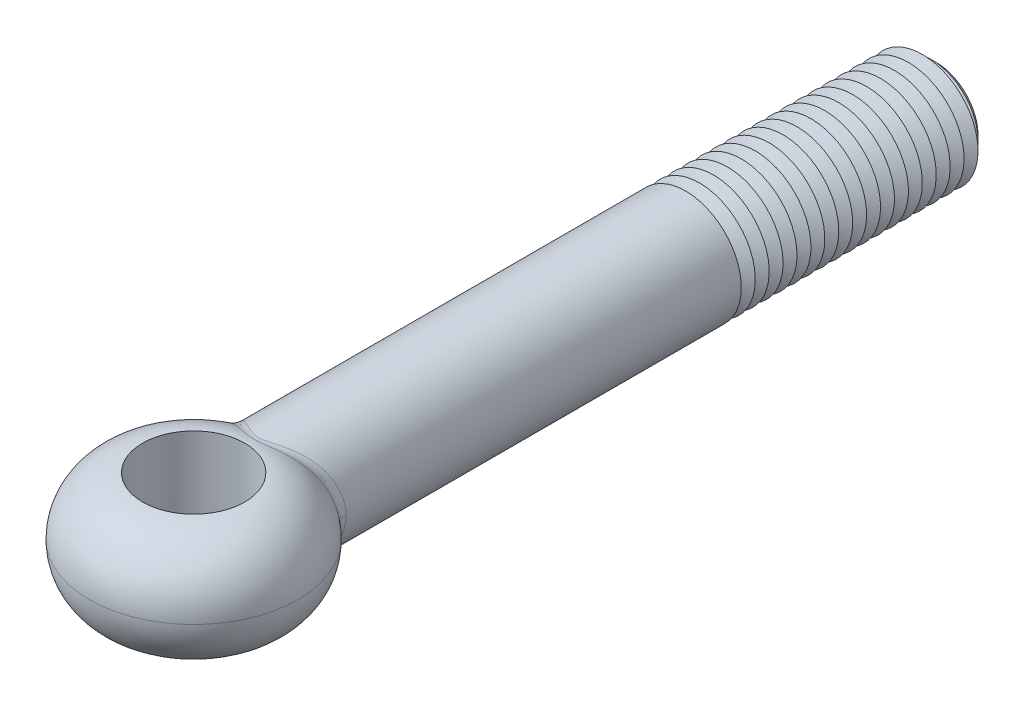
ISO-10303-21;
HEADER;
FILE_DESCRIPTION(('STEP AP214'),'2;1');
FILE_NAME('part.step','',(''),(''),'','','');
FILE_SCHEMA(('AUTOMOTIVE_DESIGN { 1 0 10303 214 1 1 1 1 }'));
ENDSEC;
DATA;
#1=APPLICATION_CONTEXT('core data for automotive mechanical design processes');
#2=APPLICATION_PROTOCOL_DEFINITION('international standard','automotive_design',2000,#1);
#3=PRODUCT_CONTEXT('',#1,'mechanical');
#4=PRODUCT('Part','Part','',(#3));
#5=PRODUCT_RELATED_PRODUCT_CATEGORY('part','',(#4));
#6=PRODUCT_DEFINITION_FORMATION('','',#4);
#7=PRODUCT_DEFINITION_CONTEXT('part definition',#1,'design');
#8=PRODUCT_DEFINITION('design','',#6,#7);
#9=PRODUCT_DEFINITION_SHAPE('','',#8);
#10=(LENGTH_UNIT() NAMED_UNIT(*) SI_UNIT(.MILLI.,.METRE.));
#11=(NAMED_UNIT(*) PLANE_ANGLE_UNIT() SI_UNIT($,.RADIAN.));
#12=(NAMED_UNIT(*) SI_UNIT($,.STERADIAN.) SOLID_ANGLE_UNIT());
#13=UNCERTAINTY_MEASURE_WITH_UNIT(LENGTH_MEASURE(1.E-05),#10,'distance_accuracy_value','');
#14=(GEOMETRIC_REPRESENTATION_CONTEXT(3) GLOBAL_UNCERTAINTY_ASSIGNED_CONTEXT((#13)) GLOBAL_UNIT_ASSIGNED_CONTEXT((#10,
#11,#12)) REPRESENTATION_CONTEXT('',''));
#15=CARTESIAN_POINT('',(0.,0.,0.));
#16=DIRECTION('',(0.,0.,1.));
#17=DIRECTION('',(1.,0.,0.));
#18=AXIS2_PLACEMENT_3D('',#15,#16,#17);
#19=CARTESIAN_POINT('',(0.,0.,-160.));
#20=DIRECTION('',(0.,0.,1.));
#21=DIRECTION('',(1.,0.,0.));
#22=AXIS2_PLACEMENT_3D('',#19,#20,#21);
#23=CYLINDRICAL_SURFACE('',#22,12.);
#24=CARTESIAN_POINT('',(0.,0.,-106.));
#25=DIRECTION('',(0.,0.,-1.));
#26=DIRECTION('',(-1.,0.,0.));
#27=AXIS2_PLACEMENT_3D('',#24,#25,#26);
#28=CIRCLE('',#27,12.);
#29=CARTESIAN_POINT('',(-12.,0.,-106.));
#30=VERTEX_POINT('',#29);
#31=EDGE_CURVE('E79',#30,#30,#28,.T.);
#32=ORIENTED_EDGE('',*,*,#31,.F.);
#33=EDGE_LOOP('',(#32));
#34=FACE_BOUND('',#33,.T.);
#35=CARTESIAN_POINT('',(11.0668506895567,-7.00530357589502,-17.0807480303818));
#36=CARTESIAN_POINT('',(10.0234990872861,-6.61021541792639,-18.0753053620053));
#37=CARTESIAN_POINT('',(9.78816741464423,-6.94202986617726,-19.5134777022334));
#38=CARTESIAN_POINT('',(11.2556958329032,-6.75368020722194,-17.1613260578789));
#39=CARTESIAN_POINT('',(10.1869276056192,-6.36184091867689,-18.1624978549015));
#40=CARTESIAN_POINT('',(9.96506204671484,-6.69267922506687,-19.6251962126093));
#41=CARTESIAN_POINT('',(11.4348613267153,-6.49403242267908,-17.2374483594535));
#42=CARTESIAN_POINT('',(10.3406855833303,-6.10798315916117,-18.2442158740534));
#43=CARTESIAN_POINT('',(10.1331767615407,-6.43537664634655,-19.7306806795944));
#44=CARTESIAN_POINT('',(11.7724527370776,-5.96016922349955,-17.3803783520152));
#45=CARTESIAN_POINT('',(10.6291362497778,-5.58941231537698,-18.3970469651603));
#46=CARTESIAN_POINT('',(10.4503638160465,-5.90633543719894,-19.9286565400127));
#47=CARTESIAN_POINT('',(11.9308725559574,-5.68594955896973,-17.447183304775));
#48=CARTESIAN_POINT('',(10.7636860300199,-5.32475984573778,-18.4680821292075));
#49=CARTESIAN_POINT('',(10.599430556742,-5.63459259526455,-20.0211441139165));
#50=CARTESIAN_POINT('',(12.225543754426,-5.12445153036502,-17.5710545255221));
#51=CARTESIAN_POINT('',(11.0129539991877,-4.78607036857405,-18.599336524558));
#52=CARTESIAN_POINT('',(10.8769937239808,-5.07816616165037,-20.1925721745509));
#53=CARTESIAN_POINT('',(12.3617854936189,-4.83716755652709,-17.6281165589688));
#54=CARTESIAN_POINT('',(11.1275308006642,-4.51212660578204,-18.659479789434));
#55=CARTESIAN_POINT('',(11.0054812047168,-4.79347701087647,-20.2715067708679));
#56=CARTESIAN_POINT('',(12.6107207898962,-4.25153049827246,-17.7321011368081));
#57=CARTESIAN_POINT('',(11.3361661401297,-3.95652222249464,-18.7687597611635));
#58=CARTESIAN_POINT('',(11.2404406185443,-4.21312957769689,-20.4153048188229));
#59=CARTESIAN_POINT('',(12.7234175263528,-3.9531789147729,-17.7790250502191));
#60=CARTESIAN_POINT('',(11.4301063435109,-3.67499018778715,-18.817833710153));
#61=CARTESIAN_POINT('',(11.346915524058,-3.9174727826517,-20.4801701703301));
#62=CARTESIAN_POINT('',(12.9208093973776,-3.35755003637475,-17.8610404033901));
#63=CARTESIAN_POINT('',(11.5941985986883,-3.1152907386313,-18.9034123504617));
#64=CARTESIAN_POINT('',(11.5335233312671,-3.32722377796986,-20.5935163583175));
#65=CARTESIAN_POINT('',(13.0063157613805,-3.06057125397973,-17.8964754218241));
#66=CARTESIAN_POINT('',(11.6649530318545,-2.83744567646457,-18.9402361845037));
#67=CARTESIAN_POINT('',(11.6144188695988,-3.03292738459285,-20.6424730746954));
#68=CARTESIAN_POINT('',(13.1535247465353,-2.46001547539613,-17.9573899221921));
#69=CARTESIAN_POINT('',(11.7865473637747,-2.27727686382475,-19.0034467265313));
#70=CARTESIAN_POINT('',(11.7537472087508,-2.43779598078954,-20.7266175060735));
#71=CARTESIAN_POINT('',(13.2152195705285,-2.15643635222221,-17.9828661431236));
#72=CARTESIAN_POINT('',(11.8373061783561,-1.99511197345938,-19.0297910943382));
#73=CARTESIAN_POINT('',(11.81217265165,-2.13695886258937,-20.7618007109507));
#74=CARTESIAN_POINT('',(13.3141154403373,-1.54515492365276,-18.0236671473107));
#75=CARTESIAN_POINT('',(11.9186021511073,-1.42805602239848,-19.0719556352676));
#76=CARTESIAN_POINT('',(11.9058504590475,-1.53119868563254,-20.8181418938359));
#77=CARTESIAN_POINT('',(13.351338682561,-1.237456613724,-18.0390011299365));
#78=CARTESIAN_POINT('',(11.9491061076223,-1.14334206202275,-19.0877585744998));
#79=CARTESIAN_POINT('',(11.9411238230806,-1.22627958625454,-20.8393125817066));
#80=CARTESIAN_POINT('',(13.4010119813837,-0.61983984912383,-18.0594576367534));
#81=CARTESIAN_POINT('',(11.989818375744,-0.572328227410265,-19.1088452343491));
#82=CARTESIAN_POINT('',(11.9881988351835,-0.614241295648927,-20.867554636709));
#83=CARTESIAN_POINT('',(13.4134617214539,-0.309921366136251,-18.0645800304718));
#84=CARTESIAN_POINT('',(12.0000000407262,-0.286212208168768,-19.1141151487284));
#85=CARTESIAN_POINT('',(12.0000001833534,-0.307122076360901,-20.8746258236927));
#86=CARTESIAN_POINT('',(13.4134613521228,0.315589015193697,-18.0645799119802));
#87=CARTESIAN_POINT('',(11.999999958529,0.291446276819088,-19.1141151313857));
#88=CARTESIAN_POINT('',(11.9999998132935,0.312738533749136,-20.8746256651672));
#89=CARTESIAN_POINT('',(13.4005517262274,0.63118101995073,-18.0592683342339));
#90=CARTESIAN_POINT('',(11.9894424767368,0.582796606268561,-19.1086507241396));
#91=CARTESIAN_POINT('',(11.9877625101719,0.625480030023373,-20.8672933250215));
#92=CARTESIAN_POINT('',(13.3490459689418,1.26003314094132,-18.0380566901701));
#93=CARTESIAN_POINT('',(11.9472266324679,1.16422234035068,-19.0867849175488));
#94=CARTESIAN_POINT('',(11.9389511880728,1.24865219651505,-20.8380086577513));
#95=CARTESIAN_POINT('',(13.3104489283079,1.57329317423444,-18.0221562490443));
#96=CARTESIAN_POINT('',(11.9155958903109,1.45410364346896,-19.0703978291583));
#97=CARTESIAN_POINT('',(11.902376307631,1.55908278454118,-20.8160558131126));
#98=CARTESIAN_POINT('',(13.2079559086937,2.19523221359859,-17.9798674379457));
#99=CARTESIAN_POINT('',(11.8313307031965,2.03114104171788,-19.0266903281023));
#100=CARTESIAN_POINT('',(11.8052934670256,2.17540431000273,-20.757659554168));
#101=CARTESIAN_POINT('',(13.1440553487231,2.50391037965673,-17.9534771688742));
#102=CARTESIAN_POINT('',(11.778747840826,2.31811265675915,-18.9993967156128));
#103=CARTESIAN_POINT('',(11.7447811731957,2.48129441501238,-20.7212135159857));
#104=CARTESIAN_POINT('',(12.9915746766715,3.11452894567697,-17.890369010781));
#105=CARTESIAN_POINT('',(11.6527601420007,2.88786980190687,-18.9338924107));
#106=CARTESIAN_POINT('',(11.6004711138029,3.08639771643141,-20.6340369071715));
#107=CARTESIAN_POINT('',(12.9029856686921,3.41646687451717,-17.8536473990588));
#108=CARTESIAN_POINT('',(11.5794275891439,3.17048606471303,-18.8957194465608));
#109=CARTESIAN_POINT('',(11.5166649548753,3.38560846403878,-20.5833011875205));
#110=CARTESIAN_POINT('',(12.7022190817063,4.01079458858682,-17.7702015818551));
#111=CARTESIAN_POINT('',(11.4124346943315,3.72932815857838,-18.8086044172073));
#112=CARTESIAN_POINT('',(11.3268856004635,3.97456805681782,-20.4679735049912));
#113=CARTESIAN_POINT('',(12.5900903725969,4.30320272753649,-17.7234980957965));
#114=CARTESIAN_POINT('',(11.3189167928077,4.00541898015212,-18.7597374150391));
#115=CARTESIAN_POINT('',(11.2209583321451,4.26433508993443,-20.4034102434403));
#116=CARTESIAN_POINT('',(12.3431556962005,4.87731134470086,-17.6203174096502));
#117=CARTESIAN_POINT('',(11.1118629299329,4.55038551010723,-18.6512584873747));
#118=CARTESIAN_POINT('',(10.9879091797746,4.83325821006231,-20.260718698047));
#119=CARTESIAN_POINT('',(12.2083417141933,5.15900799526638,-17.5638367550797));
#120=CARTESIAN_POINT('',(10.9984353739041,4.81913932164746,-18.5917040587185));
#121=CARTESIAN_POINT('',(10.8607798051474,5.11241050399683,-20.1825856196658));
#122=CARTESIAN_POINT('',(11.9173359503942,5.70976821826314,-17.4414779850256));
#123=CARTESIAN_POINT('',(10.7521869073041,5.34773597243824,-18.462013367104));
#124=CARTESIAN_POINT('',(10.5866916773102,5.65819611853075,-20.0132458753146));
#125=CARTESIAN_POINT('',(11.7611511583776,5.97883588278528,-17.375602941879));
#126=CARTESIAN_POINT('',(10.6194983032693,5.60749077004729,-18.391948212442));
#127=CARTESIAN_POINT('',(10.4397394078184,5.92483349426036,-19.9220434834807));
#128=CARTESIAN_POINT('',(11.4287046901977,6.5029302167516,-17.2348317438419));
#129=CARTESIAN_POINT('',(10.3353872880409,6.11671914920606,-18.2414005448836));
#130=CARTESIAN_POINT('',(10.1273983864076,6.44419407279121,-19.7270547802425));
#131=CARTESIAN_POINT('',(11.2524417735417,6.75795601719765,-17.1599350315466));
#132=CARTESIAN_POINT('',(10.1840940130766,6.36613220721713,-18.1609883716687));
#133=CARTESIAN_POINT('',(9.96200849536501,6.69691641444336,-19.6232676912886));
#134=CARTESIAN_POINT('',(10.8755162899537,7.26030557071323,-16.999110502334));
#135=CARTESIAN_POINT('',(9.85865758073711,6.86075287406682,-17.9873566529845));
#136=CARTESIAN_POINT('',(9.6089466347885,7.19472861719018,-19.4002901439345));
#137=CARTESIAN_POINT('',(10.6742674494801,7.50714674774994,-16.9129130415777));
#138=CARTESIAN_POINT('',(9.684069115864,7.10559423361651,-17.8938830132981));
#139=CARTESIAN_POINT('',(9.42074350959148,7.43934026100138,-19.2807224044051));
#140=CARTESIAN_POINT('',(10.2535888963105,7.98325367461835,-16.7319589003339));
#141=CARTESIAN_POINT('',(9.31692741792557,7.58129738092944,-17.6964993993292));
#142=CARTESIAN_POINT('',(9.0281736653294,7.91114686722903,-19.0295700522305));
#143=CARTESIAN_POINT('',(10.0341636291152,8.21252369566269,-16.637204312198));
#144=CARTESIAN_POINT('',(9.12451201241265,7.81216456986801,-17.5926673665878));
#145=CARTESIAN_POINT('',(8.82381089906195,8.13834606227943,-18.8979883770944));
#146=CARTESIAN_POINT('',(9.57850828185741,8.65276143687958,-16.4396502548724));
#147=CARTESIAN_POINT('',(8.72267859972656,8.25878016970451,-17.3749330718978));
#148=CARTESIAN_POINT('',(8.40050866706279,8.57460746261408,-18.623492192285));
#149=CARTESIAN_POINT('',(9.34226759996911,8.86371742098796,-16.3368457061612));
#150=CARTESIAN_POINT('',(8.51336852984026,8.4745533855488,-17.2610929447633));
#151=CARTESIAN_POINT('',(8.18156001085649,8.78365803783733,-18.4805705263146));
#152=CARTESIAN_POINT('',(8.85465264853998,9.26641239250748,-16.1239505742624));
#153=CARTESIAN_POINT('',(8.07909814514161,8.88955655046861,-17.0240228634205));
#154=CARTESIAN_POINT('',(7.73099517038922,9.18271576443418,-18.1844263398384));
#155=CARTESIAN_POINT('',(8.60328194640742,9.45815588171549,-16.013861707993));
#156=CARTESIAN_POINT('',(7.85424144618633,9.08885199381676,-16.9008538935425));
#157=CARTESIAN_POINT('',(7.49938197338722,9.37272737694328,-18.0312062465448));
#158=CARTESIAN_POINT('',(8.06370502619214,9.838189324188,-15.7770858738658));
#159=CARTESIAN_POINT('',(7.36948144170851,9.48676203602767,-16.6345956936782));
#160=CARTESIAN_POINT('',(7.00398623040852,9.74932825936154,-17.7014858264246));
#161=CARTESIAN_POINT('',(7.77421051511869,10.0246580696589,-15.6497932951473));
#162=CARTESIAN_POINT('',(7.10821519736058,9.68394461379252,-16.4906997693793));
#163=CARTESIAN_POINT('',(6.73917402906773,9.93411277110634,-17.5241266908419));
#164=CARTESIAN_POINT('',(7.18020960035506,10.3739440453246,-15.3887823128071));
#165=CARTESIAN_POINT('',(6.56993984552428,10.0563267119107,-16.1940603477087));
#166=CARTESIAN_POINT('',(6.1983598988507,10.2802439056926,-17.1602711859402));
#167=CARTESIAN_POINT('',(6.8757060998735,10.5367658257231,-15.2550651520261));
#168=CARTESIAN_POINT('',(6.29299233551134,10.2316662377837,-16.0413517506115));
#169=CARTESIAN_POINT('',(5.92236013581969,10.4415950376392,-16.9737765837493));
#170=CARTESIAN_POINT('',(6.25253303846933,10.8386647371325,-14.9829888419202));
#171=CARTESIAN_POINT('',(5.72450599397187,10.559425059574,-15.7291507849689));
#172=CARTESIAN_POINT('',(5.36070387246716,10.7407671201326,-16.5941767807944));
#173=CARTESIAN_POINT('',(5.93386874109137,10.9777505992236,-14.8446314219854));
#174=CARTESIAN_POINT('',(5.432987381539,10.7120059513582,-15.5696627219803));
#175=CARTESIAN_POINT('',(5.07505096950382,10.8785967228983,-16.4010740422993));
#176=CARTESIAN_POINT('',(5.28221556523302,11.2323272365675,-14.5658439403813));
#177=CARTESIAN_POINT('',(4.83577895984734,10.9935431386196,-15.2469866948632));
#178=CARTESIAN_POINT('',(4.49486022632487,11.1308739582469,-16.0119192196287));
#179=CARTESIAN_POINT('',(4.94923070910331,11.3478245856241,-14.4254144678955));
#180=CARTESIAN_POINT('',(4.53005970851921,11.1226685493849,-15.0837625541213));
#181=CARTESIAN_POINT('',(4.20032488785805,11.2453281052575,-15.8158679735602));
#182=CARTESIAN_POINT('',(4.418859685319,11.5092496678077,-14.2088988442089));
#183=CARTESIAN_POINT('',(4.04244425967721,11.3047506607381,-14.8310562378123));
#184=CARTESIAN_POINT('',(3.73498180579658,11.4052951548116,-15.5136345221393));
#185=CARTESIAN_POINT('',(4.22698520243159,11.5632823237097,-14.1319559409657));
#186=CARTESIAN_POINT('',(3.86615136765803,11.3659940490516,-14.7411592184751));
#187=CARTESIAN_POINT('',(3.56736640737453,11.4588397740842,-15.4062382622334));
#188=CARTESIAN_POINT('',(3.83770554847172,11.6641157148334,-13.9800981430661));
#189=CARTESIAN_POINT('',(3.50855117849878,11.4808212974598,-14.563464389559));
#190=CARTESIAN_POINT('',(3.22895536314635,11.5587624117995,-15.1943126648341));
#191=CARTESIAN_POINT('',(3.64030104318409,11.7109173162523,-13.9051830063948));
#192=CARTESIAN_POINT('',(3.32722277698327,11.5344340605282,-14.4756451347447));
#193=CARTESIAN_POINT('',(3.058160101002,11.6051412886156,-15.0897829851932));
#194=CARTESIAN_POINT('',(3.23881755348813,11.7973007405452,-13.7590320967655));
#195=CARTESIAN_POINT('',(2.9586556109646,11.6338410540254,-14.3041084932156));
#196=CARTESIAN_POINT('',(2.7126029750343,11.6907444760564,-14.8859114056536));
#197=CARTESIAN_POINT('',(3.034729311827,11.8368720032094,-13.6878018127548));
#198=CARTESIAN_POINT('',(2.7713784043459,11.6796514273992,-14.2203690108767));
#199=CARTESIAN_POINT('',(2.53783572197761,11.729958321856,-14.7865772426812));
#200=CARTESIAN_POINT('',(2.61924941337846,11.9085316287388,-13.5518208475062));
#201=CARTESIAN_POINT('',(2.39049286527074,11.7629647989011,-14.0603637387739));
#202=CARTESIAN_POINT('',(2.18396259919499,11.8009706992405,-14.5970091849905));
#203=CARTESIAN_POINT('',(2.40785949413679,11.9406217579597,-13.487068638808));
#204=CARTESIAN_POINT('',(2.19684547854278,11.8004961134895,-13.9840608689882));
#205=CARTESIAN_POINT('',(2.00485776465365,11.8327709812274,-14.5067731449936));
#206=CARTESIAN_POINT('',(1.88979300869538,12.0083312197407,-13.3438479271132));
#207=CARTESIAN_POINT('',(1.72298962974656,11.8799550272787,-13.8152500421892));
#208=CARTESIAN_POINT('',(1.56826217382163,11.8998688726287,-14.307262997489));
#209=CARTESIAN_POINT('',(1.57889083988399,12.0402078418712,-13.2702876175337));
#210=CARTESIAN_POINT('',(1.4388724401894,11.9177031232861,-13.728341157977));
#211=CARTESIAN_POINT('',(1.30813242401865,11.9314575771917,-14.2048593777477));
#212=CARTESIAN_POINT('',(1.1016812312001,12.0751548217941,-13.186477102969));
#213=CARTESIAN_POINT('',(1.00343635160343,11.9592039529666,-13.6293092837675));
#214=CARTESIAN_POINT('',(0.911154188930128,11.9660889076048,-14.08823090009));
#215=CARTESIAN_POINT('',(0.941325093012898,12.0846492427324,-13.1629946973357));
#216=CARTESIAN_POINT('',(0.857250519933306,11.9705082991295,-13.6015536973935));
#217=CARTESIAN_POINT('',(0.778128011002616,11.9754975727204,-14.0555630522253));
#218=CARTESIAN_POINT('',(0.617680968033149,12.0991842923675,-13.1266072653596));
#219=CARTESIAN_POINT('',(0.562389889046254,11.9878287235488,-13.5585487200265));
#220=CARTESIAN_POINT('',(0.510147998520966,11.9899013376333,-14.0049481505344));
#221=CARTESIAN_POINT('',(0.454393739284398,12.104226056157,-13.1136995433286));
#222=CARTESIAN_POINT('',(0.413680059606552,11.9938505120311,-13.5432855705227));
#223=CARTESIAN_POINT('',(0.375194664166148,11.994897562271,-13.986997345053));
#224=CARTESIAN_POINT('',(0.124773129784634,12.1097166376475,-13.0996281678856));
#225=CARTESIAN_POINT('',(0.113587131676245,12.0004071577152,-13.5266507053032));
#226=CARTESIAN_POINT('',(0.102974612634,12.0003385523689,-13.9674284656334));
#227=CARTESIAN_POINT('',(-0.0415739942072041,12.1101142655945,-13.0985954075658));
#228=CARTESIAN_POINT('',(-0.0378485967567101,12.0008826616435,-13.5254292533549));
#229=CARTESIAN_POINT('',(-0.0343012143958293,12.0007325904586,-13.9659924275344));
#230=CARTESIAN_POINT('',(-0.373368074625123,12.1061686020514,-13.1087272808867));
#231=CARTESIAN_POINT('',(-0.33990308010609,11.9961701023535,-13.5374072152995));
#232=CARTESIAN_POINT('',(-0.308257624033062,11.9968225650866,-13.9800824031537));
#233=CARTESIAN_POINT('',(-0.538814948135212,12.1018248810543,-13.1198930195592));
#234=CARTESIAN_POINT('',(-0.490563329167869,11.9909802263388,-13.5506112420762));
#235=CARTESIAN_POINT('',(-0.444938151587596,11.9925180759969,-13.9956099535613));
#236=CARTESIAN_POINT('',(-0.867965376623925,12.0885089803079,-13.153394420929));
#237=CARTESIAN_POINT('',(-0.790396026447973,11.9751052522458,-13.5902076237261));
#238=CARTESIAN_POINT('',(-0.717328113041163,11.979322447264,-14.0422082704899));
#239=CARTESIAN_POINT('',(-1.03165081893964,12.0795071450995,-13.1758016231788));
#240=CARTESIAN_POINT('',(-0.939590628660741,11.9643807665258,-13.6166946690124));
#241=CARTESIAN_POINT('',(-0.853025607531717,11.9704019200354,-14.0733785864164));
#242=CARTESIAN_POINT('',(-1.35507829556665,12.0571088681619,-13.2299063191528));
#243=CARTESIAN_POINT('',(-1.23455248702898,11.937774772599,-13.6806107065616));
#244=CARTESIAN_POINT('',(-1.12186617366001,11.9482059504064,-14.148663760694));
#245=CARTESIAN_POINT('',(-1.51481934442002,12.0437113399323,-13.2616061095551));
#246=CARTESIAN_POINT('',(-1.38035112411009,11.9218856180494,-13.7180567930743));
#247=CARTESIAN_POINT('',(-1.25500860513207,11.9349294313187,-14.1927818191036));
#248=CARTESIAN_POINT('',(-1.84495456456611,12.011300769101,-13.3355882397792));
#249=CARTESIAN_POINT('',(-1.68188899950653,11.8835783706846,-13.8053908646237));
#250=CARTESIAN_POINT('',(-1.53107532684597,11.9028116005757,-14.2957778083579));
#251=CARTESIAN_POINT('',(-2.01491382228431,11.9918743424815,-13.3785910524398));
#252=CARTESIAN_POINT('',(-1.83727107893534,11.8606743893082,-13.8561401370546));
#253=CARTESIAN_POINT('',(-1.67372311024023,11.8835606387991,-14.3556614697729));
#254=CARTESIAN_POINT('',(-2.34982544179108,11.9483049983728,-13.4708803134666));
#255=CARTESIAN_POINT('',(-2.14368396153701,11.8095216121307,-13.9649543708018));
#256=CARTESIAN_POINT('',(-1.95593412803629,11.8403848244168,-14.484221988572));
#257=CARTESIAN_POINT('',(-2.51477537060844,11.9241598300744,-13.520169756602));
#258=CARTESIAN_POINT('',(-2.29473884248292,11.7812588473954,-14.0230424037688));
#259=CARTESIAN_POINT('',(-2.09549585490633,11.8164577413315,-14.5529030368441));
#260=CARTESIAN_POINT('',(-2.84030915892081,11.8712884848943,-13.6232162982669));
#261=CARTESIAN_POINT('',(-2.59304039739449,11.7196429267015,-14.1443586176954));
#262=CARTESIAN_POINT('',(-2.37205348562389,11.7640639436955,-14.6965334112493));
#263=CARTESIAN_POINT('',(-3.00088551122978,11.8425549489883,-13.6769805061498));
#264=CARTESIAN_POINT('',(-2.74030070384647,11.6862694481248,-14.2076122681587));
#265=CARTESIAN_POINT('',(-2.50904486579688,11.7355899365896,-14.7714927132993));
#266=CARTESIAN_POINT('',(-3.31787265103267,11.7806424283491,-13.7874770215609));
#267=CARTESIAN_POINT('',(-3.03113701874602,11.6146813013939,-14.3374619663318));
#268=CARTESIAN_POINT('',(-2.7805695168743,11.6742366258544,-14.9255877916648));
#269=CARTESIAN_POINT('',(-3.47428412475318,11.7474641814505,-13.8442088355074));
#270=CARTESIAN_POINT('',(-3.17472979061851,11.5764547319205,-14.404072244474));
#271=CARTESIAN_POINT('',(-2.91510319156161,11.6413580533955,-15.0047228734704));
#272=CARTESIAN_POINT('',(-3.78404739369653,11.67656761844,-13.9598300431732));
#273=CARTESIAN_POINT('',(-3.45918061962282,11.4951374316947,-14.5396537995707));
#274=CARTESIAN_POINT('',(-3.18257716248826,11.5711018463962,-15.1660331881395));
#275=CARTESIAN_POINT('',(-3.93738431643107,11.6388315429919,-14.0187272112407));
#276=CARTESIAN_POINT('',(-3.60003721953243,11.4520148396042,-14.6086453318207));
#277=CARTESIAN_POINT('',(-3.31550885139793,11.5337066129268,-15.2482193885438));
#278=CARTESIAN_POINT('',(-4.24071273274,11.5589459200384,-14.1376822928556));
#279=CARTESIAN_POINT('',(-3.87868653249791,11.3611356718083,-14.7477942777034));
#280=CARTESIAN_POINT('',(-3.57944589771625,11.4545425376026,-15.4142328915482));
#281=CARTESIAN_POINT('',(-4.39070396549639,11.5167960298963,-14.1977402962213));
#282=CARTESIAN_POINT('',(-4.01648905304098,11.3133653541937,-14.8179616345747));
#283=CARTESIAN_POINT('',(-3.7104511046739,11.4127733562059,-15.4980603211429));
#284=CARTESIAN_POINT('',(-4.8357946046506,11.3838162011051,-14.3786158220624));
#285=CARTESIAN_POINT('',(-4.4257108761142,11.1631818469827,-15.0291599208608));
#286=CARTESIAN_POINT('',(-4.10054896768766,11.2809946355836,-15.750538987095));
#287=CARTESIAN_POINT('',(-5.12633926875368,11.2863806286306,-14.500260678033));
#288=CARTESIAN_POINT('',(-4.69251664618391,11.0540121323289,-15.170680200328));
#289=CARTESIAN_POINT('',(-4.35700776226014,11.1844391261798,-15.9203621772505));
#290=CARTESIAN_POINT('',(-5.71340475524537,11.0674990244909,-14.7497300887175));
#291=CARTESIAN_POINT('',(-5.23094469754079,10.811014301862,-15.4599151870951));
#292=CARTESIAN_POINT('',(-4.87826833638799,10.9675345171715,-16.2686079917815));
#293=CARTESIAN_POINT('',(-6.00925252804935,10.9449693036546,-14.8774916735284));
#294=CARTESIAN_POINT('',(-5.50187190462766,10.6760136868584,-15.6074949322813));
#295=CARTESIAN_POINT('',(-5.14265857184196,10.8461115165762,-16.446941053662));
#296=CARTESIAN_POINT('',(-6.58901820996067,10.6799255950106,-15.1296175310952));
#297=CARTESIAN_POINT('',(-6.0315628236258,10.3867756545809,-15.8975382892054));
#298=CARTESIAN_POINT('',(-5.66351510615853,10.5834617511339,-16.7987693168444));
#299=CARTESIAN_POINT('',(-6.87293369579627,10.5374075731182,-15.2539811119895));
#300=CARTESIAN_POINT('',(-6.29032294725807,10.2324127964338,-16.0400075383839));
#301=CARTESIAN_POINT('',(-5.91997979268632,10.4422309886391,-16.9722635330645));
#302=CARTESIAN_POINT('',(-7.42781601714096,10.2327138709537,-15.4975137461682));
#303=CARTESIAN_POINT('',(-6.79447470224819,9.90543645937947,-16.3177763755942));
#304=CARTESIAN_POINT('',(-6.42343369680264,10.1402893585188,-17.3118682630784));
#305=CARTESIAN_POINT('',(-7.69880705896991,10.0705771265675,-15.6166924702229));
#306=CARTESIAN_POINT('',(-7.03986086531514,9.7327471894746,-16.4530735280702));
#307=CARTESIAN_POINT('',(-6.67044044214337,9.97961707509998,-17.4779925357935));
#308=CARTESIAN_POINT('',(-8.22752602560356,9.72661338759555,-15.8490032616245));
#309=CARTESIAN_POINT('',(-7.516849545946,9.3696549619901,-16.7156042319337));
#310=CARTESIAN_POINT('',(-7.15414912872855,9.63876010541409,-17.8016554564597));
#311=CARTESIAN_POINT('',(-8.48525397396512,9.54478642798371,-15.9621353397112));
#312=CARTESIAN_POINT('',(-7.74838988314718,9.17915766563,-16.8428011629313));
#313=CARTESIAN_POINT('',(-7.39085108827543,9.45857545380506,-17.9591941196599));
#314=CARTESIAN_POINT('',(-9.04166371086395,9.11943479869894,-16.2057439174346));
#315=CARTESIAN_POINT('',(-8.24643700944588,8.73712339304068,-17.1155654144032));
#316=CARTESIAN_POINT('',(-7.90344846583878,9.03706571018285,-18.2982438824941));
#317=CARTESIAN_POINT('',(-9.33680953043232,8.87115530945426,-16.3345284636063));
#318=CARTESIAN_POINT('',(-8.5088809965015,8.48157779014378,-17.2587098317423));
#319=CARTESIAN_POINT('',(-8.17644570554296,8.79102874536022,-18.4773591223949));
#320=CARTESIAN_POINT('',(-9.90300273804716,8.34681842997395,-16.5805049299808));
#321=CARTESIAN_POINT('',(-9.00956487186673,7.94739974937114,-17.5305747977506));
#322=CARTESIAN_POINT('',(-8.7017229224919,8.27142781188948,-18.8192409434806));
#323=CARTESIAN_POINT('',(-10.1740457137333,8.07075597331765,-16.6976947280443));
#324=CARTESIAN_POINT('',(-9.24759259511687,7.66868796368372,-17.6591721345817));
#325=CARTESIAN_POINT('',(-8.95399910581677,7.99785882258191,-18.9820045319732));
#326=CARTESIAN_POINT('',(-10.6893747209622,7.49227394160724,-16.9194545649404));
#327=CARTESIAN_POINT('',(-9.69758548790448,7.09025247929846,-17.9011953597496));
#328=CARTESIAN_POINT('',(-9.43479391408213,7.4246017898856,-19.2898096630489));
#329=CARTESIAN_POINT('',(-10.9336387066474,7.18983301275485,-17.0240142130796));
#330=CARTESIAN_POINT('',(-9.90928717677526,6.79050605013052,-18.0144718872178));
#331=CARTESIAN_POINT('',(-9.66329295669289,7.1248925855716,-19.434836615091));
#332=CARTESIAN_POINT('',(-11.3922237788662,6.56101137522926,-17.219416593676));
#333=CARTESIAN_POINT('',(-10.3045410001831,6.17279493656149,-18.2250928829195));
#334=CARTESIAN_POINT('',(-10.0930881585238,6.50175062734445,-19.705708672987));
#335=CARTESIAN_POINT('',(-11.6065510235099,6.23463561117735,-17.31026214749));
#336=CARTESIAN_POINT('',(-10.4878412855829,5.85490191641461,-18.3222983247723));
#337=CARTESIAN_POINT('',(-10.2943899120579,6.1783227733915,-19.8315577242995));
#338=CARTESIAN_POINT('',(-11.9788069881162,5.60102165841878,-17.4673989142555));
#339=CARTESIAN_POINT('',(-10.8045077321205,5.24277677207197,-18.4896383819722));
#340=CARTESIAN_POINT('',(-10.6445307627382,5.55043178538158,-20.0491319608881));
#341=CARTESIAN_POINT('',(-12.1404155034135,5.29616663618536,-17.535327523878));
#342=CARTESIAN_POINT('',(-10.9411166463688,4.95021714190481,-18.5615610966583));
#343=CARTESIAN_POINT('',(-10.7967651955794,5.24833029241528,-20.1431384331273));
#344=CARTESIAN_POINT('',(-12.4365532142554,4.67222519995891,-17.6594117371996));
#345=CARTESIAN_POINT('',(-11.1904485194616,4.35503313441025,-18.6924913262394));
#346=CARTESIAN_POINT('',(-11.0760057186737,4.63002445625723,-20.3147946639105));
#347=CARTESIAN_POINT('',(-12.5710856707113,4.3531405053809,-17.7155687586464));
#348=CARTESIAN_POINT('',(-11.3030104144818,4.05255416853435,-18.7514129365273));
#349=CARTESIAN_POINT('',(-11.2030148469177,4.31382181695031,-20.3924463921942));
#350=CARTESIAN_POINT('',(-12.8113072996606,3.70386059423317,-17.8155899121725));
#351=CARTESIAN_POINT('',(-11.5033629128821,3.44010607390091,-18.8560787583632));
#352=CARTESIAN_POINT('',(-11.4299721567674,3.67040636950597,-20.5307108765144));
#353=CARTESIAN_POINT('',(-12.9170534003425,3.37368877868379,-17.8594783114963));
#354=CARTESIAN_POINT('',(-11.5910600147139,3.13033564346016,-18.9017738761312));
#355=CARTESIAN_POINT('',(-11.5299737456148,3.34321675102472,-20.591357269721));
#356=CARTESIAN_POINT('',(-13.0987625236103,2.7045032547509,-17.9347558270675));
#357=CARTESIAN_POINT('',(-11.7414276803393,2.50483422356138,-18.9800127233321));
#358=CARTESIAN_POINT('',(-11.7018998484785,2.68007548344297,-20.6953560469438));
#359=CARTESIAN_POINT('',(-13.1747386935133,2.36549352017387,-17.966150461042));
#360=CARTESIAN_POINT('',(-11.8039950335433,2.18932374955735,-19.0125025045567));
#361=CARTESIAN_POINT('',(-11.7738367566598,2.34412777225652,-20.7387160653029));
#362=CARTESIAN_POINT('',(-13.2945218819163,1.69001403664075,-18.0155922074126));
#363=CARTESIAN_POINT('',(-11.9025350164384,1.56217664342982,-19.0636291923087));
#364=CARTESIAN_POINT('',(-11.8872853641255,1.67474939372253,-20.8069927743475));
#365=CARTESIAN_POINT('',(-13.3390876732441,1.35369370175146,-18.0339542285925));
#366=CARTESIAN_POINT('',(-11.9390623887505,1.25085799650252,-19.0825551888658));
#367=CARTESIAN_POINT('',(-11.9295146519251,1.34146679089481,-20.8323446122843));
#368=CARTESIAN_POINT('',(-13.3985522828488,0.678243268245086,-18.0584460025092));
#369=CARTESIAN_POINT('',(-11.9878097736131,0.62623517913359,-19.1078059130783));
#370=CARTESIAN_POINT('',(-11.9858669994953,0.672117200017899,-20.8661581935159));
#371=CARTESIAN_POINT('',(-13.4134605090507,0.339114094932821,-18.0645796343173));
#372=CARTESIAN_POINT('',(-11.9999997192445,0.313171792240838,-19.1141150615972));
#373=CARTESIAN_POINT('',(-11.99999897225,0.336051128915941,-20.8746252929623));
#374=CARTESIAN_POINT('',(-13.4134624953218,-0.315214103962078,-18.0645802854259));
#375=CARTESIAN_POINT('',(-12.0000002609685,-0.291100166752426,-19.1141152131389));
#376=CARTESIAN_POINT('',(-12.0000009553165,-0.312367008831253,-20.8746261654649));
#377=CARTESIAN_POINT('',(-13.4005834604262,-0.630415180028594,-18.0592813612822));
#378=CARTESIAN_POINT('',(-11.989468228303,-0.582089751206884,-19.1086640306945));
#379=CARTESIAN_POINT('',(-11.987792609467,-0.624721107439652,-20.8673113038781));
#380=CARTESIAN_POINT('',(-13.3491942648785,-1.25859966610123,-18.0381178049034));
#381=CARTESIAN_POINT('',(-11.9473483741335,-1.16289640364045,-19.0868480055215));
#382=CARTESIAN_POINT('',(-11.9390917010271,-1.24723166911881,-20.8380930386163));
#383=CARTESIAN_POINT('',(-13.3106752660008,-1.57158227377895,-18.0222495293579));
#384=CARTESIAN_POINT('',(-11.9157815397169,-1.45251959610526,-19.070494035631));
#385=CARTESIAN_POINT('',(-11.9025907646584,-1.55738733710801,-20.8161846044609));
#386=CARTESIAN_POINT('',(-13.2082732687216,-2.19364255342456,-17.9799984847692));
#387=CARTESIAN_POINT('',(-11.8315919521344,-2.02966309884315,-19.0268259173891));
#388=CARTESIAN_POINT('',(-11.8055940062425,-2.17382900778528,-20.7578405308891));
#389=CARTESIAN_POINT('',(-13.1443316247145,-2.50270947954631,-17.953591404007));
#390=CARTESIAN_POINT('',(-11.7789758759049,-2.31699330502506,-18.9995151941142));
#391=CARTESIAN_POINT('',(-11.7450427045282,-2.48010436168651,-20.7213713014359));
#392=CARTESIAN_POINT('',(-12.9917331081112,-3.11398878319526,-17.8904346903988));
#393=CARTESIAN_POINT('',(-11.6528914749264,-2.88736356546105,-18.9339607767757));
#394=CARTESIAN_POINT('',(-11.6006209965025,-3.08586243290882,-20.6341276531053));
#395=CARTESIAN_POINT('',(-12.9030756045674,-3.41620098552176,-17.8536847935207));
#396=CARTESIAN_POINT('',(-11.57950265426,-3.17023510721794,-18.895758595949));
#397=CARTESIAN_POINT('',(-11.5167499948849,-3.38534497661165,-20.5833528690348));
#398=CARTESIAN_POINT('',(-12.7021040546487,-4.01113475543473,-17.77015375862));
#399=CARTESIAN_POINT('',(-11.4123391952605,-3.72964749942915,-18.8085546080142));
#400=CARTESIAN_POINT('',(-11.3267768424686,-3.97490515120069,-20.4679074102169));
#401=CARTESIAN_POINT('',(-12.5898329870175,-4.30387246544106,-17.7233908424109));
#402=CARTESIAN_POINT('',(-11.3187022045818,-4.00605158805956,-18.7596253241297));
#403=CARTESIAN_POINT('',(-11.2207150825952,-4.26499877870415,-20.4032619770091));
#404=CARTESIAN_POINT('',(-12.3425923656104,-4.87854946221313,-17.6200817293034));
#405=CARTESIAN_POINT('',(-11.1113901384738,-4.55156205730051,-18.6510104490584));
#406=CARTESIAN_POINT('',(-10.9873778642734,-4.83448514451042,-20.2603927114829));
#407=CARTESIAN_POINT('',(-12.2076200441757,-5.16048742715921,-17.5635343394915));
#408=CARTESIAN_POINT('',(-10.9978285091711,-4.82054774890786,-18.5913850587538));
#409=CARTESIAN_POINT('',(-10.8600998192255,-5.11387657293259,-20.1821672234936));
#410=CARTESIAN_POINT('',(-11.9165165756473,-5.71120494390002,-17.4411324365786));
#411=CARTESIAN_POINT('',(-10.7514900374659,-5.34912610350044,-18.4616457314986));
#412=CARTESIAN_POINT('',(-10.5859202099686,-5.65961986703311,-20.0127675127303));
#413=CARTESIAN_POINT('',(-11.7604304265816,-5.98001086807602,-17.3752977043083));
#414=CARTESIAN_POINT('',(-10.6188806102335,-5.60864484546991,-18.3916220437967));
#415=CARTESIAN_POINT('',(-10.4390603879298,-5.92599786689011,-19.9216208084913));
#416=CARTESIAN_POINT('',(-11.4282849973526,-6.50355289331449,-17.2346540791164));
#417=CARTESIAN_POINT('',(-10.335029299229,-6.1173138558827,-18.2412097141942));
#418=CARTESIAN_POINT('',(-10.1270059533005,-6.44481112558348,-19.7268085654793));
#419=CARTESIAN_POINT('',(-11.2522312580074,-6.75829286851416,-17.1598476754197));
#420=CARTESIAN_POINT('',(-10.1839224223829,-6.36640726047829,-18.1608946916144));
#421=CARTESIAN_POINT('',(-9.96181642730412,-6.6972502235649,-19.6231464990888));
#422=CARTESIAN_POINT('',(-11.0668506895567,-7.00530357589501,-17.0807480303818));
#423=CARTESIAN_POINT('',(-10.0234990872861,-6.61021541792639,-18.0753053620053));
#424=CARTESIAN_POINT('',(-9.78816741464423,-6.94202986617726,-19.5134777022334));
#425=(BOUNDED_SURFACE() B_SPLINE_SURFACE(3,2,((#35,#36,#37),(#38,#39,#40),(#41,#42,#43),(#44,
#45,#46),(#47,#48,#49),(#50,#51,#52),(#53,#54,#55),(#56,#57,#58),(#59,#60,#61),(#62,#63,#64),
(#65,#66,#67),(#68,#69,#70),(#71,#72,#73),(#74,#75,#76),(#77,#78,#79),(#80,#81,#82),(#83,#84,
#85),(#86,#87,#88),(#89,#90,#91),(#92,#93,#94),(#95,#96,#97),(#98,#99,#100),(#101,#102,#103),
(#104,#105,#106),(#107,#108,#109),(#110,#111,#112),(#113,#114,#115),(#116,#117,#118),(#119,#120,
#121),(#122,#123,#124),(#125,#126,#127),(#128,#129,#130),(#131,#132,#133),(#134,#135,#136),
(#137,#138,#139),(#140,#141,#142),(#143,#144,#145),(#146,#147,#148),(#149,#150,#151),(#152,#153,
#154),(#155,#156,#157),(#158,#159,#160),(#161,#162,#163),(#164,#165,#166),(#167,#168,#169),
(#170,#171,#172),(#173,#174,#175),(#176,#177,#178),(#179,#180,#181),(#182,#183,#184),(#185,#186,
#187),(#188,#189,#190),(#191,#192,#193),(#194,#195,#196),(#197,#198,#199),(#200,#201,#202),
(#203,#204,#205),(#206,#207,#208),(#209,#210,#211),(#212,#213,#214),(#215,#216,#217),(#218,#219,
#220),(#221,#222,#223),(#224,#225,#226),(#227,#228,#229),(#230,#231,#232),(#233,#234,#235),
(#236,#237,#238),(#239,#240,#241),(#242,#243,#244),(#245,#246,#247),(#248,#249,#250),(#251,#252,
#253),(#254,#255,#256),(#257,#258,#259),(#260,#261,#262),(#263,#264,#265),(#266,#267,#268),
(#269,#270,#271),(#272,#273,#274),(#275,#276,#277),(#278,#279,#280),(#281,#282,#283),(#284,#285,
#286),(#287,#288,#289),(#290,#291,#292),(#293,#294,#295),(#296,#297,#298),(#299,#300,#301),
(#302,#303,#304),(#305,#306,#307),(#308,#309,#310),(#311,#312,#313),(#314,#315,#316),(#317,#318,
#319),(#320,#321,#322),(#323,#324,#325),(#326,#327,#328),(#329,#330,#331),(#332,#333,#334),
(#335,#336,#337),(#338,#339,#340),(#341,#342,#343),(#344,#345,#346),(#347,#348,#349),(#350,#351,
#352),(#353,#354,#355),(#356,#357,#358),(#359,#360,#361),(#362,#363,#364),(#365,#366,#367),
(#368,#369,#370),(#371,#372,#373),(#374,#375,#376),(#377,#378,#379),(#380,#381,#382),(#383,#384,
#385),(#386,#387,#388),(#389,#390,#391),(#392,#393,#394),(#395,#396,#397),(#398,#399,#400),
(#401,#402,#403),(#404,#405,#406),(#407,#408,#409),(#410,#411,#412),(#413,#414,#415),(#416,#417,
#418),(#419,#420,#421),(#422,#423,#424)),.UNSPECIFIED.,.F.,.F.,
.F.) B_SPLINE_SURFACE_WITH_KNOTS((4,2,2,2,2,2,2,2,2,2,2,2,2,2,2,2,2,2,2,2,2,2,2,2,2,2,2,2,2,2,2,
2,2,2,2,2,2,2,2,2,2,2,2,2,2,2,2,2,2,2,2,2,2,2,2,2,2,2,2,2,2,2,2,2,4),(3,3),(0.,1.23092497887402,
2.4622109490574,3.6940307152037,4.92568403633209,6.11609806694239,7.30690157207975,
8.49662348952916,9.68636060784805,10.8978548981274,12.1093920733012,13.3211486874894,
14.5333424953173,15.7430441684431,16.9531741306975,18.1629092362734,19.3727191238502,
20.6199678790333,21.8669124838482,23.1146503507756,24.3620951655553,25.7203979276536,
27.0784389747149,28.4359793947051,29.793140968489,30.5470943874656,31.3009574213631,
32.0559128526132,32.810689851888,33.8680575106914,34.3934346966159,34.9186779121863,
35.4497052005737,35.9807805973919,36.5152794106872,37.0499104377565,37.635474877,
38.2213193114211,38.8081129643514,39.3948093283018,39.9838703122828,40.5729770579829,
41.7499391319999,42.9969316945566,44.2441762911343,45.488984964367,46.7337914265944,
48.2536843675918,49.7738549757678,51.295267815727,52.8163672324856,54.1554531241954,
55.4943776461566,56.8306347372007,58.1663010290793,59.4684801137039,60.7702460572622,
61.9802664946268,63.1907042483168,64.4039506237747,65.6172279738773,66.8283158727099,
68.0395515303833,69.2482453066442,70.4566044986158),(0.,1.),
.UNSPECIFIED.) GEOMETRIC_REPRESENTATION_ITEM() RATIONAL_B_SPLINE_SURFACE(((1.,0.919658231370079,
1.),(1.,0.917640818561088,1.),(1.,0.915701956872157,1.),(1.,0.912011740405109,1.),(1.,
0.910260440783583,1.),(1.,0.906976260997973,1.),(1.,0.905443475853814,1.),(1.,0.902624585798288,
1.),(1.,0.901338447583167,1.),(1.,0.899074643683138,1.),(1.,0.898088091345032,1.),(1.,
0.896383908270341,1.),(1.,0.895666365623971,1.),(1.,0.894513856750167,1.),(1.,0.89407863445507,
1.),(1.,0.893497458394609,1.),(1.,0.893351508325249,1.),(1.,0.893351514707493,1.),(1.,
0.893502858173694,1.),(1.,0.894105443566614,1.),(1.,0.894556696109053,1.),(1.,0.895750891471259,
1.),(1.,0.896493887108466,1.),(1.,0.898258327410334,1.),(1.,0.899279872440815,1.),(1.,
0.901580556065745,1.),(1.,0.902859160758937,1.),(1.,0.905653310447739,1.),(1.,0.907168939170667,
1.),(1.,0.91041024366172,1.),(1.,0.912135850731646,1.),(1.,0.915768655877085,1.),(1.,
0.917675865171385,1.),(1.,0.921701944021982,1.),(1.,0.923825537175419,1.),(1.,0.9281956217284,
1.),(1.,0.930442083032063,1.),(1.,0.935022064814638,1.),(1.,0.937355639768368,1.),(1.,
0.942068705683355,1.),(1.,0.944448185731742,1.),(1.,0.94942511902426,1.),(1.,0.952023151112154,
1.),(1.,0.957171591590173,1.),(1.,0.959722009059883,1.),(1.,0.964717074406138,1.),(1.,
0.967161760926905,1.),(1.,0.971882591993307,1.),(1.,0.974158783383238,1.),(1.,0.977509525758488,
1.),(1.,0.97866850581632,1.),(1.,0.980895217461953,1.),(1.,0.981962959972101,1.),(1.,
0.983989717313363,1.),(1.,0.984948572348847,1.),(1.,0.986730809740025,1.),(1.,0.987554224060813,
1.),(1.,0.989331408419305,1.),(1.,0.990205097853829,1.),(1.,0.991180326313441,1.),(1.,
0.99144919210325,1.),(1.,0.991863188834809,1.),(1.,0.992008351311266,1.),(1.,0.992166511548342,
1.),(1.,0.992178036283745,1.),(1.,0.992064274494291,1.),(1.,0.991938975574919,1.),(1.,
0.991558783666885,1.),(1.,0.991303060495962,1.),(1.,0.990675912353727,1.),(1.,0.990304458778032,
1.),(1.,0.989421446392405,1.),(1.,0.988899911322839,1.),(1.,0.987755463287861,1.),(1.,
0.987132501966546,1.),(1.,0.985799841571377,1.),(1.,0.985090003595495,1.),(1.,0.983597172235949,
1.),(1.,0.982814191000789,1.),(1.,0.981182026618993,1.),(1.,0.980332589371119,1.),(1.,
0.978578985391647,1.),(1.,0.977674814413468,1.),(1.,0.97489355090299,1.),(1.,0.972945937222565,
1.),(1.,0.968793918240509,1.),(1.,0.966581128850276,1.),(1.,0.962052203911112,1.),(1.,
0.95973604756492,1.),(1.,0.955051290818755,1.),(1.,0.952682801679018,1.),(1.,0.947931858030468,
1.),(1.,0.945549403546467,1.),(1.,0.940287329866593,1.),(1.,0.937414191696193,1.),(1.,
0.931779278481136,1.),(1.,0.929017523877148,1.),(1.,0.923672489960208,1.),(1.,0.921089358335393,
1.),(1.,0.916170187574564,1.),(1.,0.91383409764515,1.),(1.,0.909730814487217,1.),(1.,
0.907928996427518,1.),(1.,0.904601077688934,1.),(1.,0.903074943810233,1.),(1.,0.900333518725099,
1.),(1.,0.899117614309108,1.),(1.,0.897019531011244,1.),(1.,0.896137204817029,1.),(1.,
0.894742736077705,1.),(1.,0.894221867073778,1.),(1.,0.89352631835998,1.),(1.,0.893351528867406,
1.),(1.,0.893351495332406,1.),(1.,0.893502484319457,1.),(1.,0.894103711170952,1.),(1.,
0.894554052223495,1.),(1.,0.895747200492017,1.),(1.,0.896490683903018,1.),(1.,0.898256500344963,
1.),(1.,0.899278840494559,1.),(1.,0.901581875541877,1.),(1.,0.902862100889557,1.),(1.,
0.905659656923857,1.),(1.,0.907177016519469,1.),(1.,0.910419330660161,1.),(1.,0.912143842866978,
1.),(1.,0.915773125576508,1.),(1.,0.91767784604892,1.),(1.,0.919658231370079,1.))) REPRESENTATION_ITEM('') SURFACE());
#426=CARTESIAN_POINT('',(-9.78816741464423,-6.94202986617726,-19.5134777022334));
#427=CARTESIAN_POINT('',(-9.96181642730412,-6.6972502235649,-19.6231464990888));
#428=CARTESIAN_POINT('',(-10.1270059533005,-6.44481112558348,-19.7268085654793));
#429=CARTESIAN_POINT('',(-10.4390603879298,-5.92599786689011,-19.9216208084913));
#430=CARTESIAN_POINT('',(-10.5859202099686,-5.6596198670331,-20.0127675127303));
#431=CARTESIAN_POINT('',(-10.8600998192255,-5.11387657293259,-20.1821672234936));
#432=CARTESIAN_POINT('',(-10.9873778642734,-4.83448514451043,-20.2603927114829));
#433=CARTESIAN_POINT('',(-11.2207150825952,-4.26499877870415,-20.4032619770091));
#434=CARTESIAN_POINT('',(-11.3267768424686,-3.97490515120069,-20.4679074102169));
#435=CARTESIAN_POINT('',(-11.5167499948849,-3.38534497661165,-20.5833528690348));
#436=CARTESIAN_POINT('',(-11.6006209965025,-3.08586243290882,-20.6341276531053));
#437=CARTESIAN_POINT('',(-11.7450427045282,-2.48010436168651,-20.7213713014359));
#438=CARTESIAN_POINT('',(-11.8055940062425,-2.17382900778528,-20.7578405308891));
#439=CARTESIAN_POINT('',(-11.9025907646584,-1.55738733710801,-20.8161846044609));
#440=CARTESIAN_POINT('',(-11.9390917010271,-1.24723166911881,-20.8380930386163));
#441=CARTESIAN_POINT('',(-11.987792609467,-0.624721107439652,-20.8673113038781));
#442=CARTESIAN_POINT('',(-12.0000009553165,-0.312367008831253,-20.8746261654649));
#443=CARTESIAN_POINT('',(-11.99999897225,0.336051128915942,-20.8746252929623));
#444=CARTESIAN_POINT('',(-11.9858669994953,0.672117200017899,-20.8661581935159));
#445=CARTESIAN_POINT('',(-11.9295146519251,1.34146679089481,-20.8323446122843));
#446=CARTESIAN_POINT('',(-11.8872853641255,1.67474939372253,-20.8069927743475));
#447=CARTESIAN_POINT('',(-11.7738367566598,2.34412777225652,-20.7387160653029));
#448=CARTESIAN_POINT('',(-11.7018998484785,2.68007548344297,-20.6953560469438));
#449=CARTESIAN_POINT('',(-11.5299737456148,3.34321675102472,-20.591357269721));
#450=CARTESIAN_POINT('',(-11.4299721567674,3.67040636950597,-20.5307108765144));
#451=CARTESIAN_POINT('',(-11.2030148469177,4.31382181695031,-20.3924463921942));
#452=CARTESIAN_POINT('',(-11.0760057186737,4.63002445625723,-20.3147946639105));
#453=CARTESIAN_POINT('',(-10.7967651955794,5.24833029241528,-20.1431384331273));
#454=CARTESIAN_POINT('',(-10.6445307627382,5.55043178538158,-20.0491319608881));
#455=CARTESIAN_POINT('',(-10.2943899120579,6.1783227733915,-19.8315577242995));
#456=CARTESIAN_POINT('',(-10.0930881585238,6.50175062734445,-19.705708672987));
#457=CARTESIAN_POINT('',(-9.66329295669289,7.1248925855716,-19.434836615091));
#458=CARTESIAN_POINT('',(-9.43479391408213,7.4246017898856,-19.2898096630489));
#459=CARTESIAN_POINT('',(-8.95399910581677,7.99785882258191,-18.9820045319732));
#460=CARTESIAN_POINT('',(-8.7017229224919,8.27142781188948,-18.8192409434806));
#461=CARTESIAN_POINT('',(-8.17644570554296,8.79102874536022,-18.4773591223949));
#462=CARTESIAN_POINT('',(-7.90344846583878,9.03706571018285,-18.2982438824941));
#463=CARTESIAN_POINT('',(-7.39085108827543,9.45857545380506,-17.9591941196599));
#464=CARTESIAN_POINT('',(-7.15414912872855,9.63876010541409,-17.8016554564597));
#465=CARTESIAN_POINT('',(-6.67044044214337,9.97961707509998,-17.4779925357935));
#466=CARTESIAN_POINT('',(-6.42343369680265,10.1402893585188,-17.3118682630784));
#467=CARTESIAN_POINT('',(-5.91997979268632,10.4422309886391,-16.9722635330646));
#468=CARTESIAN_POINT('',(-5.66351510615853,10.5834617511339,-16.7987693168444));
#469=CARTESIAN_POINT('',(-5.14265857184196,10.8461115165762,-16.446941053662));
#470=CARTESIAN_POINT('',(-4.87826833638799,10.9675345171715,-16.2686079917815));
#471=CARTESIAN_POINT('',(-4.35700776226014,11.1844391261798,-15.9203621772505));
#472=CARTESIAN_POINT('',(-4.10054896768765,11.2809946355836,-15.750538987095));
#473=CARTESIAN_POINT('',(-3.7104511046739,11.4127733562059,-15.4980603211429));
#474=CARTESIAN_POINT('',(-3.57944589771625,11.4545425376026,-15.4142328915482));
#475=CARTESIAN_POINT('',(-3.31550885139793,11.5337066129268,-15.2482193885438));
#476=CARTESIAN_POINT('',(-3.18257716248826,11.5711018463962,-15.1660331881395));
#477=CARTESIAN_POINT('',(-2.91510319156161,11.6413580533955,-15.0047228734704));
#478=CARTESIAN_POINT('',(-2.7805695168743,11.6742366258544,-14.9255877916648));
#479=CARTESIAN_POINT('',(-2.50904486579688,11.7355899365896,-14.7714927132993));
#480=CARTESIAN_POINT('',(-2.37205348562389,11.7640639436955,-14.6965334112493));
#481=CARTESIAN_POINT('',(-2.09549585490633,11.8164577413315,-14.5529030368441));
#482=CARTESIAN_POINT('',(-1.95593412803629,11.8403848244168,-14.484221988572));
#483=CARTESIAN_POINT('',(-1.67372311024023,11.8835606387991,-14.3556614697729));
#484=CARTESIAN_POINT('',(-1.53107532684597,11.9028116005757,-14.2957778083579));
#485=CARTESIAN_POINT('',(-1.25500860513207,11.9349294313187,-14.1927818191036));
#486=CARTESIAN_POINT('',(-1.12186617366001,11.9482059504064,-14.148663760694));
#487=CARTESIAN_POINT('',(-0.853025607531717,11.9704019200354,-14.0733785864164));
#488=CARTESIAN_POINT('',(-0.717328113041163,11.979322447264,-14.0422082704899));
#489=CARTESIAN_POINT('',(-0.444938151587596,11.9925180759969,-13.9956099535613));
#490=CARTESIAN_POINT('',(-0.308257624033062,11.9968225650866,-13.9800824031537));
#491=CARTESIAN_POINT('',(-0.0343012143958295,12.0007325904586,-13.9659924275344));
#492=CARTESIAN_POINT('',(0.102974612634,12.0003385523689,-13.9674284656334));
#493=CARTESIAN_POINT('',(0.375194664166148,11.994897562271,-13.986997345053));
#494=CARTESIAN_POINT('',(0.510147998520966,11.9899013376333,-14.0049481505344));
#495=CARTESIAN_POINT('',(0.778128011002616,11.9754975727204,-14.0555630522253));
#496=CARTESIAN_POINT('',(0.911154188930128,11.9660889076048,-14.08823090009));
#497=CARTESIAN_POINT('',(1.30813242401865,11.9314575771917,-14.2048593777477));
#498=CARTESIAN_POINT('',(1.56826217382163,11.8998688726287,-14.307262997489));
#499=CARTESIAN_POINT('',(2.00485776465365,11.8327709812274,-14.5067731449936));
#500=CARTESIAN_POINT('',(2.18396259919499,11.8009706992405,-14.5970091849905));
#501=CARTESIAN_POINT('',(2.53783572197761,11.729958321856,-14.7865772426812));
#502=CARTESIAN_POINT('',(2.7126029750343,11.6907444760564,-14.8859114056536));
#503=CARTESIAN_POINT('',(3.058160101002,11.6051412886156,-15.0897829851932));
#504=CARTESIAN_POINT('',(3.22895536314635,11.5587624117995,-15.1943126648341));
#505=CARTESIAN_POINT('',(3.56736640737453,11.4588397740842,-15.4062382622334));
#506=CARTESIAN_POINT('',(3.73498180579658,11.4052951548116,-15.5136345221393));
#507=CARTESIAN_POINT('',(4.20032488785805,11.2453281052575,-15.8158679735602));
#508=CARTESIAN_POINT('',(4.49486022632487,11.1308739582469,-16.0119192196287));
#509=CARTESIAN_POINT('',(5.07505096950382,10.8785967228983,-16.4010740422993));
#510=CARTESIAN_POINT('',(5.36070387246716,10.7407671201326,-16.5941767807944));
#511=CARTESIAN_POINT('',(5.92236013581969,10.4415950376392,-16.9737765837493));
#512=CARTESIAN_POINT('',(6.1983598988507,10.2802439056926,-17.1602711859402));
#513=CARTESIAN_POINT('',(6.73917402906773,9.93411277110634,-17.5241266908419));
#514=CARTESIAN_POINT('',(7.00398623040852,9.74932825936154,-17.7014858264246));
#515=CARTESIAN_POINT('',(7.49938197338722,9.37272737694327,-18.0312062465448));
#516=CARTESIAN_POINT('',(7.73099517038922,9.18271576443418,-18.1844263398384));
#517=CARTESIAN_POINT('',(8.18156001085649,8.78365803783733,-18.4805705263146));
#518=CARTESIAN_POINT('',(8.40050866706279,8.57460746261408,-18.623492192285));
#519=CARTESIAN_POINT('',(8.82381089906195,8.13834606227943,-18.8979883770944));
#520=CARTESIAN_POINT('',(9.0281736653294,7.91114686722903,-19.0295700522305));
#521=CARTESIAN_POINT('',(9.42074350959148,7.43934026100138,-19.2807224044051));
#522=CARTESIAN_POINT('',(9.6089466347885,7.19472861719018,-19.4002901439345));
#523=CARTESIAN_POINT('',(9.96200849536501,6.69691641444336,-19.6232676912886));
#524=CARTESIAN_POINT('',(10.1273983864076,6.44419407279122,-19.7270547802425));
#525=CARTESIAN_POINT('',(10.4397394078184,5.92483349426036,-19.9220434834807));
#526=CARTESIAN_POINT('',(10.5866916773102,5.65819611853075,-20.0132458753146));
#527=CARTESIAN_POINT('',(10.8607798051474,5.11241050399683,-20.1825856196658));
#528=CARTESIAN_POINT('',(10.9879091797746,4.83325821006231,-20.260718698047));
#529=CARTESIAN_POINT('',(11.2209583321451,4.26433508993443,-20.4034102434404));
#530=CARTESIAN_POINT('',(11.3268856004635,3.97456805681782,-20.4679735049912));
#531=CARTESIAN_POINT('',(11.5166649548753,3.38560846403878,-20.5833011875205));
#532=CARTESIAN_POINT('',(11.6004711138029,3.08639771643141,-20.6340369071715));
#533=CARTESIAN_POINT('',(11.7447811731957,2.48129441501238,-20.7212135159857));
#534=CARTESIAN_POINT('',(11.8052934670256,2.17540431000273,-20.757659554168));
#535=CARTESIAN_POINT('',(11.902376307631,1.55908278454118,-20.8160558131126));
#536=CARTESIAN_POINT('',(11.9389511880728,1.24865219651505,-20.8380086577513));
#537=CARTESIAN_POINT('',(11.9877625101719,0.625480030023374,-20.8672933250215));
#538=CARTESIAN_POINT('',(11.9999998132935,0.312738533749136,-20.8746256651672));
#539=CARTESIAN_POINT('',(12.0000001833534,-0.307122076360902,-20.8746258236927));
#540=CARTESIAN_POINT('',(11.9881988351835,-0.614241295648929,-20.867554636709));
#541=CARTESIAN_POINT('',(11.9411238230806,-1.22627958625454,-20.8393125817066));
#542=CARTESIAN_POINT('',(11.9058504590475,-1.53119868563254,-20.8181418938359));
#543=CARTESIAN_POINT('',(11.81217265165,-2.13695886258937,-20.7618007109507));
#544=CARTESIAN_POINT('',(11.7537472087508,-2.43779598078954,-20.7266175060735));
#545=CARTESIAN_POINT('',(11.6144188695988,-3.03292738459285,-20.6424730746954));
#546=CARTESIAN_POINT('',(11.5335233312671,-3.32722377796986,-20.5935163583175));
#547=CARTESIAN_POINT('',(11.346915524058,-3.91747278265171,-20.4801701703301));
#548=CARTESIAN_POINT('',(11.2404406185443,-4.21312957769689,-20.4153048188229));
#549=CARTESIAN_POINT('',(11.0054812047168,-4.79347701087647,-20.2715067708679));
#550=CARTESIAN_POINT('',(10.8769937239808,-5.07816616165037,-20.1925721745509));
#551=CARTESIAN_POINT('',(10.599430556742,-5.63459259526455,-20.0211441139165));
#552=CARTESIAN_POINT('',(10.4503638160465,-5.90633543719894,-19.9286565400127));
#553=CARTESIAN_POINT('',(10.1331767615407,-6.43537664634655,-19.7306806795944));
#554=CARTESIAN_POINT('',(9.96506204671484,-6.69267922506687,-19.6251962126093));
#555=CARTESIAN_POINT('',(9.78816741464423,-6.94202986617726,-19.5134777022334));
#556=B_SPLINE_CURVE_WITH_KNOTS('',3,(#426,#427,#428,#429,#430,#431,#432,#433,#434,#435,#436,
#437,#438,#439,#440,#441,#442,#443,#444,#445,#446,#447,#448,#449,#450,#451,#452,#453,#454,#455,
#456,#457,#458,#459,#460,#461,#462,#463,#464,#465,#466,#467,#468,#469,#470,#471,#472,#473,#474,
#475,#476,#477,#478,#479,#480,#481,#482,#483,#484,#485,#486,#487,#488,#489,#490,#491,#492,#493,
#494,#495,#496,#497,#498,#499,#500,#501,#502,#503,#504,#505,#506,#507,#508,#509,#510,#511,#512,
#513,#514,#515,#516,#517,#518,#519,#520,#521,#522,#523,#524,#525,#526,#527,#528,#529,#530,#531,
#532,#533,#534,#535,#536,#537,#538,#539,#540,#541,#542,#543,#544,#545,#546,#547,#548,#549,#550,
#551,#552,#553,#554,#555),.UNSPECIFIED.,.F.,.F.,(4,2,2,2,2,2,2,2,2,2,2,2,2,2,2,2,2,2,2,2,2,2,2,
2,2,2,2,2,2,2,2,2,2,2,2,2,2,2,2,2,2,2,2,2,2,2,2,2,2,2,2,2,2,2,2,2,2,2,2,2,2,2,2,2,4),(0.,
1.20835919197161,2.41705296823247,3.62828862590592,4.83937652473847,6.05265387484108,
7.265900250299,8.47633800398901,9.68635844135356,10.9881243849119,12.2903034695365,
13.6259697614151,14.9622268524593,16.3011513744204,17.6402372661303,19.1613366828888,
20.682749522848,22.202920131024,23.7228130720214,24.9676195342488,26.2124282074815,
27.4596728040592,28.7066653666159,29.8836274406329,30.472734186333,31.061795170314,
31.6484915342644,32.2352851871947,32.8211296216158,33.4066940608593,33.9413250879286,
34.4758239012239,35.0068992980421,35.5379265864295,36.0631698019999,36.5885469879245,
37.6459146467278,38.4006916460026,39.1556470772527,39.9095101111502,40.6634635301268,
42.0206251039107,43.3781655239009,44.7362065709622,46.0945093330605,47.3419541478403,
48.5896920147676,49.8366366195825,51.0838853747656,52.2936952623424,53.5034303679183,
54.7135603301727,55.9232620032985,57.1354558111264,58.3472124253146,59.5587496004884,
60.7702438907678,61.9599810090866,63.1497029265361,64.3405064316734,65.5309204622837,
66.7625737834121,67.9943935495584,69.2256795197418,70.4566044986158),.UNSPECIFIED.);
#557=CARTESIAN_POINT('',(-12.,0.,-20.8746257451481));
#558=VERTEX_POINT('',#557);
#559=CARTESIAN_POINT('',(12.,0.,-20.8746257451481));
#560=VERTEX_POINT('',#559);
#561=EDGE_CURVE('E81',#558,#560,#556,.T.);
#562=ORIENTED_EDGE('',*,*,#561,.T.);
#563=CARTESIAN_POINT('',(-11.0668506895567,7.00530357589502,-17.0807480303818));
#564=CARTESIAN_POINT('',(-10.0234990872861,6.61021541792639,-18.0753053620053));
#565=CARTESIAN_POINT('',(-9.78816741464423,6.94202986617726,-19.5134777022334));
#566=CARTESIAN_POINT('',(-11.2556958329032,6.75368020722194,-17.1613260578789));
#567=CARTESIAN_POINT('',(-10.1869276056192,6.36184091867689,-18.1624978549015));
#568=CARTESIAN_POINT('',(-9.96506204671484,6.69267922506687,-19.6251962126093));
#569=CARTESIAN_POINT('',(-11.4348613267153,6.49403242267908,-17.2374483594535));
#570=CARTESIAN_POINT('',(-10.3406855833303,6.10798315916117,-18.2442158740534));
#571=CARTESIAN_POINT('',(-10.1331767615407,6.43537664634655,-19.7306806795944));
#572=CARTESIAN_POINT('',(-11.7724527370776,5.96016922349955,-17.3803783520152));
#573=CARTESIAN_POINT('',(-10.6291362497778,5.58941231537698,-18.3970469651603));
#574=CARTESIAN_POINT('',(-10.4503638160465,5.90633543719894,-19.9286565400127));
#575=CARTESIAN_POINT('',(-11.9308725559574,5.68594955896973,-17.447183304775));
#576=CARTESIAN_POINT('',(-10.7636860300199,5.32475984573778,-18.4680821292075));
#577=CARTESIAN_POINT('',(-10.599430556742,5.63459259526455,-20.0211441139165));
#578=CARTESIAN_POINT('',(-12.225543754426,5.12445153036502,-17.5710545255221));
#579=CARTESIAN_POINT('',(-11.0129539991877,4.78607036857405,-18.599336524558));
#580=CARTESIAN_POINT('',(-10.8769937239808,5.07816616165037,-20.1925721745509));
#581=CARTESIAN_POINT('',(-12.3617854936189,4.83716755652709,-17.6281165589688));
#582=CARTESIAN_POINT('',(-11.1275308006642,4.51212660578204,-18.659479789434));
#583=CARTESIAN_POINT('',(-11.0054812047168,4.79347701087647,-20.2715067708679));
#584=CARTESIAN_POINT('',(-12.6107207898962,4.25153049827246,-17.7321011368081));
#585=CARTESIAN_POINT('',(-11.3361661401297,3.95652222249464,-18.7687597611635));
#586=CARTESIAN_POINT('',(-11.2404406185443,4.21312957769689,-20.4153048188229));
#587=CARTESIAN_POINT('',(-12.7234175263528,3.9531789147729,-17.7790250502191));
#588=CARTESIAN_POINT('',(-11.4301063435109,3.67499018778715,-18.817833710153));
#589=CARTESIAN_POINT('',(-11.346915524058,3.9174727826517,-20.4801701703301));
#590=CARTESIAN_POINT('',(-12.9208093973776,3.35755003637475,-17.8610404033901));
#591=CARTESIAN_POINT('',(-11.5941985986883,3.1152907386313,-18.9034123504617));
#592=CARTESIAN_POINT('',(-11.5335233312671,3.32722377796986,-20.5935163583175));
#593=CARTESIAN_POINT('',(-13.0063157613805,3.06057125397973,-17.8964754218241));
#594=CARTESIAN_POINT('',(-11.6649530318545,2.83744567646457,-18.9402361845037));
#595=CARTESIAN_POINT('',(-11.6144188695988,3.03292738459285,-20.6424730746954));
#596=CARTESIAN_POINT('',(-13.1535247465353,2.46001547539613,-17.9573899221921));
#597=CARTESIAN_POINT('',(-11.7865473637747,2.27727686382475,-19.0034467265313));
#598=CARTESIAN_POINT('',(-11.7537472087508,2.43779598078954,-20.7266175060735));
#599=CARTESIAN_POINT('',(-13.2152195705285,2.15643635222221,-17.9828661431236));
#600=CARTESIAN_POINT('',(-11.8373061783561,1.99511197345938,-19.0297910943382));
#601=CARTESIAN_POINT('',(-11.81217265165,2.13695886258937,-20.7618007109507));
#602=CARTESIAN_POINT('',(-13.3141154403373,1.54515492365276,-18.0236671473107));
#603=CARTESIAN_POINT('',(-11.9186021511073,1.42805602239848,-19.0719556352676));
#604=CARTESIAN_POINT('',(-11.9058504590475,1.53119868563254,-20.8181418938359));
#605=CARTESIAN_POINT('',(-13.351338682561,1.237456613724,-18.0390011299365));
#606=CARTESIAN_POINT('',(-11.9491061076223,1.14334206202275,-19.0877585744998));
#607=CARTESIAN_POINT('',(-11.9411238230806,1.22627958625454,-20.8393125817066));
#608=CARTESIAN_POINT('',(-13.4010119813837,0.61983984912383,-18.0594576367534));
#609=CARTESIAN_POINT('',(-11.989818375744,0.572328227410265,-19.1088452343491));
#610=CARTESIAN_POINT('',(-11.9881988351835,0.614241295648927,-20.867554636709));
#611=CARTESIAN_POINT('',(-13.4134617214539,0.309921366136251,-18.0645800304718));
#612=CARTESIAN_POINT('',(-12.0000000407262,0.286212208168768,-19.1141151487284));
#613=CARTESIAN_POINT('',(-12.0000001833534,0.307122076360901,-20.8746258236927));
#614=CARTESIAN_POINT('',(-13.4134613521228,-0.315589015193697,-18.0645799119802));
#615=CARTESIAN_POINT('',(-11.999999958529,-0.291446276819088,-19.1141151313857));
#616=CARTESIAN_POINT('',(-11.9999998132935,-0.312738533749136,-20.8746256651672));
#617=CARTESIAN_POINT('',(-13.4005517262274,-0.63118101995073,-18.0592683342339));
#618=CARTESIAN_POINT('',(-11.9894424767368,-0.582796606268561,-19.1086507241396));
#619=CARTESIAN_POINT('',(-11.9877625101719,-0.625480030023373,-20.8672933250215));
#620=CARTESIAN_POINT('',(-13.3490459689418,-1.26003314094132,-18.0380566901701));
#621=CARTESIAN_POINT('',(-11.9472266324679,-1.16422234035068,-19.0867849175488));
#622=CARTESIAN_POINT('',(-11.9389511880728,-1.24865219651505,-20.8380086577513));
#623=CARTESIAN_POINT('',(-13.3104489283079,-1.57329317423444,-18.0221562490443));
#624=CARTESIAN_POINT('',(-11.9155958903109,-1.45410364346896,-19.0703978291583));
#625=CARTESIAN_POINT('',(-11.902376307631,-1.55908278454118,-20.8160558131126));
#626=CARTESIAN_POINT('',(-13.2079559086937,-2.19523221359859,-17.9798674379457));
#627=CARTESIAN_POINT('',(-11.8313307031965,-2.03114104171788,-19.0266903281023));
#628=CARTESIAN_POINT('',(-11.8052934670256,-2.17540431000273,-20.757659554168));
#629=CARTESIAN_POINT('',(-13.1440553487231,-2.50391037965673,-17.9534771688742));
#630=CARTESIAN_POINT('',(-11.778747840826,-2.31811265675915,-18.9993967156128));
#631=CARTESIAN_POINT('',(-11.7447811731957,-2.48129441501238,-20.7212135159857));
#632=CARTESIAN_POINT('',(-12.9915746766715,-3.11452894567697,-17.890369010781));
#633=CARTESIAN_POINT('',(-11.6527601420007,-2.88786980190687,-18.9338924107));
#634=CARTESIAN_POINT('',(-11.6004711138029,-3.08639771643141,-20.6340369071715));
#635=CARTESIAN_POINT('',(-12.9029856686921,-3.41646687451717,-17.8536473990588));
#636=CARTESIAN_POINT('',(-11.5794275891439,-3.17048606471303,-18.8957194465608));
#637=CARTESIAN_POINT('',(-11.5166649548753,-3.38560846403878,-20.5833011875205));
#638=CARTESIAN_POINT('',(-12.7022190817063,-4.01079458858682,-17.7702015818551));
#639=CARTESIAN_POINT('',(-11.4124346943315,-3.72932815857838,-18.8086044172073));
#640=CARTESIAN_POINT('',(-11.3268856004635,-3.97456805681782,-20.4679735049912));
#641=CARTESIAN_POINT('',(-12.5900903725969,-4.30320272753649,-17.7234980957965));
#642=CARTESIAN_POINT('',(-11.3189167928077,-4.00541898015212,-18.7597374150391));
#643=CARTESIAN_POINT('',(-11.2209583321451,-4.26433508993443,-20.4034102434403));
#644=CARTESIAN_POINT('',(-12.3431556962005,-4.87731134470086,-17.6203174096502));
#645=CARTESIAN_POINT('',(-11.1118629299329,-4.55038551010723,-18.6512584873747));
#646=CARTESIAN_POINT('',(-10.9879091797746,-4.83325821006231,-20.260718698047));
#647=CARTESIAN_POINT('',(-12.2083417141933,-5.15900799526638,-17.5638367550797));
#648=CARTESIAN_POINT('',(-10.9984353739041,-4.81913932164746,-18.5917040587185));
#649=CARTESIAN_POINT('',(-10.8607798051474,-5.11241050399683,-20.1825856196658));
#650=CARTESIAN_POINT('',(-11.9173359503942,-5.70976821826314,-17.4414779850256));
#651=CARTESIAN_POINT('',(-10.7521869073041,-5.34773597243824,-18.462013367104));
#652=CARTESIAN_POINT('',(-10.5866916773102,-5.65819611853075,-20.0132458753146));
#653=CARTESIAN_POINT('',(-11.7611511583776,-5.97883588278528,-17.375602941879));
#654=CARTESIAN_POINT('',(-10.6194983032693,-5.60749077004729,-18.391948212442));
#655=CARTESIAN_POINT('',(-10.4397394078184,-5.92483349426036,-19.9220434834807));
#656=CARTESIAN_POINT('',(-11.4287046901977,-6.5029302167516,-17.2348317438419));
#657=CARTESIAN_POINT('',(-10.3353872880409,-6.11671914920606,-18.2414005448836));
#658=CARTESIAN_POINT('',(-10.1273983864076,-6.44419407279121,-19.7270547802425));
#659=CARTESIAN_POINT('',(-11.2524417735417,-6.75795601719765,-17.1599350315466));
#660=CARTESIAN_POINT('',(-10.1840940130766,-6.36613220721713,-18.1609883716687));
#661=CARTESIAN_POINT('',(-9.96200849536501,-6.69691641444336,-19.6232676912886));
#662=CARTESIAN_POINT('',(-10.8755162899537,-7.26030557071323,-16.999110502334));
#663=CARTESIAN_POINT('',(-9.85865758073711,-6.86075287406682,-17.9873566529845));
#664=CARTESIAN_POINT('',(-9.6089466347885,-7.19472861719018,-19.4002901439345));
#665=CARTESIAN_POINT('',(-10.6742674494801,-7.50714674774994,-16.9129130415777));
#666=CARTESIAN_POINT('',(-9.684069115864,-7.10559423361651,-17.8938830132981));
#667=CARTESIAN_POINT('',(-9.42074350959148,-7.43934026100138,-19.2807224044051));
#668=CARTESIAN_POINT('',(-10.2535888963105,-7.98325367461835,-16.7319589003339));
#669=CARTESIAN_POINT('',(-9.31692741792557,-7.58129738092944,-17.6964993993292));
#670=CARTESIAN_POINT('',(-9.0281736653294,-7.91114686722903,-19.0295700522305));
#671=CARTESIAN_POINT('',(-10.0341636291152,-8.21252369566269,-16.637204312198));
#672=CARTESIAN_POINT('',(-9.12451201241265,-7.81216456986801,-17.5926673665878));
#673=CARTESIAN_POINT('',(-8.82381089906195,-8.13834606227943,-18.8979883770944));
#674=CARTESIAN_POINT('',(-9.57850828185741,-8.65276143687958,-16.4396502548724));
#675=CARTESIAN_POINT('',(-8.72267859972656,-8.25878016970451,-17.3749330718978));
#676=CARTESIAN_POINT('',(-8.40050866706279,-8.57460746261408,-18.623492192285));
#677=CARTESIAN_POINT('',(-9.34226759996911,-8.86371742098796,-16.3368457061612));
#678=CARTESIAN_POINT('',(-8.51336852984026,-8.4745533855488,-17.2610929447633));
#679=CARTESIAN_POINT('',(-8.18156001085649,-8.78365803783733,-18.4805705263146));
#680=CARTESIAN_POINT('',(-8.85465264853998,-9.26641239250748,-16.1239505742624));
#681=CARTESIAN_POINT('',(-8.07909814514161,-8.88955655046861,-17.0240228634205));
#682=CARTESIAN_POINT('',(-7.73099517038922,-9.18271576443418,-18.1844263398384));
#683=CARTESIAN_POINT('',(-8.60328194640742,-9.45815588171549,-16.013861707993));
#684=CARTESIAN_POINT('',(-7.85424144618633,-9.08885199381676,-16.9008538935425));
#685=CARTESIAN_POINT('',(-7.49938197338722,-9.37272737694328,-18.0312062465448));
#686=CARTESIAN_POINT('',(-8.06370502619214,-9.838189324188,-15.7770858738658));
#687=CARTESIAN_POINT('',(-7.36948144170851,-9.48676203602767,-16.6345956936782));
#688=CARTESIAN_POINT('',(-7.00398623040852,-9.74932825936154,-17.7014858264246));
#689=CARTESIAN_POINT('',(-7.77421051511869,-10.0246580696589,-15.6497932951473));
#690=CARTESIAN_POINT('',(-7.10821519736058,-9.68394461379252,-16.4906997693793));
#691=CARTESIAN_POINT('',(-6.73917402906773,-9.93411277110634,-17.5241266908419));
#692=CARTESIAN_POINT('',(-7.18020960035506,-10.3739440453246,-15.3887823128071));
#693=CARTESIAN_POINT('',(-6.56993984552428,-10.0563267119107,-16.1940603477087));
#694=CARTESIAN_POINT('',(-6.1983598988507,-10.2802439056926,-17.1602711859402));
#695=CARTESIAN_POINT('',(-6.8757060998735,-10.5367658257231,-15.2550651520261));
#696=CARTESIAN_POINT('',(-6.29299233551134,-10.2316662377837,-16.0413517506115));
#697=CARTESIAN_POINT('',(-5.92236013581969,-10.4415950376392,-16.9737765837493));
#698=CARTESIAN_POINT('',(-6.25253303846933,-10.8386647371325,-14.9829888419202));
#699=CARTESIAN_POINT('',(-5.72450599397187,-10.559425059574,-15.7291507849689));
#700=CARTESIAN_POINT('',(-5.36070387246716,-10.7407671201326,-16.5941767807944));
#701=CARTESIAN_POINT('',(-5.93386874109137,-10.9777505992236,-14.8446314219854));
#702=CARTESIAN_POINT('',(-5.432987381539,-10.7120059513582,-15.5696627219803));
#703=CARTESIAN_POINT('',(-5.07505096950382,-10.8785967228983,-16.4010740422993));
#704=CARTESIAN_POINT('',(-5.28221556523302,-11.2323272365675,-14.5658439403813));
#705=CARTESIAN_POINT('',(-4.83577895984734,-10.9935431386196,-15.2469866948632));
#706=CARTESIAN_POINT('',(-4.49486022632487,-11.1308739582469,-16.0119192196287));
#707=CARTESIAN_POINT('',(-4.94923070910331,-11.3478245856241,-14.4254144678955));
#708=CARTESIAN_POINT('',(-4.53005970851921,-11.1226685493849,-15.0837625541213));
#709=CARTESIAN_POINT('',(-4.20032488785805,-11.2453281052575,-15.8158679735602));
#710=CARTESIAN_POINT('',(-4.418859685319,-11.5092496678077,-14.2088988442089));
#711=CARTESIAN_POINT('',(-4.04244425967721,-11.3047506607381,-14.8310562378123));
#712=CARTESIAN_POINT('',(-3.73498180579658,-11.4052951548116,-15.5136345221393));
#713=CARTESIAN_POINT('',(-4.22698520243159,-11.5632823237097,-14.1319559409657));
#714=CARTESIAN_POINT('',(-3.86615136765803,-11.3659940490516,-14.7411592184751));
#715=CARTESIAN_POINT('',(-3.56736640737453,-11.4588397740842,-15.4062382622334));
#716=CARTESIAN_POINT('',(-3.83770554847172,-11.6641157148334,-13.9800981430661));
#717=CARTESIAN_POINT('',(-3.50855117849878,-11.4808212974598,-14.563464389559));
#718=CARTESIAN_POINT('',(-3.22895536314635,-11.5587624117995,-15.1943126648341));
#719=CARTESIAN_POINT('',(-3.64030104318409,-11.7109173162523,-13.9051830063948));
#720=CARTESIAN_POINT('',(-3.32722277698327,-11.5344340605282,-14.4756451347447));
#721=CARTESIAN_POINT('',(-3.058160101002,-11.6051412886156,-15.0897829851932));
#722=CARTESIAN_POINT('',(-3.23881755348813,-11.7973007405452,-13.7590320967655));
#723=CARTESIAN_POINT('',(-2.9586556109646,-11.6338410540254,-14.3041084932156));
#724=CARTESIAN_POINT('',(-2.7126029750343,-11.6907444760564,-14.8859114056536));
#725=CARTESIAN_POINT('',(-3.034729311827,-11.8368720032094,-13.6878018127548));
#726=CARTESIAN_POINT('',(-2.7713784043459,-11.6796514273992,-14.2203690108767));
#727=CARTESIAN_POINT('',(-2.53783572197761,-11.729958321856,-14.7865772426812));
#728=CARTESIAN_POINT('',(-2.61924941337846,-11.9085316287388,-13.5518208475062));
#729=CARTESIAN_POINT('',(-2.39049286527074,-11.7629647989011,-14.0603637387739));
#730=CARTESIAN_POINT('',(-2.18396259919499,-11.8009706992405,-14.5970091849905));
#731=CARTESIAN_POINT('',(-2.40785949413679,-11.9406217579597,-13.487068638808));
#732=CARTESIAN_POINT('',(-2.19684547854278,-11.8004961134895,-13.9840608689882));
#733=CARTESIAN_POINT('',(-2.00485776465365,-11.8327709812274,-14.5067731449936));
#734=CARTESIAN_POINT('',(-1.88979300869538,-12.0083312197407,-13.3438479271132));
#735=CARTESIAN_POINT('',(-1.72298962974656,-11.8799550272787,-13.8152500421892));
#736=CARTESIAN_POINT('',(-1.56826217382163,-11.8998688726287,-14.307262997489));
#737=CARTESIAN_POINT('',(-1.57889083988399,-12.0402078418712,-13.2702876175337));
#738=CARTESIAN_POINT('',(-1.4388724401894,-11.9177031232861,-13.728341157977));
#739=CARTESIAN_POINT('',(-1.30813242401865,-11.9314575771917,-14.2048593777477));
#740=CARTESIAN_POINT('',(-1.1016812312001,-12.0751548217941,-13.186477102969));
#741=CARTESIAN_POINT('',(-1.00343635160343,-11.9592039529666,-13.6293092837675));
#742=CARTESIAN_POINT('',(-0.911154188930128,-11.9660889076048,-14.08823090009));
#743=CARTESIAN_POINT('',(-0.941325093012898,-12.0846492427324,-13.1629946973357));
#744=CARTESIAN_POINT('',(-0.857250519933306,-11.9705082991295,-13.6015536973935));
#745=CARTESIAN_POINT('',(-0.778128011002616,-11.9754975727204,-14.0555630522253));
#746=CARTESIAN_POINT('',(-0.617680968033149,-12.0991842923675,-13.1266072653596));
#747=CARTESIAN_POINT('',(-0.562389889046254,-11.9878287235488,-13.5585487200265));
#748=CARTESIAN_POINT('',(-0.510147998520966,-11.9899013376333,-14.0049481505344));
#749=CARTESIAN_POINT('',(-0.454393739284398,-12.104226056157,-13.1136995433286));
#750=CARTESIAN_POINT('',(-0.413680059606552,-11.9938505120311,-13.5432855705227));
#751=CARTESIAN_POINT('',(-0.375194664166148,-11.994897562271,-13.986997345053));
#752=CARTESIAN_POINT('',(-0.124773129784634,-12.1097166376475,-13.0996281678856));
#753=CARTESIAN_POINT('',(-0.113587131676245,-12.0004071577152,-13.5266507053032));
#754=CARTESIAN_POINT('',(-0.102974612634,-12.0003385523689,-13.9674284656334));
#755=CARTESIAN_POINT('',(0.0415739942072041,-12.1101142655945,-13.0985954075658));
#756=CARTESIAN_POINT('',(0.0378485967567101,-12.0008826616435,-13.5254292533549));
#757=CARTESIAN_POINT('',(0.0343012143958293,-12.0007325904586,-13.9659924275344));
#758=CARTESIAN_POINT('',(0.373368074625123,-12.1061686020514,-13.1087272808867));
#759=CARTESIAN_POINT('',(0.33990308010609,-11.9961701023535,-13.5374072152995));
#760=CARTESIAN_POINT('',(0.308257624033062,-11.9968225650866,-13.9800824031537));
#761=CARTESIAN_POINT('',(0.538814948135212,-12.1018248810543,-13.1198930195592));
#762=CARTESIAN_POINT('',(0.490563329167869,-11.9909802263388,-13.5506112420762));
#763=CARTESIAN_POINT('',(0.444938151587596,-11.9925180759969,-13.9956099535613));
#764=CARTESIAN_POINT('',(0.867965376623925,-12.0885089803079,-13.153394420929));
#765=CARTESIAN_POINT('',(0.790396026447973,-11.9751052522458,-13.5902076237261));
#766=CARTESIAN_POINT('',(0.717328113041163,-11.979322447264,-14.0422082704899));
#767=CARTESIAN_POINT('',(1.03165081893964,-12.0795071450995,-13.1758016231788));
#768=CARTESIAN_POINT('',(0.939590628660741,-11.9643807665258,-13.6166946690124));
#769=CARTESIAN_POINT('',(0.853025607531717,-11.9704019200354,-14.0733785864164));
#770=CARTESIAN_POINT('',(1.35507829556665,-12.0571088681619,-13.2299063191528));
#771=CARTESIAN_POINT('',(1.23455248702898,-11.937774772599,-13.6806107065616));
#772=CARTESIAN_POINT('',(1.12186617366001,-11.9482059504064,-14.148663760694));
#773=CARTESIAN_POINT('',(1.51481934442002,-12.0437113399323,-13.2616061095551));
#774=CARTESIAN_POINT('',(1.38035112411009,-11.9218856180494,-13.7180567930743));
#775=CARTESIAN_POINT('',(1.25500860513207,-11.9349294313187,-14.1927818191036));
#776=CARTESIAN_POINT('',(1.84495456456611,-12.011300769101,-13.3355882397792));
#777=CARTESIAN_POINT('',(1.68188899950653,-11.8835783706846,-13.8053908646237));
#778=CARTESIAN_POINT('',(1.53107532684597,-11.9028116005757,-14.2957778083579));
#779=CARTESIAN_POINT('',(2.01491382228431,-11.9918743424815,-13.3785910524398));
#780=CARTESIAN_POINT('',(1.83727107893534,-11.8606743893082,-13.8561401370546));
#781=CARTESIAN_POINT('',(1.67372311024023,-11.8835606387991,-14.3556614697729));
#782=CARTESIAN_POINT('',(2.34982544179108,-11.9483049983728,-13.4708803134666));
#783=CARTESIAN_POINT('',(2.14368396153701,-11.8095216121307,-13.9649543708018));
#784=CARTESIAN_POINT('',(1.95593412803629,-11.8403848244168,-14.484221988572));
#785=CARTESIAN_POINT('',(2.51477537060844,-11.9241598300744,-13.520169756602));
#786=CARTESIAN_POINT('',(2.29473884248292,-11.7812588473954,-14.0230424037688));
#787=CARTESIAN_POINT('',(2.09549585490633,-11.8164577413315,-14.5529030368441));
#788=CARTESIAN_POINT('',(2.84030915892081,-11.8712884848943,-13.6232162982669));
#789=CARTESIAN_POINT('',(2.59304039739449,-11.7196429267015,-14.1443586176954));
#790=CARTESIAN_POINT('',(2.37205348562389,-11.7640639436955,-14.6965334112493));
#791=CARTESIAN_POINT('',(3.00088551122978,-11.8425549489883,-13.6769805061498));
#792=CARTESIAN_POINT('',(2.74030070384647,-11.6862694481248,-14.2076122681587));
#793=CARTESIAN_POINT('',(2.50904486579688,-11.7355899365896,-14.7714927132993));
#794=CARTESIAN_POINT('',(3.31787265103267,-11.7806424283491,-13.7874770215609));
#795=CARTESIAN_POINT('',(3.03113701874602,-11.6146813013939,-14.3374619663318));
#796=CARTESIAN_POINT('',(2.7805695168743,-11.6742366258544,-14.9255877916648));
#797=CARTESIAN_POINT('',(3.47428412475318,-11.7474641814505,-13.8442088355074));
#798=CARTESIAN_POINT('',(3.17472979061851,-11.5764547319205,-14.404072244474));
#799=CARTESIAN_POINT('',(2.91510319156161,-11.6413580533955,-15.0047228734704));
#800=CARTESIAN_POINT('',(3.78404739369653,-11.67656761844,-13.9598300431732));
#801=CARTESIAN_POINT('',(3.45918061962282,-11.4951374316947,-14.5396537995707));
#802=CARTESIAN_POINT('',(3.18257716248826,-11.5711018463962,-15.1660331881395));
#803=CARTESIAN_POINT('',(3.93738431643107,-11.6388315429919,-14.0187272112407));
#804=CARTESIAN_POINT('',(3.60003721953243,-11.4520148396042,-14.6086453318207));
#805=CARTESIAN_POINT('',(3.31550885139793,-11.5337066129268,-15.2482193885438));
#806=CARTESIAN_POINT('',(4.24071273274,-11.5589459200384,-14.1376822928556));
#807=CARTESIAN_POINT('',(3.87868653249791,-11.3611356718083,-14.7477942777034));
#808=CARTESIAN_POINT('',(3.57944589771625,-11.4545425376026,-15.4142328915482));
#809=CARTESIAN_POINT('',(4.39070396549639,-11.5167960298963,-14.1977402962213));
#810=CARTESIAN_POINT('',(4.01648905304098,-11.3133653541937,-14.8179616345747));
#811=CARTESIAN_POINT('',(3.7104511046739,-11.4127733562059,-15.4980603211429));
#812=CARTESIAN_POINT('',(4.8357946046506,-11.3838162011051,-14.3786158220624));
#813=CARTESIAN_POINT('',(4.4257108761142,-11.1631818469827,-15.0291599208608));
#814=CARTESIAN_POINT('',(4.10054896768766,-11.2809946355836,-15.750538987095));
#815=CARTESIAN_POINT('',(5.12633926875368,-11.2863806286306,-14.500260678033));
#816=CARTESIAN_POINT('',(4.69251664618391,-11.0540121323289,-15.170680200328));
#817=CARTESIAN_POINT('',(4.35700776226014,-11.1844391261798,-15.9203621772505));
#818=CARTESIAN_POINT('',(5.71340475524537,-11.0674990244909,-14.7497300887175));
#819=CARTESIAN_POINT('',(5.23094469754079,-10.811014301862,-15.4599151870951));
#820=CARTESIAN_POINT('',(4.87826833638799,-10.9675345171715,-16.2686079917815));
#821=CARTESIAN_POINT('',(6.00925252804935,-10.9449693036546,-14.8774916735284));
#822=CARTESIAN_POINT('',(5.50187190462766,-10.6760136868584,-15.6074949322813));
#823=CARTESIAN_POINT('',(5.14265857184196,-10.8461115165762,-16.446941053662));
#824=CARTESIAN_POINT('',(6.58901820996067,-10.6799255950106,-15.1296175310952));
#825=CARTESIAN_POINT('',(6.0315628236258,-10.3867756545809,-15.8975382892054));
#826=CARTESIAN_POINT('',(5.66351510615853,-10.5834617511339,-16.7987693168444));
#827=CARTESIAN_POINT('',(6.87293369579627,-10.5374075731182,-15.2539811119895));
#828=CARTESIAN_POINT('',(6.29032294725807,-10.2324127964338,-16.0400075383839));
#829=CARTESIAN_POINT('',(5.91997979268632,-10.4422309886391,-16.9722635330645));
#830=CARTESIAN_POINT('',(7.42781601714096,-10.2327138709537,-15.4975137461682));
#831=CARTESIAN_POINT('',(6.79447470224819,-9.90543645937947,-16.3177763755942));
#832=CARTESIAN_POINT('',(6.42343369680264,-10.1402893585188,-17.3118682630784));
#833=CARTESIAN_POINT('',(7.69880705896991,-10.0705771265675,-15.6166924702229));
#834=CARTESIAN_POINT('',(7.03986086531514,-9.7327471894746,-16.4530735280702));
#835=CARTESIAN_POINT('',(6.67044044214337,-9.97961707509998,-17.4779925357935));
#836=CARTESIAN_POINT('',(8.22752602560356,-9.72661338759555,-15.8490032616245));
#837=CARTESIAN_POINT('',(7.516849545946,-9.3696549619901,-16.7156042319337));
#838=CARTESIAN_POINT('',(7.15414912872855,-9.63876010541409,-17.8016554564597));
#839=CARTESIAN_POINT('',(8.48525397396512,-9.54478642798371,-15.9621353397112));
#840=CARTESIAN_POINT('',(7.74838988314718,-9.17915766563,-16.8428011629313));
#841=CARTESIAN_POINT('',(7.39085108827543,-9.45857545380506,-17.9591941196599));
#842=CARTESIAN_POINT('',(9.04166371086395,-9.11943479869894,-16.2057439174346));
#843=CARTESIAN_POINT('',(8.24643700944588,-8.73712339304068,-17.1155654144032));
#844=CARTESIAN_POINT('',(7.90344846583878,-9.03706571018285,-18.2982438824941));
#845=CARTESIAN_POINT('',(9.33680953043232,-8.87115530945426,-16.3345284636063));
#846=CARTESIAN_POINT('',(8.5088809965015,-8.48157779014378,-17.2587098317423));
#847=CARTESIAN_POINT('',(8.17644570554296,-8.79102874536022,-18.4773591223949));
#848=CARTESIAN_POINT('',(9.90300273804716,-8.34681842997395,-16.5805049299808));
#849=CARTESIAN_POINT('',(9.00956487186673,-7.94739974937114,-17.5305747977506));
#850=CARTESIAN_POINT('',(8.7017229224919,-8.27142781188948,-18.8192409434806));
#851=CARTESIAN_POINT('',(10.1740457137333,-8.07075597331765,-16.6976947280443));
#852=CARTESIAN_POINT('',(9.24759259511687,-7.66868796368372,-17.6591721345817));
#853=CARTESIAN_POINT('',(8.95399910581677,-7.99785882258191,-18.9820045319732));
#854=CARTESIAN_POINT('',(10.6893747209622,-7.49227394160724,-16.9194545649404));
#855=CARTESIAN_POINT('',(9.69758548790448,-7.09025247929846,-17.9011953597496));
#856=CARTESIAN_POINT('',(9.43479391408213,-7.4246017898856,-19.2898096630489));
#857=CARTESIAN_POINT('',(10.9336387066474,-7.18983301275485,-17.0240142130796));
#858=CARTESIAN_POINT('',(9.90928717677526,-6.79050605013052,-18.0144718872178));
#859=CARTESIAN_POINT('',(9.66329295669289,-7.1248925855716,-19.434836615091));
#860=CARTESIAN_POINT('',(11.3922237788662,-6.56101137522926,-17.219416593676));
#861=CARTESIAN_POINT('',(10.3045410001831,-6.17279493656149,-18.2250928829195));
#862=CARTESIAN_POINT('',(10.0930881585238,-6.50175062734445,-19.705708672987));
#863=CARTESIAN_POINT('',(11.6065510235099,-6.23463561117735,-17.31026214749));
#864=CARTESIAN_POINT('',(10.4878412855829,-5.85490191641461,-18.3222983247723));
#865=CARTESIAN_POINT('',(10.2943899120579,-6.1783227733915,-19.8315577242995));
#866=CARTESIAN_POINT('',(11.9788069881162,-5.60102165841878,-17.4673989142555));
#867=CARTESIAN_POINT('',(10.8045077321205,-5.24277677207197,-18.4896383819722));
#868=CARTESIAN_POINT('',(10.6445307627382,-5.55043178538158,-20.0491319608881));
#869=CARTESIAN_POINT('',(12.1404155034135,-5.29616663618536,-17.535327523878));
#870=CARTESIAN_POINT('',(10.9411166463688,-4.95021714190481,-18.5615610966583));
#871=CARTESIAN_POINT('',(10.7967651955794,-5.24833029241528,-20.1431384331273));
#872=CARTESIAN_POINT('',(12.4365532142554,-4.67222519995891,-17.6594117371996));
#873=CARTESIAN_POINT('',(11.1904485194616,-4.35503313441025,-18.6924913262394));
#874=CARTESIAN_POINT('',(11.0760057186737,-4.63002445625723,-20.3147946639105));
#875=CARTESIAN_POINT('',(12.5710856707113,-4.3531405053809,-17.7155687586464));
#876=CARTESIAN_POINT('',(11.3030104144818,-4.05255416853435,-18.7514129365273));
#877=CARTESIAN_POINT('',(11.2030148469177,-4.31382181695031,-20.3924463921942));
#878=CARTESIAN_POINT('',(12.8113072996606,-3.70386059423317,-17.8155899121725));
#879=CARTESIAN_POINT('',(11.5033629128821,-3.44010607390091,-18.8560787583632));
#880=CARTESIAN_POINT('',(11.4299721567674,-3.67040636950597,-20.5307108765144));
#881=CARTESIAN_POINT('',(12.9170534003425,-3.37368877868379,-17.8594783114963));
#882=CARTESIAN_POINT('',(11.5910600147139,-3.13033564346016,-18.9017738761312));
#883=CARTESIAN_POINT('',(11.5299737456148,-3.34321675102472,-20.591357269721));
#884=CARTESIAN_POINT('',(13.0987625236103,-2.7045032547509,-17.9347558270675));
#885=CARTESIAN_POINT('',(11.7414276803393,-2.50483422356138,-18.9800127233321));
#886=CARTESIAN_POINT('',(11.7018998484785,-2.68007548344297,-20.6953560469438));
#887=CARTESIAN_POINT('',(13.1747386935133,-2.36549352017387,-17.966150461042));
#888=CARTESIAN_POINT('',(11.8039950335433,-2.18932374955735,-19.0125025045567));
#889=CARTESIAN_POINT('',(11.7738367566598,-2.34412777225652,-20.7387160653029));
#890=CARTESIAN_POINT('',(13.2945218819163,-1.69001403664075,-18.0155922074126));
#891=CARTESIAN_POINT('',(11.9025350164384,-1.56217664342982,-19.0636291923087));
#892=CARTESIAN_POINT('',(11.8872853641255,-1.67474939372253,-20.8069927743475));
#893=CARTESIAN_POINT('',(13.3390876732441,-1.35369370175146,-18.0339542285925));
#894=CARTESIAN_POINT('',(11.9390623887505,-1.25085799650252,-19.0825551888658));
#895=CARTESIAN_POINT('',(11.9295146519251,-1.34146679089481,-20.8323446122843));
#896=CARTESIAN_POINT('',(13.3985522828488,-0.678243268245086,-18.0584460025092));
#897=CARTESIAN_POINT('',(11.9878097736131,-0.62623517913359,-19.1078059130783));
#898=CARTESIAN_POINT('',(11.9858669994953,-0.672117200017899,-20.8661581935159));
#899=CARTESIAN_POINT('',(13.4134605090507,-0.339114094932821,-18.0645796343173));
#900=CARTESIAN_POINT('',(11.9999997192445,-0.313171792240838,-19.1141150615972));
#901=CARTESIAN_POINT('',(11.99999897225,-0.336051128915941,-20.8746252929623));
#902=CARTESIAN_POINT('',(13.4134624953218,0.315214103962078,-18.0645802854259));
#903=CARTESIAN_POINT('',(12.0000002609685,0.291100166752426,-19.1141152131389));
#904=CARTESIAN_POINT('',(12.0000009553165,0.312367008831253,-20.8746261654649));
#905=CARTESIAN_POINT('',(13.4005834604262,0.630415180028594,-18.0592813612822));
#906=CARTESIAN_POINT('',(11.989468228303,0.582089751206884,-19.1086640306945));
#907=CARTESIAN_POINT('',(11.987792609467,0.624721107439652,-20.8673113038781));
#908=CARTESIAN_POINT('',(13.3491942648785,1.25859966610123,-18.0381178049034));
#909=CARTESIAN_POINT('',(11.9473483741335,1.16289640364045,-19.0868480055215));
#910=CARTESIAN_POINT('',(11.9390917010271,1.24723166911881,-20.8380930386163));
#911=CARTESIAN_POINT('',(13.3106752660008,1.57158227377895,-18.0222495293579));
#912=CARTESIAN_POINT('',(11.9157815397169,1.45251959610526,-19.070494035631));
#913=CARTESIAN_POINT('',(11.9025907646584,1.55738733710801,-20.8161846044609));
#914=CARTESIAN_POINT('',(13.2082732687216,2.19364255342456,-17.9799984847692));
#915=CARTESIAN_POINT('',(11.8315919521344,2.02966309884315,-19.0268259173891));
#916=CARTESIAN_POINT('',(11.8055940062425,2.17382900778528,-20.7578405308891));
#917=CARTESIAN_POINT('',(13.1443316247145,2.50270947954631,-17.953591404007));
#918=CARTESIAN_POINT('',(11.7789758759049,2.31699330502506,-18.9995151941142));
#919=CARTESIAN_POINT('',(11.7450427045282,2.48010436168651,-20.7213713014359));
#920=CARTESIAN_POINT('',(12.9917331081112,3.11398878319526,-17.8904346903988));
#921=CARTESIAN_POINT('',(11.6528914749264,2.88736356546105,-18.9339607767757));
#922=CARTESIAN_POINT('',(11.6006209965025,3.08586243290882,-20.6341276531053));
#923=CARTESIAN_POINT('',(12.9030756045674,3.41620098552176,-17.8536847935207));
#924=CARTESIAN_POINT('',(11.57950265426,3.17023510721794,-18.895758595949));
#925=CARTESIAN_POINT('',(11.5167499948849,3.38534497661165,-20.5833528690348));
#926=CARTESIAN_POINT('',(12.7021040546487,4.01113475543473,-17.77015375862));
#927=CARTESIAN_POINT('',(11.4123391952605,3.72964749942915,-18.8085546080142));
#928=CARTESIAN_POINT('',(11.3267768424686,3.97490515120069,-20.4679074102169));
#929=CARTESIAN_POINT('',(12.5898329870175,4.30387246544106,-17.7233908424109));
#930=CARTESIAN_POINT('',(11.3187022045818,4.00605158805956,-18.7596253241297));
#931=CARTESIAN_POINT('',(11.2207150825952,4.26499877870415,-20.4032619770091));
#932=CARTESIAN_POINT('',(12.3425923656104,4.87854946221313,-17.6200817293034));
#933=CARTESIAN_POINT('',(11.1113901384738,4.55156205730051,-18.6510104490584));
#934=CARTESIAN_POINT('',(10.9873778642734,4.83448514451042,-20.2603927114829));
#935=CARTESIAN_POINT('',(12.2076200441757,5.16048742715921,-17.5635343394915));
#936=CARTESIAN_POINT('',(10.9978285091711,4.82054774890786,-18.5913850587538));
#937=CARTESIAN_POINT('',(10.8600998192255,5.11387657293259,-20.1821672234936));
#938=CARTESIAN_POINT('',(11.9165165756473,5.71120494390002,-17.4411324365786));
#939=CARTESIAN_POINT('',(10.7514900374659,5.34912610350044,-18.4616457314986));
#940=CARTESIAN_POINT('',(10.5859202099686,5.65961986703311,-20.0127675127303));
#941=CARTESIAN_POINT('',(11.7604304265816,5.98001086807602,-17.3752977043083));
#942=CARTESIAN_POINT('',(10.6188806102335,5.60864484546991,-18.3916220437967));
#943=CARTESIAN_POINT('',(10.4390603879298,5.92599786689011,-19.9216208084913));
#944=CARTESIAN_POINT('',(11.4282849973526,6.50355289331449,-17.2346540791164));
#945=CARTESIAN_POINT('',(10.335029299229,6.1173138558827,-18.2412097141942));
#946=CARTESIAN_POINT('',(10.1270059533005,6.44481112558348,-19.7268085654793));
#947=CARTESIAN_POINT('',(11.2522312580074,6.75829286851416,-17.1598476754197));
#948=CARTESIAN_POINT('',(10.1839224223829,6.36640726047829,-18.1608946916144));
#949=CARTESIAN_POINT('',(9.96181642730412,6.6972502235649,-19.6231464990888));
#950=CARTESIAN_POINT('',(11.0668506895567,7.00530357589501,-17.0807480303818));
#951=CARTESIAN_POINT('',(10.0234990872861,6.61021541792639,-18.0753053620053));
#952=CARTESIAN_POINT('',(9.78816741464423,6.94202986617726,-19.5134777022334));
#953=(BOUNDED_SURFACE() B_SPLINE_SURFACE(3,2,((#563,#564,#565),(#566,#567,#568),(#569,#570,
#571),(#572,#573,#574),(#575,#576,#577),(#578,#579,#580),(#581,#582,#583),(#584,#585,#586),
(#587,#588,#589),(#590,#591,#592),(#593,#594,#595),(#596,#597,#598),(#599,#600,#601),(#602,#603,
#604),(#605,#606,#607),(#608,#609,#610),(#611,#612,#613),(#614,#615,#616),(#617,#618,#619),
(#620,#621,#622),(#623,#624,#625),(#626,#627,#628),(#629,#630,#631),(#632,#633,#634),(#635,#636,
#637),(#638,#639,#640),(#641,#642,#643),(#644,#645,#646),(#647,#648,#649),(#650,#651,#652),
(#653,#654,#655),(#656,#657,#658),(#659,#660,#661),(#662,#663,#664),(#665,#666,#667),(#668,#669,
#670),(#671,#672,#673),(#674,#675,#676),(#677,#678,#679),(#680,#681,#682),(#683,#684,#685),
(#686,#687,#688),(#689,#690,#691),(#692,#693,#694),(#695,#696,#697),(#698,#699,#700),(#701,#702,
#703),(#704,#705,#706),(#707,#708,#709),(#710,#711,#712),(#713,#714,#715),(#716,#717,#718),
(#719,#720,#721),(#722,#723,#724),(#725,#726,#727),(#728,#729,#730),(#731,#732,#733),(#734,#735,
#736),(#737,#738,#739),(#740,#741,#742),(#743,#744,#745),(#746,#747,#748),(#749,#750,#751),
(#752,#753,#754),(#755,#756,#757),(#758,#759,#760),(#761,#762,#763),(#764,#765,#766),(#767,#768,
#769),(#770,#771,#772),(#773,#774,#775),(#776,#777,#778),(#779,#780,#781),(#782,#783,#784),
(#785,#786,#787),(#788,#789,#790),(#791,#792,#793),(#794,#795,#796),(#797,#798,#799),(#800,#801,
#802),(#803,#804,#805),(#806,#807,#808),(#809,#810,#811),(#812,#813,#814),(#815,#816,#817),
(#818,#819,#820),(#821,#822,#823),(#824,#825,#826),(#827,#828,#829),(#830,#831,#832),(#833,#834,
#835),(#836,#837,#838),(#839,#840,#841),(#842,#843,#844),(#845,#846,#847),(#848,#849,#850),
(#851,#852,#853),(#854,#855,#856),(#857,#858,#859),(#860,#861,#862),(#863,#864,#865),(#866,#867,
#868),(#869,#870,#871),(#872,#873,#874),(#875,#876,#877),(#878,#879,#880),(#881,#882,#883),
(#884,#885,#886),(#887,#888,#889),(#890,#891,#892),(#893,#894,#895),(#896,#897,#898),(#899,#900,
#901),(#902,#903,#904),(#905,#906,#907),(#908,#909,#910),(#911,#912,#913),(#914,#915,#916),
(#917,#918,#919),(#920,#921,#922),(#923,#924,#925),(#926,#927,#928),(#929,#930,#931),(#932,#933,
#934),(#935,#936,#937),(#938,#939,#940),(#941,#942,#943),(#944,#945,#946),(#947,#948,#949),
(#950,#951,#952)),.UNSPECIFIED.,.F.,.F.,.F.) B_SPLINE_SURFACE_WITH_KNOTS((4,2,2,2,2,2,2,2,2,2,2,
2,2,2,2,2,2,2,2,2,2,2,2,2,2,2,2,2,2,2,2,2,2,2,2,2,2,2,2,2,2,2,2,2,2,2,2,2,2,2,2,2,2,2,2,2,2,2,2,
2,2,2,2,2,4),(3,3),(0.,1.23092497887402,2.4622109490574,3.6940307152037,4.92568403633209,
6.11609806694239,7.30690157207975,8.49662348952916,9.68636060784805,10.8978548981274,
12.1093920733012,13.3211486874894,14.5333424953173,15.7430441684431,16.9531741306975,
18.1629092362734,19.3727191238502,20.6199678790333,21.8669124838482,23.1146503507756,
24.3620951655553,25.7203979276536,27.0784389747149,28.4359793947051,29.793140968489,
30.5470943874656,31.3009574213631,32.0559128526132,32.810689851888,33.8680575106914,
34.3934346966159,34.9186779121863,35.4497052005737,35.9807805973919,36.5152794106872,
37.0499104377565,37.635474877,38.2213193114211,38.8081129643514,39.3948093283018,
39.9838703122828,40.5729770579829,41.7499391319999,42.9969316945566,44.2441762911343,
45.488984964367,46.7337914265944,48.2536843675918,49.7738549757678,51.295267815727,
52.8163672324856,54.1554531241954,55.4943776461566,56.8306347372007,58.1663010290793,
59.4684801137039,60.7702460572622,61.9802664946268,63.1907042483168,64.4039506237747,
65.6172279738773,66.8283158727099,68.0395515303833,69.2482453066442,70.4566044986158),(0.,1.),
.UNSPECIFIED.) GEOMETRIC_REPRESENTATION_ITEM() RATIONAL_B_SPLINE_SURFACE(((1.,0.919658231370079,
1.),(1.,0.917640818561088,1.),(1.,0.915701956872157,1.),(1.,0.912011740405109,1.),(1.,
0.910260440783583,1.),(1.,0.906976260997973,1.),(1.,0.905443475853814,1.),(1.,0.902624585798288,
1.),(1.,0.901338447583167,1.),(1.,0.899074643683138,1.),(1.,0.898088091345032,1.),(1.,
0.896383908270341,1.),(1.,0.895666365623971,1.),(1.,0.894513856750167,1.),(1.,0.89407863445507,
1.),(1.,0.893497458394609,1.),(1.,0.893351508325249,1.),(1.,0.893351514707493,1.),(1.,
0.893502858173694,1.),(1.,0.894105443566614,1.),(1.,0.894556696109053,1.),(1.,0.895750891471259,
1.),(1.,0.896493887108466,1.),(1.,0.898258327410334,1.),(1.,0.899279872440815,1.),(1.,
0.901580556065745,1.),(1.,0.902859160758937,1.),(1.,0.905653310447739,1.),(1.,0.907168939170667,
1.),(1.,0.91041024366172,1.),(1.,0.912135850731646,1.),(1.,0.915768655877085,1.),(1.,
0.917675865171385,1.),(1.,0.921701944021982,1.),(1.,0.923825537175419,1.),(1.,0.9281956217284,
1.),(1.,0.930442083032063,1.),(1.,0.935022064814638,1.),(1.,0.937355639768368,1.),(1.,
0.942068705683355,1.),(1.,0.944448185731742,1.),(1.,0.94942511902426,1.),(1.,0.952023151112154,
1.),(1.,0.957171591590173,1.),(1.,0.959722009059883,1.),(1.,0.964717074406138,1.),(1.,
0.967161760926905,1.),(1.,0.971882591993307,1.),(1.,0.974158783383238,1.),(1.,0.977509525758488,
1.),(1.,0.97866850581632,1.),(1.,0.980895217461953,1.),(1.,0.981962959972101,1.),(1.,
0.983989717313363,1.),(1.,0.984948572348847,1.),(1.,0.986730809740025,1.),(1.,0.987554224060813,
1.),(1.,0.989331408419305,1.),(1.,0.990205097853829,1.),(1.,0.991180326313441,1.),(1.,
0.99144919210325,1.),(1.,0.991863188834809,1.),(1.,0.992008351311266,1.),(1.,0.992166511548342,
1.),(1.,0.992178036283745,1.),(1.,0.992064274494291,1.),(1.,0.991938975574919,1.),(1.,
0.991558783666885,1.),(1.,0.991303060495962,1.),(1.,0.990675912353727,1.),(1.,0.990304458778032,
1.),(1.,0.989421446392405,1.),(1.,0.988899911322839,1.),(1.,0.987755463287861,1.),(1.,
0.987132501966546,1.),(1.,0.985799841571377,1.),(1.,0.985090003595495,1.),(1.,0.983597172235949,
1.),(1.,0.982814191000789,1.),(1.,0.981182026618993,1.),(1.,0.980332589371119,1.),(1.,
0.978578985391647,1.),(1.,0.977674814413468,1.),(1.,0.97489355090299,1.),(1.,0.972945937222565,
1.),(1.,0.968793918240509,1.),(1.,0.966581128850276,1.),(1.,0.962052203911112,1.),(1.,
0.95973604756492,1.),(1.,0.955051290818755,1.),(1.,0.952682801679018,1.),(1.,0.947931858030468,
1.),(1.,0.945549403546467,1.),(1.,0.940287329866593,1.),(1.,0.937414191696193,1.),(1.,
0.931779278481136,1.),(1.,0.929017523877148,1.),(1.,0.923672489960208,1.),(1.,0.921089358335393,
1.),(1.,0.916170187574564,1.),(1.,0.91383409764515,1.),(1.,0.909730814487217,1.),(1.,
0.907928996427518,1.),(1.,0.904601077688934,1.),(1.,0.903074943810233,1.),(1.,0.900333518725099,
1.),(1.,0.899117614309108,1.),(1.,0.897019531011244,1.),(1.,0.896137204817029,1.),(1.,
0.894742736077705,1.),(1.,0.894221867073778,1.),(1.,0.89352631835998,1.),(1.,0.893351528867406,
1.),(1.,0.893351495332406,1.),(1.,0.893502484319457,1.),(1.,0.894103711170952,1.),(1.,
0.894554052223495,1.),(1.,0.895747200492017,1.),(1.,0.896490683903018,1.),(1.,0.898256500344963,
1.),(1.,0.899278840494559,1.),(1.,0.901581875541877,1.),(1.,0.902862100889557,1.),(1.,
0.905659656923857,1.),(1.,0.907177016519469,1.),(1.,0.910419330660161,1.),(1.,0.912143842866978,
1.),(1.,0.915773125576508,1.),(1.,0.91767784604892,1.),(1.,0.919658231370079,1.))) REPRESENTATION_ITEM('') SURFACE());
#954=CARTESIAN_POINT('',(9.78816741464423,6.94202986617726,-19.5134777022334));
#955=CARTESIAN_POINT('',(9.96181642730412,6.6972502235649,-19.6231464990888));
#956=CARTESIAN_POINT('',(10.1270059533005,6.44481112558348,-19.7268085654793));
#957=CARTESIAN_POINT('',(10.4390603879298,5.92599786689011,-19.9216208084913));
#958=CARTESIAN_POINT('',(10.5859202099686,5.6596198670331,-20.0127675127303));
#959=CARTESIAN_POINT('',(10.8600998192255,5.11387657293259,-20.1821672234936));
#960=CARTESIAN_POINT('',(10.9873778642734,4.83448514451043,-20.2603927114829));
#961=CARTESIAN_POINT('',(11.2207150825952,4.26499877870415,-20.4032619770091));
#962=CARTESIAN_POINT('',(11.3267768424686,3.97490515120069,-20.4679074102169));
#963=CARTESIAN_POINT('',(11.5167499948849,3.38534497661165,-20.5833528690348));
#964=CARTESIAN_POINT('',(11.6006209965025,3.08586243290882,-20.6341276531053));
#965=CARTESIAN_POINT('',(11.7450427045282,2.48010436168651,-20.7213713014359));
#966=CARTESIAN_POINT('',(11.8055940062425,2.17382900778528,-20.7578405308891));
#967=CARTESIAN_POINT('',(11.9025907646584,1.55738733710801,-20.8161846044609));
#968=CARTESIAN_POINT('',(11.9390917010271,1.24723166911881,-20.8380930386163));
#969=CARTESIAN_POINT('',(11.987792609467,0.624721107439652,-20.8673113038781));
#970=CARTESIAN_POINT('',(12.0000009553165,0.312367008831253,-20.8746261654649));
#971=CARTESIAN_POINT('',(11.99999897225,-0.336051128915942,-20.8746252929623));
#972=CARTESIAN_POINT('',(11.9858669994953,-0.672117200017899,-20.8661581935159));
#973=CARTESIAN_POINT('',(11.9295146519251,-1.34146679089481,-20.8323446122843));
#974=CARTESIAN_POINT('',(11.8872853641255,-1.67474939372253,-20.8069927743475));
#975=CARTESIAN_POINT('',(11.7738367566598,-2.34412777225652,-20.7387160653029));
#976=CARTESIAN_POINT('',(11.7018998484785,-2.68007548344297,-20.6953560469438));
#977=CARTESIAN_POINT('',(11.5299737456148,-3.34321675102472,-20.591357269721));
#978=CARTESIAN_POINT('',(11.4299721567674,-3.67040636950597,-20.5307108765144));
#979=CARTESIAN_POINT('',(11.2030148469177,-4.31382181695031,-20.3924463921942));
#980=CARTESIAN_POINT('',(11.0760057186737,-4.63002445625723,-20.3147946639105));
#981=CARTESIAN_POINT('',(10.7967651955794,-5.24833029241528,-20.1431384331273));
#982=CARTESIAN_POINT('',(10.6445307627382,-5.55043178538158,-20.0491319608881));
#983=CARTESIAN_POINT('',(10.2943899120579,-6.1783227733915,-19.8315577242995));
#984=CARTESIAN_POINT('',(10.0930881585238,-6.50175062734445,-19.705708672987));
#985=CARTESIAN_POINT('',(9.66329295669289,-7.1248925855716,-19.434836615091));
#986=CARTESIAN_POINT('',(9.43479391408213,-7.4246017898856,-19.2898096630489));
#987=CARTESIAN_POINT('',(8.95399910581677,-7.99785882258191,-18.9820045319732));
#988=CARTESIAN_POINT('',(8.7017229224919,-8.27142781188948,-18.8192409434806));
#989=CARTESIAN_POINT('',(8.17644570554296,-8.79102874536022,-18.4773591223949));
#990=CARTESIAN_POINT('',(7.90344846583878,-9.03706571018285,-18.2982438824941));
#991=CARTESIAN_POINT('',(7.39085108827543,-9.45857545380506,-17.9591941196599));
#992=CARTESIAN_POINT('',(7.15414912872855,-9.63876010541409,-17.8016554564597));
#993=CARTESIAN_POINT('',(6.67044044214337,-9.97961707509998,-17.4779925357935));
#994=CARTESIAN_POINT('',(6.42343369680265,-10.1402893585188,-17.3118682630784));
#995=CARTESIAN_POINT('',(5.91997979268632,-10.4422309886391,-16.9722635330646));
#996=CARTESIAN_POINT('',(5.66351510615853,-10.5834617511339,-16.7987693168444));
#997=CARTESIAN_POINT('',(5.14265857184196,-10.8461115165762,-16.446941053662));
#998=CARTESIAN_POINT('',(4.87826833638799,-10.9675345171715,-16.2686079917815));
#999=CARTESIAN_POINT('',(4.35700776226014,-11.1844391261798,-15.9203621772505));
#1000=CARTESIAN_POINT('',(4.10054896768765,-11.2809946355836,-15.750538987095));
#1001=CARTESIAN_POINT('',(3.7104511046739,-11.4127733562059,-15.4980603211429));
#1002=CARTESIAN_POINT('',(3.57944589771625,-11.4545425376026,-15.4142328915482));
#1003=CARTESIAN_POINT('',(3.31550885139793,-11.5337066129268,-15.2482193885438));
#1004=CARTESIAN_POINT('',(3.18257716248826,-11.5711018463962,-15.1660331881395));
#1005=CARTESIAN_POINT('',(2.91510319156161,-11.6413580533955,-15.0047228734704));
#1006=CARTESIAN_POINT('',(2.7805695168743,-11.6742366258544,-14.9255877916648));
#1007=CARTESIAN_POINT('',(2.50904486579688,-11.7355899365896,-14.7714927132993));
#1008=CARTESIAN_POINT('',(2.37205348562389,-11.7640639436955,-14.6965334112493));
#1009=CARTESIAN_POINT('',(2.09549585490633,-11.8164577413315,-14.5529030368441));
#1010=CARTESIAN_POINT('',(1.95593412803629,-11.8403848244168,-14.484221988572));
#1011=CARTESIAN_POINT('',(1.67372311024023,-11.8835606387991,-14.3556614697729));
#1012=CARTESIAN_POINT('',(1.53107532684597,-11.9028116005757,-14.2957778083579));
#1013=CARTESIAN_POINT('',(1.25500860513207,-11.9349294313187,-14.1927818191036));
#1014=CARTESIAN_POINT('',(1.12186617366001,-11.9482059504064,-14.148663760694));
#1015=CARTESIAN_POINT('',(0.853025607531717,-11.9704019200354,-14.0733785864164));
#1016=CARTESIAN_POINT('',(0.717328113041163,-11.979322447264,-14.0422082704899));
#1017=CARTESIAN_POINT('',(0.444938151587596,-11.9925180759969,-13.9956099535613));
#1018=CARTESIAN_POINT('',(0.308257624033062,-11.9968225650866,-13.9800824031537));
#1019=CARTESIAN_POINT('',(0.0343012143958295,-12.0007325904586,-13.9659924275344));
#1020=CARTESIAN_POINT('',(-0.102974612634,-12.0003385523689,-13.9674284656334));
#1021=CARTESIAN_POINT('',(-0.375194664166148,-11.994897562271,-13.986997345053));
#1022=CARTESIAN_POINT('',(-0.510147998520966,-11.9899013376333,-14.0049481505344));
#1023=CARTESIAN_POINT('',(-0.778128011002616,-11.9754975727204,-14.0555630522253));
#1024=CARTESIAN_POINT('',(-0.911154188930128,-11.9660889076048,-14.08823090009));
#1025=CARTESIAN_POINT('',(-1.30813242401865,-11.9314575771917,-14.2048593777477));
#1026=CARTESIAN_POINT('',(-1.56826217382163,-11.8998688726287,-14.307262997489));
#1027=CARTESIAN_POINT('',(-2.00485776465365,-11.8327709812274,-14.5067731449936));
#1028=CARTESIAN_POINT('',(-2.18396259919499,-11.8009706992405,-14.5970091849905));
#1029=CARTESIAN_POINT('',(-2.53783572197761,-11.729958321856,-14.7865772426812));
#1030=CARTESIAN_POINT('',(-2.7126029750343,-11.6907444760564,-14.8859114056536));
#1031=CARTESIAN_POINT('',(-3.058160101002,-11.6051412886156,-15.0897829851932));
#1032=CARTESIAN_POINT('',(-3.22895536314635,-11.5587624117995,-15.1943126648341));
#1033=CARTESIAN_POINT('',(-3.56736640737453,-11.4588397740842,-15.4062382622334));
#1034=CARTESIAN_POINT('',(-3.73498180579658,-11.4052951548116,-15.5136345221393));
#1035=CARTESIAN_POINT('',(-4.20032488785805,-11.2453281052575,-15.8158679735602));
#1036=CARTESIAN_POINT('',(-4.49486022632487,-11.1308739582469,-16.0119192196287));
#1037=CARTESIAN_POINT('',(-5.07505096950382,-10.8785967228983,-16.4010740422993));
#1038=CARTESIAN_POINT('',(-5.36070387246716,-10.7407671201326,-16.5941767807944));
#1039=CARTESIAN_POINT('',(-5.92236013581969,-10.4415950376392,-16.9737765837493));
#1040=CARTESIAN_POINT('',(-6.1983598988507,-10.2802439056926,-17.1602711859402));
#1041=CARTESIAN_POINT('',(-6.73917402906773,-9.93411277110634,-17.5241266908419));
#1042=CARTESIAN_POINT('',(-7.00398623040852,-9.74932825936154,-17.7014858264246));
#1043=CARTESIAN_POINT('',(-7.49938197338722,-9.37272737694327,-18.0312062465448));
#1044=CARTESIAN_POINT('',(-7.73099517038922,-9.18271576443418,-18.1844263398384));
#1045=CARTESIAN_POINT('',(-8.18156001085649,-8.78365803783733,-18.4805705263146));
#1046=CARTESIAN_POINT('',(-8.40050866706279,-8.57460746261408,-18.623492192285));
#1047=CARTESIAN_POINT('',(-8.82381089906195,-8.13834606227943,-18.8979883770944));
#1048=CARTESIAN_POINT('',(-9.0281736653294,-7.91114686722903,-19.0295700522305));
#1049=CARTESIAN_POINT('',(-9.42074350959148,-7.43934026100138,-19.2807224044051));
#1050=CARTESIAN_POINT('',(-9.6089466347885,-7.19472861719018,-19.4002901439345));
#1051=CARTESIAN_POINT('',(-9.96200849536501,-6.69691641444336,-19.6232676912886));
#1052=CARTESIAN_POINT('',(-10.1273983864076,-6.44419407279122,-19.7270547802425));
#1053=CARTESIAN_POINT('',(-10.4397394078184,-5.92483349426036,-19.9220434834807));
#1054=CARTESIAN_POINT('',(-10.5866916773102,-5.65819611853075,-20.0132458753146));
#1055=CARTESIAN_POINT('',(-10.8607798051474,-5.11241050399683,-20.1825856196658));
#1056=CARTESIAN_POINT('',(-10.9879091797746,-4.83325821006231,-20.260718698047));
#1057=CARTESIAN_POINT('',(-11.2209583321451,-4.26433508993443,-20.4034102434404));
#1058=CARTESIAN_POINT('',(-11.3268856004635,-3.97456805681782,-20.4679735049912));
#1059=CARTESIAN_POINT('',(-11.5166649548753,-3.38560846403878,-20.5833011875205));
#1060=CARTESIAN_POINT('',(-11.6004711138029,-3.08639771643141,-20.6340369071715));
#1061=CARTESIAN_POINT('',(-11.7447811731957,-2.48129441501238,-20.7212135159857));
#1062=CARTESIAN_POINT('',(-11.8052934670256,-2.17540431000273,-20.757659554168));
#1063=CARTESIAN_POINT('',(-11.902376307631,-1.55908278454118,-20.8160558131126));
#1064=CARTESIAN_POINT('',(-11.9389511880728,-1.24865219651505,-20.8380086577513));
#1065=CARTESIAN_POINT('',(-11.9877625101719,-0.625480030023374,-20.8672933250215));
#1066=CARTESIAN_POINT('',(-11.9999998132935,-0.312738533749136,-20.8746256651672));
#1067=CARTESIAN_POINT('',(-12.0000001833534,0.307122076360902,-20.8746258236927));
#1068=CARTESIAN_POINT('',(-11.9881988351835,0.614241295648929,-20.867554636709));
#1069=CARTESIAN_POINT('',(-11.9411238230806,1.22627958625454,-20.8393125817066));
#1070=CARTESIAN_POINT('',(-11.9058504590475,1.53119868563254,-20.8181418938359));
#1071=CARTESIAN_POINT('',(-11.81217265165,2.13695886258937,-20.7618007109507));
#1072=CARTESIAN_POINT('',(-11.7537472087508,2.43779598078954,-20.7266175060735));
#1073=CARTESIAN_POINT('',(-11.6144188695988,3.03292738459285,-20.6424730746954));
#1074=CARTESIAN_POINT('',(-11.5335233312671,3.32722377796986,-20.5935163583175));
#1075=CARTESIAN_POINT('',(-11.346915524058,3.91747278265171,-20.4801701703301));
#1076=CARTESIAN_POINT('',(-11.2404406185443,4.21312957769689,-20.4153048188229));
#1077=CARTESIAN_POINT('',(-11.0054812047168,4.79347701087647,-20.2715067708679));
#1078=CARTESIAN_POINT('',(-10.8769937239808,5.07816616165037,-20.1925721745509));
#1079=CARTESIAN_POINT('',(-10.599430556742,5.63459259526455,-20.0211441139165));
#1080=CARTESIAN_POINT('',(-10.4503638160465,5.90633543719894,-19.9286565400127));
#1081=CARTESIAN_POINT('',(-10.1331767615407,6.43537664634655,-19.7306806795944));
#1082=CARTESIAN_POINT('',(-9.96506204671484,6.69267922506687,-19.6251962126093));
#1083=CARTESIAN_POINT('',(-9.78816741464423,6.94202986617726,-19.5134777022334));
#1084=B_SPLINE_CURVE_WITH_KNOTS('',3,(#954,#955,#956,#957,#958,#959,#960,#961,#962,#963,#964,
#965,#966,#967,#968,#969,#970,#971,#972,#973,#974,#975,#976,#977,#978,#979,#980,#981,#982,#983,
#984,#985,#986,#987,#988,#989,#990,#991,#992,#993,#994,#995,#996,#997,#998,#999,#1000,#1001,
#1002,#1003,#1004,#1005,#1006,#1007,#1008,#1009,#1010,#1011,#1012,#1013,#1014,#1015,#1016,#1017,
#1018,#1019,#1020,#1021,#1022,#1023,#1024,#1025,#1026,#1027,#1028,#1029,#1030,#1031,#1032,#1033,
#1034,#1035,#1036,#1037,#1038,#1039,#1040,#1041,#1042,#1043,#1044,#1045,#1046,#1047,#1048,#1049,
#1050,#1051,#1052,#1053,#1054,#1055,#1056,#1057,#1058,#1059,#1060,#1061,#1062,#1063,#1064,#1065,
#1066,#1067,#1068,#1069,#1070,#1071,#1072,#1073,#1074,#1075,#1076,#1077,#1078,#1079,#1080,#1081,
#1082,#1083),.UNSPECIFIED.,.F.,.F.,(4,2,2,2,2,2,2,2,2,2,2,2,2,2,2,2,2,2,2,2,2,2,2,2,2,2,2,2,2,2,
2,2,2,2,2,2,2,2,2,2,2,2,2,2,2,2,2,2,2,2,2,2,2,2,2,2,2,2,2,2,2,2,2,2,4),(0.,1.20835919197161,
2.41705296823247,3.62828862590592,4.83937652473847,6.05265387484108,7.265900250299,
8.47633800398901,9.68635844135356,10.9881243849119,12.2903034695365,13.6259697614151,
14.9622268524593,16.3011513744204,17.6402372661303,19.1613366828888,20.682749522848,
22.202920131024,23.7228130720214,24.9676195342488,26.2124282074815,27.4596728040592,
28.7066653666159,29.8836274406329,30.472734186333,31.061795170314,31.6484915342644,
32.2352851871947,32.8211296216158,33.4066940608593,33.9413250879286,34.4758239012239,
35.0068992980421,35.5379265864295,36.0631698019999,36.5885469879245,37.6459146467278,
38.4006916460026,39.1556470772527,39.9095101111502,40.6634635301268,42.0206251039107,
43.3781655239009,44.7362065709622,46.0945093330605,47.3419541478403,48.5896920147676,
49.8366366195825,51.0838853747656,52.2936952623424,53.5034303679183,54.7135603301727,
55.9232620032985,57.1354558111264,58.3472124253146,59.5587496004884,60.7702438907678,
61.9599810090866,63.1497029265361,64.3405064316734,65.5309204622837,66.7625737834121,
67.9943935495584,69.2256795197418,70.4566044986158),.UNSPECIFIED.);
#1085=EDGE_CURVE('E74',#560,#558,#1084,.T.);
#1086=ORIENTED_EDGE('',*,*,#1085,.T.);
#1087=EDGE_LOOP('',(#562,#1086));
#1088=FACE_BOUND('',#1087,.T.);
#1089=ADVANCED_FACE('F39',(#34,#1088),#23,.T.);
#1090=CARTESIAN_POINT('',(0.,0.,0.));
#1091=DIRECTION('',(0.,1.,0.));
#1092=DIRECTION('',(0.,0.,1.));
#1093=AXIS2_PLACEMENT_3D('',#1090,#1091,#1092);
#1094=DEGENERATE_TOROIDAL_SURFACE('',#1093,10.,12.5,.T.);
#1095=CARTESIAN_POINT('',(0.,12.4599357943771,0.));
#1096=DIRECTION('',(0.,-1.,0.));
#1097=DIRECTION('',(0.,0.,-1.));
#1098=AXIS2_PLACEMENT_3D('',#1095,#1096,#1097);
#1099=CIRCLE('',#1098,11.);
#1100=CARTESIAN_POINT('',(0.,12.4599357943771,-11.));
#1101=VERTEX_POINT('',#1100);
#1102=EDGE_CURVE('E170',#1101,#1101,#1099,.F.);
#1103=ORIENTED_EDGE('',*,*,#1102,.F.);
#1104=EDGE_LOOP('',(#1103));
#1105=FACE_BOUND('',#1104,.T.);
#1106=CARTESIAN_POINT('',(0.,0.,0.));
#1107=DIRECTION('',(0.,1.,0.));
#1108=DIRECTION('',(0.,0.,1.));
#1109=AXIS2_PLACEMENT_3D('',#1106,#1107,#1108);
#1110=CIRCLE('',#1109,22.5);
#1111=CARTESIAN_POINT('',(13.4134615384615,0.,-18.0645799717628));
#1112=VERTEX_POINT('',#1111);
#1113=CARTESIAN_POINT('',(-13.4134615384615,0.,-18.0645799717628));
#1114=VERTEX_POINT('',#1113);
#1115=EDGE_CURVE('E85',#1112,#1114,#1110,.F.);
#1116=ORIENTED_EDGE('',*,*,#1115,.F.);
#1117=CARTESIAN_POINT('',(11.0668506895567,-7.00530357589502,-17.0807480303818));
#1118=CARTESIAN_POINT('',(11.2556958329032,-6.75368020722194,-17.1613260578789));
#1119=CARTESIAN_POINT('',(11.4348613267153,-6.49403242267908,-17.2374483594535));
#1120=CARTESIAN_POINT('',(11.7724527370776,-5.96016922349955,-17.3803783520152));
#1121=CARTESIAN_POINT('',(11.9308725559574,-5.68594955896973,-17.447183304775));
#1122=CARTESIAN_POINT('',(12.225543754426,-5.12445153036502,-17.5710545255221));
#1123=CARTESIAN_POINT('',(12.3617854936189,-4.83716755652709,-17.6281165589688));
#1124=CARTESIAN_POINT('',(12.6107207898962,-4.25153049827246,-17.7321011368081));
#1125=CARTESIAN_POINT('',(12.7234175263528,-3.9531789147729,-17.7790250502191));
#1126=CARTESIAN_POINT('',(12.9208093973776,-3.35755003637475,-17.8610404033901));
#1127=CARTESIAN_POINT('',(13.0063157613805,-3.06057125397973,-17.8964754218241));
#1128=CARTESIAN_POINT('',(13.1535247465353,-2.46001547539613,-17.9573899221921));
#1129=CARTESIAN_POINT('',(13.2152195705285,-2.15643635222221,-17.9828661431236));
#1130=CARTESIAN_POINT('',(13.3141154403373,-1.54515492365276,-18.0236671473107));
#1131=CARTESIAN_POINT('',(13.351338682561,-1.237456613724,-18.0390011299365));
#1132=CARTESIAN_POINT('',(13.4010119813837,-0.61983984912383,-18.0594576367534));
#1133=CARTESIAN_POINT('',(13.4134617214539,-0.309921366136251,-18.0645800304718));
#1134=CARTESIAN_POINT('',(13.4134613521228,0.315589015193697,-18.0645799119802));
#1135=CARTESIAN_POINT('',(13.4005517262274,0.631181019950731,-18.0592683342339));
#1136=CARTESIAN_POINT('',(13.3490459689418,1.26003314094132,-18.0380566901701));
#1137=CARTESIAN_POINT('',(13.3104489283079,1.57329317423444,-18.0221562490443));
#1138=CARTESIAN_POINT('',(13.2079559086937,2.19523221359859,-17.9798674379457));
#1139=CARTESIAN_POINT('',(13.1440553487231,2.50391037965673,-17.9534771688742));
#1140=CARTESIAN_POINT('',(12.9915746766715,3.11452894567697,-17.890369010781));
#1141=CARTESIAN_POINT('',(12.9029856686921,3.41646687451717,-17.8536473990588));
#1142=CARTESIAN_POINT('',(12.7022190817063,4.01079458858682,-17.7702015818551));
#1143=CARTESIAN_POINT('',(12.5900903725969,4.30320272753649,-17.7234980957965));
#1144=CARTESIAN_POINT('',(12.3431556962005,4.87731134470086,-17.6203174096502));
#1145=CARTESIAN_POINT('',(12.2083417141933,5.15900799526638,-17.5638367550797));
#1146=CARTESIAN_POINT('',(11.9173359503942,5.70976821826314,-17.4414779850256));
#1147=CARTESIAN_POINT('',(11.7611511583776,5.97883588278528,-17.375602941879));
#1148=CARTESIAN_POINT('',(11.4287046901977,6.5029302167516,-17.2348317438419));
#1149=CARTESIAN_POINT('',(11.2524417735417,6.75795601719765,-17.1599350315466));
#1150=CARTESIAN_POINT('',(10.8755162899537,7.26030557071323,-16.999110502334));
#1151=CARTESIAN_POINT('',(10.6742674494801,7.50714674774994,-16.9129130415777));
#1152=CARTESIAN_POINT('',(10.2535888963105,7.98325367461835,-16.7319589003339));
#1153=CARTESIAN_POINT('',(10.0341636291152,8.21252369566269,-16.637204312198));
#1154=CARTESIAN_POINT('',(9.57850828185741,8.65276143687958,-16.4396502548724));
#1155=CARTESIAN_POINT('',(9.3422675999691,8.86371742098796,-16.3368457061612));
#1156=CARTESIAN_POINT('',(8.85465264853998,9.26641239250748,-16.1239505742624));
#1157=CARTESIAN_POINT('',(8.60328194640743,9.45815588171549,-16.013861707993));
#1158=CARTESIAN_POINT('',(8.06370502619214,9.838189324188,-15.7770858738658));
#1159=CARTESIAN_POINT('',(7.77421051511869,10.0246580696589,-15.6497932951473));
#1160=CARTESIAN_POINT('',(7.18020960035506,10.3739440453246,-15.3887823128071));
#1161=CARTESIAN_POINT('',(6.8757060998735,10.5367658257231,-15.2550651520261));
#1162=CARTESIAN_POINT('',(6.25253303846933,10.8386647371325,-14.9829888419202));
#1163=CARTESIAN_POINT('',(5.93386874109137,10.9777505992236,-14.8446314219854));
#1164=CARTESIAN_POINT('',(5.28221556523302,11.2323272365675,-14.5658439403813));
#1165=CARTESIAN_POINT('',(4.94923070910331,11.3478245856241,-14.4254144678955));
#1166=CARTESIAN_POINT('',(4.418859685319,11.5092496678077,-14.2088988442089));
#1167=CARTESIAN_POINT('',(4.22698520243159,11.5632823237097,-14.1319559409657));
#1168=CARTESIAN_POINT('',(3.83770554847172,11.6641157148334,-13.9800981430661));
#1169=CARTESIAN_POINT('',(3.64030104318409,11.7109173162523,-13.9051830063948));
#1170=CARTESIAN_POINT('',(3.23881755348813,11.7973007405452,-13.7590320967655));
#1171=CARTESIAN_POINT('',(3.034729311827,11.8368720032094,-13.6878018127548));
#1172=CARTESIAN_POINT('',(2.61924941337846,11.9085316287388,-13.5518208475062));
#1173=CARTESIAN_POINT('',(2.40785949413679,11.9406217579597,-13.487068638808));
#1174=CARTESIAN_POINT('',(1.88979300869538,12.0083312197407,-13.3438479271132));
#1175=CARTESIAN_POINT('',(1.57889083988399,12.0402078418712,-13.2702876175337));
#1176=CARTESIAN_POINT('',(1.1016812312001,12.0751548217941,-13.186477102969));
#1177=CARTESIAN_POINT('',(0.941325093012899,12.0846492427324,-13.1629946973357));
#1178=CARTESIAN_POINT('',(0.617680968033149,12.0991842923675,-13.1266072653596));
#1179=CARTESIAN_POINT('',(0.454393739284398,12.104226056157,-13.1136995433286));
#1180=CARTESIAN_POINT('',(0.124773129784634,12.1097166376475,-13.0996281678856));
#1181=CARTESIAN_POINT('',(-0.0415739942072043,12.1101142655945,-13.0985954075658));
#1182=CARTESIAN_POINT('',(-0.373368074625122,12.1061686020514,-13.1087272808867));
#1183=CARTESIAN_POINT('',(-0.538814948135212,12.1018248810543,-13.1198930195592));
#1184=CARTESIAN_POINT('',(-0.867965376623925,12.0885089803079,-13.153394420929));
#1185=CARTESIAN_POINT('',(-1.03165081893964,12.0795071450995,-13.1758016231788));
#1186=CARTESIAN_POINT('',(-1.35507829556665,12.0571088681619,-13.2299063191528));
#1187=CARTESIAN_POINT('',(-1.51481934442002,12.0437113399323,-13.2616061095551));
#1188=CARTESIAN_POINT('',(-1.84495456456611,12.011300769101,-13.3355882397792));
#1189=CARTESIAN_POINT('',(-2.01491382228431,11.9918743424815,-13.3785910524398));
#1190=CARTESIAN_POINT('',(-2.34982544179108,11.9483049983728,-13.4708803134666));
#1191=CARTESIAN_POINT('',(-2.51477537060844,11.9241598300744,-13.520169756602));
#1192=CARTESIAN_POINT('',(-2.84030915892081,11.8712884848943,-13.6232162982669));
#1193=CARTESIAN_POINT('',(-3.00088551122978,11.8425549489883,-13.6769805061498));
#1194=CARTESIAN_POINT('',(-3.31787265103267,11.7806424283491,-13.7874770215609));
#1195=CARTESIAN_POINT('',(-3.47428412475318,11.7474641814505,-13.8442088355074));
#1196=CARTESIAN_POINT('',(-3.78404739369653,11.67656761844,-13.9598300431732));
#1197=CARTESIAN_POINT('',(-3.93738431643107,11.6388315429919,-14.0187272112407));
#1198=CARTESIAN_POINT('',(-4.24071273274,11.5589459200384,-14.1376822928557));
#1199=CARTESIAN_POINT('',(-4.39070396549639,11.5167960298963,-14.1977402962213));
#1200=CARTESIAN_POINT('',(-4.83579460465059,11.3838162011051,-14.3786158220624));
#1201=CARTESIAN_POINT('',(-5.12633926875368,11.2863806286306,-14.500260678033));
#1202=CARTESIAN_POINT('',(-5.71340475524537,11.0674990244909,-14.7497300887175));
#1203=CARTESIAN_POINT('',(-6.00925252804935,10.9449693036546,-14.8774916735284));
#1204=CARTESIAN_POINT('',(-6.58901820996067,10.6799255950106,-15.1296175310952));
#1205=CARTESIAN_POINT('',(-6.87293369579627,10.5374075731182,-15.2539811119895));
#1206=CARTESIAN_POINT('',(-7.42781601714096,10.2327138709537,-15.4975137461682));
#1207=CARTESIAN_POINT('',(-7.69880705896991,10.0705771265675,-15.6166924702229));
#1208=CARTESIAN_POINT('',(-8.22752602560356,9.72661338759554,-15.8490032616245));
#1209=CARTESIAN_POINT('',(-8.48525397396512,9.54478642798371,-15.9621353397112));
#1210=CARTESIAN_POINT('',(-9.04166371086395,9.11943479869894,-16.2057439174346));
#1211=CARTESIAN_POINT('',(-9.33680953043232,8.87115530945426,-16.3345284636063));
#1212=CARTESIAN_POINT('',(-9.90300273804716,8.34681842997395,-16.5805049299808));
#1213=CARTESIAN_POINT('',(-10.1740457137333,8.07075597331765,-16.6976947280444));
#1214=CARTESIAN_POINT('',(-10.6893747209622,7.49227394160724,-16.9194545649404));
#1215=CARTESIAN_POINT('',(-10.9336387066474,7.18983301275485,-17.0240142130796));
#1216=CARTESIAN_POINT('',(-11.3922237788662,6.56101137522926,-17.219416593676));
#1217=CARTESIAN_POINT('',(-11.6065510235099,6.23463561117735,-17.31026214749));
#1218=CARTESIAN_POINT('',(-11.9788069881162,5.60102165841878,-17.4673989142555));
#1219=CARTESIAN_POINT('',(-12.1404155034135,5.29616663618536,-17.535327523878));
#1220=CARTESIAN_POINT('',(-12.4365532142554,4.67222519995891,-17.6594117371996));
#1221=CARTESIAN_POINT('',(-12.5710856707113,4.3531405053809,-17.7155687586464));
#1222=CARTESIAN_POINT('',(-12.8113072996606,3.70386059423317,-17.8155899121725));
#1223=CARTESIAN_POINT('',(-12.9170534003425,3.37368877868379,-17.8594783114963));
#1224=CARTESIAN_POINT('',(-13.0987625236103,2.7045032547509,-17.9347558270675));
#1225=CARTESIAN_POINT('',(-13.1747386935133,2.36549352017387,-17.966150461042));
#1226=CARTESIAN_POINT('',(-13.2945218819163,1.69001403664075,-18.0155922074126));
#1227=CARTESIAN_POINT('',(-13.3390876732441,1.35369370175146,-18.0339542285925));
#1228=CARTESIAN_POINT('',(-13.3985522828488,0.678243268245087,-18.0584460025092));
#1229=CARTESIAN_POINT('',(-13.4134605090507,0.339114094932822,-18.0645796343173));
#1230=CARTESIAN_POINT('',(-13.4134624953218,-0.315214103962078,-18.0645802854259));
#1231=CARTESIAN_POINT('',(-13.4005834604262,-0.630415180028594,-18.0592813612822));
#1232=CARTESIAN_POINT('',(-13.3491942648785,-1.25859966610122,-18.0381178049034));
#1233=CARTESIAN_POINT('',(-13.3106752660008,-1.57158227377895,-18.0222495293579));
#1234=CARTESIAN_POINT('',(-13.2082732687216,-2.19364255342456,-17.9799984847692));
#1235=CARTESIAN_POINT('',(-13.1443316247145,-2.50270947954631,-17.953591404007));
#1236=CARTESIAN_POINT('',(-12.9917331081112,-3.11398878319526,-17.8904346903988));
#1237=CARTESIAN_POINT('',(-12.9030756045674,-3.41620098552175,-17.8536847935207));
#1238=CARTESIAN_POINT('',(-12.7021040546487,-4.01113475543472,-17.77015375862));
#1239=CARTESIAN_POINT('',(-12.5898329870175,-4.30387246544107,-17.7233908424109));
#1240=CARTESIAN_POINT('',(-12.3425923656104,-4.87854946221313,-17.6200817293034));
#1241=CARTESIAN_POINT('',(-12.2076200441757,-5.16048742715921,-17.5635343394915));
#1242=CARTESIAN_POINT('',(-11.9165165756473,-5.71120494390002,-17.4411324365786));
#1243=CARTESIAN_POINT('',(-11.7604304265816,-5.98001086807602,-17.3752977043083));
#1244=CARTESIAN_POINT('',(-11.4282849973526,-6.50355289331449,-17.2346540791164));
#1245=CARTESIAN_POINT('',(-11.2522312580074,-6.75829286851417,-17.1598476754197));
#1246=CARTESIAN_POINT('',(-11.0668506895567,-7.00530357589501,-17.0807480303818));
#1247=B_SPLINE_CURVE_WITH_KNOTS('',3,(#1117,#1118,#1119,#1120,#1121,#1122,#1123,#1124,#1125,
#1126,#1127,#1128,#1129,#1130,#1131,#1132,#1133,#1134,#1135,#1136,#1137,#1138,#1139,#1140,#1141,
#1142,#1143,#1144,#1145,#1146,#1147,#1148,#1149,#1150,#1151,#1152,#1153,#1154,#1155,#1156,#1157,
#1158,#1159,#1160,#1161,#1162,#1163,#1164,#1165,#1166,#1167,#1168,#1169,#1170,#1171,#1172,#1173,
#1174,#1175,#1176,#1177,#1178,#1179,#1180,#1181,#1182,#1183,#1184,#1185,#1186,#1187,#1188,#1189,
#1190,#1191,#1192,#1193,#1194,#1195,#1196,#1197,#1198,#1199,#1200,#1201,#1202,#1203,#1204,#1205,
#1206,#1207,#1208,#1209,#1210,#1211,#1212,#1213,#1214,#1215,#1216,#1217,#1218,#1219,#1220,#1221,
#1222,#1223,#1224,#1225,#1226,#1227,#1228,#1229,#1230,#1231,#1232,#1233,#1234,#1235,#1236,#1237,
#1238,#1239,#1240,#1241,#1242,#1243,#1244,#1245,#1246),.UNSPECIFIED.,.F.,.F.,(4,2,2,2,2,2,2,2,2,
2,2,2,2,2,2,2,2,2,2,2,2,2,2,2,2,2,2,2,2,2,2,2,2,2,2,2,2,2,2,2,2,2,2,2,2,2,2,2,2,2,2,2,2,2,2,2,2,
2,2,2,2,2,2,2,4),(0.,1.23092497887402,2.4622109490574,3.6940307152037,4.92568403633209,
6.11609806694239,7.30690157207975,8.49662348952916,9.68636060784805,10.8978548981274,
12.1093920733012,13.3211486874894,14.5333424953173,15.7430441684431,16.9531741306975,
18.1629092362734,19.3727191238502,20.6199678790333,21.8669124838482,23.1146503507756,
24.3620951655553,25.7203979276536,27.0784389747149,28.4359793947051,29.793140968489,
30.5470943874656,31.3009574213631,32.0559128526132,32.810689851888,33.8680575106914,
34.3934346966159,34.9186779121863,35.4497052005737,35.9807805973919,36.5152794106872,
37.0499104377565,37.635474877,38.2213193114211,38.8081129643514,39.3948093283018,
39.9838703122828,40.5729770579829,41.7499391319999,42.9969316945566,44.2441762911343,
45.488984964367,46.7337914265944,48.2536843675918,49.7738549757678,51.295267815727,
52.8163672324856,54.1554531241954,55.4943776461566,56.8306347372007,58.1663010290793,
59.4684801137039,60.7702460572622,61.9802664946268,63.1907042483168,64.4039506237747,
65.6172279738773,66.8283158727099,68.0395515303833,69.2482453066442,70.4566044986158),.UNSPECIFIED.);
#1248=EDGE_CURVE('E49',#1112,#1114,#1247,.T.);
#1249=ORIENTED_EDGE('',*,*,#1248,.T.);
#1250=EDGE_LOOP('',(#1116,#1249));
#1251=FACE_BOUND('',#1250,.T.);
#1252=ADVANCED_FACE('F114',(#1105,#1251),#1094,.T.);
#1253=CARTESIAN_POINT('',(0.,0.,0.));
#1254=DIRECTION('',(0.,1.,0.));
#1255=DIRECTION('',(0.,0.,1.));
#1256=AXIS2_PLACEMENT_3D('',#1253,#1254,#1255);
#1257=DEGENERATE_TOROIDAL_SURFACE('',#1256,10.,12.5,.T.);
#1258=CARTESIAN_POINT('',(0.,-12.4599357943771,0.));
#1259=DIRECTION('',(0.,1.,0.));
#1260=DIRECTION('',(0.,0.,1.));
#1261=AXIS2_PLACEMENT_3D('',#1258,#1259,#1260);
#1262=CIRCLE('',#1261,11.);
#1263=CARTESIAN_POINT('',(0.,-12.4599357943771,11.));
#1264=VERTEX_POINT('',#1263);
#1265=EDGE_CURVE('E43',#1264,#1264,#1262,.F.);
#1266=ORIENTED_EDGE('',*,*,#1265,.F.);
#1267=EDGE_LOOP('',(#1266));
#1268=FACE_BOUND('',#1267,.T.);
#1269=ORIENTED_EDGE('',*,*,#1115,.T.);
#1270=CARTESIAN_POINT('',(-11.0668506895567,7.00530357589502,-17.0807480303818));
#1271=CARTESIAN_POINT('',(-11.2556958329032,6.75368020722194,-17.1613260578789));
#1272=CARTESIAN_POINT('',(-11.4348613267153,6.49403242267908,-17.2374483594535));
#1273=CARTESIAN_POINT('',(-11.7724527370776,5.96016922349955,-17.3803783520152));
#1274=CARTESIAN_POINT('',(-11.9308725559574,5.68594955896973,-17.447183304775));
#1275=CARTESIAN_POINT('',(-12.225543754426,5.12445153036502,-17.5710545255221));
#1276=CARTESIAN_POINT('',(-12.3617854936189,4.83716755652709,-17.6281165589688));
#1277=CARTESIAN_POINT('',(-12.6107207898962,4.25153049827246,-17.7321011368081));
#1278=CARTESIAN_POINT('',(-12.7234175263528,3.9531789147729,-17.7790250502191));
#1279=CARTESIAN_POINT('',(-12.9208093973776,3.35755003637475,-17.8610404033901));
#1280=CARTESIAN_POINT('',(-13.0063157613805,3.06057125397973,-17.8964754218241));
#1281=CARTESIAN_POINT('',(-13.1535247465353,2.46001547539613,-17.9573899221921));
#1282=CARTESIAN_POINT('',(-13.2152195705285,2.15643635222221,-17.9828661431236));
#1283=CARTESIAN_POINT('',(-13.3141154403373,1.54515492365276,-18.0236671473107));
#1284=CARTESIAN_POINT('',(-13.351338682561,1.237456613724,-18.0390011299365));
#1285=CARTESIAN_POINT('',(-13.4010119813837,0.61983984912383,-18.0594576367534));
#1286=CARTESIAN_POINT('',(-13.4134617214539,0.309921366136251,-18.0645800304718));
#1287=CARTESIAN_POINT('',(-13.4134613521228,-0.315589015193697,-18.0645799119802));
#1288=CARTESIAN_POINT('',(-13.4005517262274,-0.631181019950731,-18.0592683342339));
#1289=CARTESIAN_POINT('',(-13.3490459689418,-1.26003314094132,-18.0380566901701));
#1290=CARTESIAN_POINT('',(-13.3104489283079,-1.57329317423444,-18.0221562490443));
#1291=CARTESIAN_POINT('',(-13.2079559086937,-2.19523221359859,-17.9798674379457));
#1292=CARTESIAN_POINT('',(-13.1440553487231,-2.50391037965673,-17.9534771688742));
#1293=CARTESIAN_POINT('',(-12.9915746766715,-3.11452894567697,-17.890369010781));
#1294=CARTESIAN_POINT('',(-12.9029856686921,-3.41646687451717,-17.8536473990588));
#1295=CARTESIAN_POINT('',(-12.7022190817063,-4.01079458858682,-17.7702015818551));
#1296=CARTESIAN_POINT('',(-12.5900903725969,-4.30320272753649,-17.7234980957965));
#1297=CARTESIAN_POINT('',(-12.3431556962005,-4.87731134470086,-17.6203174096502));
#1298=CARTESIAN_POINT('',(-12.2083417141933,-5.15900799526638,-17.5638367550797));
#1299=CARTESIAN_POINT('',(-11.9173359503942,-5.70976821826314,-17.4414779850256));
#1300=CARTESIAN_POINT('',(-11.7611511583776,-5.97883588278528,-17.375602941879));
#1301=CARTESIAN_POINT('',(-11.4287046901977,-6.5029302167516,-17.2348317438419));
#1302=CARTESIAN_POINT('',(-11.2524417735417,-6.75795601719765,-17.1599350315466));
#1303=CARTESIAN_POINT('',(-10.8755162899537,-7.26030557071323,-16.999110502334));
#1304=CARTESIAN_POINT('',(-10.6742674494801,-7.50714674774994,-16.9129130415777));
#1305=CARTESIAN_POINT('',(-10.2535888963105,-7.98325367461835,-16.7319589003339));
#1306=CARTESIAN_POINT('',(-10.0341636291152,-8.21252369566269,-16.637204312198));
#1307=CARTESIAN_POINT('',(-9.57850828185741,-8.65276143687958,-16.4396502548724));
#1308=CARTESIAN_POINT('',(-9.3422675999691,-8.86371742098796,-16.3368457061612));
#1309=CARTESIAN_POINT('',(-8.85465264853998,-9.26641239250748,-16.1239505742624));
#1310=CARTESIAN_POINT('',(-8.60328194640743,-9.45815588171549,-16.013861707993));
#1311=CARTESIAN_POINT('',(-8.06370502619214,-9.838189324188,-15.7770858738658));
#1312=CARTESIAN_POINT('',(-7.77421051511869,-10.0246580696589,-15.6497932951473));
#1313=CARTESIAN_POINT('',(-7.18020960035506,-10.3739440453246,-15.3887823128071));
#1314=CARTESIAN_POINT('',(-6.8757060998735,-10.5367658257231,-15.2550651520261));
#1315=CARTESIAN_POINT('',(-6.25253303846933,-10.8386647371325,-14.9829888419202));
#1316=CARTESIAN_POINT('',(-5.93386874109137,-10.9777505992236,-14.8446314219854));
#1317=CARTESIAN_POINT('',(-5.28221556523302,-11.2323272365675,-14.5658439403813));
#1318=CARTESIAN_POINT('',(-4.94923070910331,-11.3478245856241,-14.4254144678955));
#1319=CARTESIAN_POINT('',(-4.418859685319,-11.5092496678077,-14.2088988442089));
#1320=CARTESIAN_POINT('',(-4.22698520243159,-11.5632823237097,-14.1319559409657));
#1321=CARTESIAN_POINT('',(-3.83770554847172,-11.6641157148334,-13.9800981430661));
#1322=CARTESIAN_POINT('',(-3.64030104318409,-11.7109173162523,-13.9051830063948));
#1323=CARTESIAN_POINT('',(-3.23881755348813,-11.7973007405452,-13.7590320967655));
#1324=CARTESIAN_POINT('',(-3.034729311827,-11.8368720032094,-13.6878018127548));
#1325=CARTESIAN_POINT('',(-2.61924941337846,-11.9085316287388,-13.5518208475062));
#1326=CARTESIAN_POINT('',(-2.40785949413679,-11.9406217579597,-13.487068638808));
#1327=CARTESIAN_POINT('',(-1.88979300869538,-12.0083312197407,-13.3438479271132));
#1328=CARTESIAN_POINT('',(-1.57889083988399,-12.0402078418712,-13.2702876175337));
#1329=CARTESIAN_POINT('',(-1.1016812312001,-12.0751548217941,-13.186477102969));
#1330=CARTESIAN_POINT('',(-0.941325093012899,-12.0846492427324,-13.1629946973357));
#1331=CARTESIAN_POINT('',(-0.617680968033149,-12.0991842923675,-13.1266072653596));
#1332=CARTESIAN_POINT('',(-0.454393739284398,-12.104226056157,-13.1136995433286));
#1333=CARTESIAN_POINT('',(-0.124773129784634,-12.1097166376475,-13.0996281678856));
#1334=CARTESIAN_POINT('',(0.0415739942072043,-12.1101142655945,-13.0985954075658));
#1335=CARTESIAN_POINT('',(0.373368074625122,-12.1061686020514,-13.1087272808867));
#1336=CARTESIAN_POINT('',(0.538814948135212,-12.1018248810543,-13.1198930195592));
#1337=CARTESIAN_POINT('',(0.867965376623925,-12.0885089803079,-13.153394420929));
#1338=CARTESIAN_POINT('',(1.03165081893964,-12.0795071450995,-13.1758016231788));
#1339=CARTESIAN_POINT('',(1.35507829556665,-12.0571088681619,-13.2299063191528));
#1340=CARTESIAN_POINT('',(1.51481934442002,-12.0437113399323,-13.2616061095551));
#1341=CARTESIAN_POINT('',(1.84495456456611,-12.011300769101,-13.3355882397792));
#1342=CARTESIAN_POINT('',(2.01491382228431,-11.9918743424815,-13.3785910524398));
#1343=CARTESIAN_POINT('',(2.34982544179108,-11.9483049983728,-13.4708803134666));
#1344=CARTESIAN_POINT('',(2.51477537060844,-11.9241598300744,-13.520169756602));
#1345=CARTESIAN_POINT('',(2.84030915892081,-11.8712884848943,-13.6232162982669));
#1346=CARTESIAN_POINT('',(3.00088551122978,-11.8425549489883,-13.6769805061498));
#1347=CARTESIAN_POINT('',(3.31787265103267,-11.7806424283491,-13.7874770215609));
#1348=CARTESIAN_POINT('',(3.47428412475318,-11.7474641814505,-13.8442088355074));
#1349=CARTESIAN_POINT('',(3.78404739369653,-11.67656761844,-13.9598300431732));
#1350=CARTESIAN_POINT('',(3.93738431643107,-11.6388315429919,-14.0187272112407));
#1351=CARTESIAN_POINT('',(4.24071273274,-11.5589459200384,-14.1376822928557));
#1352=CARTESIAN_POINT('',(4.39070396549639,-11.5167960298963,-14.1977402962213));
#1353=CARTESIAN_POINT('',(4.83579460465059,-11.3838162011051,-14.3786158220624));
#1354=CARTESIAN_POINT('',(5.12633926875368,-11.2863806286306,-14.500260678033));
#1355=CARTESIAN_POINT('',(5.71340475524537,-11.0674990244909,-14.7497300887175));
#1356=CARTESIAN_POINT('',(6.00925252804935,-10.9449693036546,-14.8774916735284));
#1357=CARTESIAN_POINT('',(6.58901820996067,-10.6799255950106,-15.1296175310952));
#1358=CARTESIAN_POINT('',(6.87293369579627,-10.5374075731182,-15.2539811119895));
#1359=CARTESIAN_POINT('',(7.42781601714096,-10.2327138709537,-15.4975137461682));
#1360=CARTESIAN_POINT('',(7.69880705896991,-10.0705771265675,-15.6166924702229));
#1361=CARTESIAN_POINT('',(8.22752602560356,-9.72661338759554,-15.8490032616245));
#1362=CARTESIAN_POINT('',(8.48525397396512,-9.54478642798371,-15.9621353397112));
#1363=CARTESIAN_POINT('',(9.04166371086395,-9.11943479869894,-16.2057439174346));
#1364=CARTESIAN_POINT('',(9.33680953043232,-8.87115530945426,-16.3345284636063));
#1365=CARTESIAN_POINT('',(9.90300273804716,-8.34681842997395,-16.5805049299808));
#1366=CARTESIAN_POINT('',(10.1740457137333,-8.07075597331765,-16.6976947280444));
#1367=CARTESIAN_POINT('',(10.6893747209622,-7.49227394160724,-16.9194545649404));
#1368=CARTESIAN_POINT('',(10.9336387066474,-7.18983301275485,-17.0240142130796));
#1369=CARTESIAN_POINT('',(11.3922237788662,-6.56101137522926,-17.219416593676));
#1370=CARTESIAN_POINT('',(11.6065510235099,-6.23463561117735,-17.31026214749));
#1371=CARTESIAN_POINT('',(11.9788069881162,-5.60102165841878,-17.4673989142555));
#1372=CARTESIAN_POINT('',(12.1404155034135,-5.29616663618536,-17.535327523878));
#1373=CARTESIAN_POINT('',(12.4365532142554,-4.67222519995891,-17.6594117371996));
#1374=CARTESIAN_POINT('',(12.5710856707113,-4.3531405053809,-17.7155687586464));
#1375=CARTESIAN_POINT('',(12.8113072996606,-3.70386059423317,-17.8155899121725));
#1376=CARTESIAN_POINT('',(12.9170534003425,-3.37368877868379,-17.8594783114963));
#1377=CARTESIAN_POINT('',(13.0987625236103,-2.7045032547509,-17.9347558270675));
#1378=CARTESIAN_POINT('',(13.1747386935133,-2.36549352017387,-17.966150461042));
#1379=CARTESIAN_POINT('',(13.2945218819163,-1.69001403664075,-18.0155922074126));
#1380=CARTESIAN_POINT('',(13.3390876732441,-1.35369370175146,-18.0339542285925));
#1381=CARTESIAN_POINT('',(13.3985522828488,-0.678243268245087,-18.0584460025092));
#1382=CARTESIAN_POINT('',(13.4134605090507,-0.339114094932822,-18.0645796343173));
#1383=CARTESIAN_POINT('',(13.4134624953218,0.315214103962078,-18.0645802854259));
#1384=CARTESIAN_POINT('',(13.4005834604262,0.630415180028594,-18.0592813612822));
#1385=CARTESIAN_POINT('',(13.3491942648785,1.25859966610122,-18.0381178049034));
#1386=CARTESIAN_POINT('',(13.3106752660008,1.57158227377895,-18.0222495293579));
#1387=CARTESIAN_POINT('',(13.2082732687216,2.19364255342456,-17.9799984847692));
#1388=CARTESIAN_POINT('',(13.1443316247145,2.50270947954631,-17.953591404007));
#1389=CARTESIAN_POINT('',(12.9917331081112,3.11398878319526,-17.8904346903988));
#1390=CARTESIAN_POINT('',(12.9030756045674,3.41620098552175,-17.8536847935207));
#1391=CARTESIAN_POINT('',(12.7021040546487,4.01113475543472,-17.77015375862));
#1392=CARTESIAN_POINT('',(12.5898329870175,4.30387246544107,-17.7233908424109));
#1393=CARTESIAN_POINT('',(12.3425923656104,4.87854946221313,-17.6200817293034));
#1394=CARTESIAN_POINT('',(12.2076200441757,5.16048742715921,-17.5635343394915));
#1395=CARTESIAN_POINT('',(11.9165165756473,5.71120494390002,-17.4411324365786));
#1396=CARTESIAN_POINT('',(11.7604304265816,5.98001086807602,-17.3752977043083));
#1397=CARTESIAN_POINT('',(11.4282849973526,6.50355289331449,-17.2346540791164));
#1398=CARTESIAN_POINT('',(11.2522312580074,6.75829286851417,-17.1598476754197));
#1399=CARTESIAN_POINT('',(11.0668506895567,7.00530357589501,-17.0807480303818));
#1400=B_SPLINE_CURVE_WITH_KNOTS('',3,(#1270,#1271,#1272,#1273,#1274,#1275,#1276,#1277,#1278,
#1279,#1280,#1281,#1282,#1283,#1284,#1285,#1286,#1287,#1288,#1289,#1290,#1291,#1292,#1293,#1294,
#1295,#1296,#1297,#1298,#1299,#1300,#1301,#1302,#1303,#1304,#1305,#1306,#1307,#1308,#1309,#1310,
#1311,#1312,#1313,#1314,#1315,#1316,#1317,#1318,#1319,#1320,#1321,#1322,#1323,#1324,#1325,#1326,
#1327,#1328,#1329,#1330,#1331,#1332,#1333,#1334,#1335,#1336,#1337,#1338,#1339,#1340,#1341,#1342,
#1343,#1344,#1345,#1346,#1347,#1348,#1349,#1350,#1351,#1352,#1353,#1354,#1355,#1356,#1357,#1358,
#1359,#1360,#1361,#1362,#1363,#1364,#1365,#1366,#1367,#1368,#1369,#1370,#1371,#1372,#1373,#1374,
#1375,#1376,#1377,#1378,#1379,#1380,#1381,#1382,#1383,#1384,#1385,#1386,#1387,#1388,#1389,#1390,
#1391,#1392,#1393,#1394,#1395,#1396,#1397,#1398,#1399),.UNSPECIFIED.,.F.,.F.,(4,2,2,2,2,2,2,2,2,
2,2,2,2,2,2,2,2,2,2,2,2,2,2,2,2,2,2,2,2,2,2,2,2,2,2,2,2,2,2,2,2,2,2,2,2,2,2,2,2,2,2,2,2,2,2,2,2,
2,2,2,2,2,2,2,4),(0.,1.23092497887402,2.4622109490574,3.6940307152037,4.92568403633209,
6.11609806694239,7.30690157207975,8.49662348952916,9.68636060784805,10.8978548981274,
12.1093920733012,13.3211486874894,14.5333424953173,15.7430441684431,16.9531741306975,
18.1629092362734,19.3727191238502,20.6199678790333,21.8669124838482,23.1146503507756,
24.3620951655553,25.7203979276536,27.0784389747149,28.4359793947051,29.793140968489,
30.5470943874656,31.3009574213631,32.0559128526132,32.810689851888,33.8680575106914,
34.3934346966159,34.9186779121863,35.4497052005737,35.9807805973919,36.5152794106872,
37.0499104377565,37.635474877,38.2213193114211,38.8081129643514,39.3948093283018,
39.9838703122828,40.5729770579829,41.7499391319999,42.9969316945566,44.2441762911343,
45.488984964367,46.7337914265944,48.2536843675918,49.7738549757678,51.295267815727,
52.8163672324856,54.1554531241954,55.4943776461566,56.8306347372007,58.1663010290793,
59.4684801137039,60.7702460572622,61.9802664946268,63.1907042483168,64.4039506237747,
65.6172279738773,66.8283158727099,68.0395515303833,69.2482453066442,70.4566044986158),.UNSPECIFIED.);
#1401=EDGE_CURVE('E76',#1114,#1112,#1400,.T.);
#1402=ORIENTED_EDGE('',*,*,#1401,.T.);
#1403=EDGE_LOOP('',(#1269,#1402));
#1404=FACE_BOUND('',#1403,.T.);
#1405=ADVANCED_FACE('F118',(#1268,#1404),#1257,.T.);
#1406=CARTESIAN_POINT('',(-15.5,0.,-20.8746257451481));
#1407=DIRECTION('',(0.,1.,0.));
#1408=DIRECTION('',(0.,0.,1.));
#1409=AXIS2_PLACEMENT_3D('',#1406,#1407,#1408);
#1410=CIRCLE('',#1409,3.5);
#1411=EDGE_CURVE('E70',#1114,#558,#1410,.T.);
#1412=ORIENTED_EDGE('',*,*,#1411,.F.);
#1413=ORIENTED_EDGE('',*,*,#1248,.F.);
#1414=CARTESIAN_POINT('',(15.5,0.,-20.8746257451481));
#1415=DIRECTION('',(0.,1.,0.));
#1416=DIRECTION('',(0.,0.,1.));
#1417=AXIS2_PLACEMENT_3D('',#1414,#1415,#1416);
#1418=CIRCLE('',#1417,3.5);
#1419=EDGE_CURVE('E63',#560,#1112,#1418,.T.);
#1420=ORIENTED_EDGE('',*,*,#1419,.F.);
#1421=ORIENTED_EDGE('',*,*,#561,.F.);
#1422=EDGE_LOOP('',(#1412,#1413,#1420,#1421));
#1423=FACE_BOUND('',#1422,.T.);
#1424=ADVANCED_FACE('F82',(#1423),#425,.F.);
#1425=ORIENTED_EDGE('',*,*,#1419,.T.);
#1426=ORIENTED_EDGE('',*,*,#1401,.F.);
#1427=ORIENTED_EDGE('',*,*,#1411,.T.);
#1428=ORIENTED_EDGE('',*,*,#1085,.F.);
#1429=EDGE_LOOP('',(#1425,#1426,#1427,#1428));
#1430=FACE_BOUND('',#1429,.T.);
#1431=ADVANCED_FACE('F72',(#1430),#953,.F.);
#1432=CARTESIAN_POINT('',(0.,0.,-106.));
#1433=DIRECTION('',(0.,0.,1.));
#1434=DIRECTION('',(1.,0.,0.));
#1435=AXIS2_PLACEMENT_3D('',#1432,#1433,#1434);
#1436=CONICAL_SURFACE('',#1435,12.,1.0471975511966);
#1437=CARTESIAN_POINT('',(0.,0.,-107.5));
#1438=DIRECTION('',(0.,0.,-1.));
#1439=DIRECTION('',(-1.,0.,0.));
#1440=AXIS2_PLACEMENT_3D('',#1437,#1438,#1439);
#1441=CIRCLE('',#1440,9.40192378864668);
#1442=CARTESIAN_POINT('',(-9.40192378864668,0.,-107.5));
#1443=VERTEX_POINT('',#1442);
#1444=EDGE_CURVE('E294',#1443,#1443,#1441,.T.);
#1445=ORIENTED_EDGE('',*,*,#1444,.F.);
#1446=EDGE_LOOP('',(#1445));
#1447=FACE_BOUND('',#1446,.T.);
#1448=ORIENTED_EDGE('',*,*,#31,.T.);
#1449=EDGE_LOOP('',(#1448));
#1450=FACE_BOUND('',#1449,.T.);
#1451=ADVANCED_FACE('F466',(#1447,#1450),#1436,.T.);
#1452=CARTESIAN_POINT('',(0.,0.,-107.5));
#1453=DIRECTION('',(0.,0.,-1.));
#1454=DIRECTION('',(-1.,0.,0.));
#1455=AXIS2_PLACEMENT_3D('',#1452,#1453,#1454);
#1456=CONICAL_SURFACE('',#1455,9.40192378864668,1.0471975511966);
#1457=CARTESIAN_POINT('',(0.,0.,-109.));
#1458=DIRECTION('',(0.,0.,-1.));
#1459=DIRECTION('',(-1.,0.,0.));
#1460=AXIS2_PLACEMENT_3D('',#1457,#1458,#1459);
#1461=CIRCLE('',#1460,12.);
#1462=CARTESIAN_POINT('',(-12.,0.,-109.));
#1463=VERTEX_POINT('',#1462);
#1464=EDGE_CURVE('E290',#1463,#1463,#1461,.T.);
#1465=ORIENTED_EDGE('',*,*,#1464,.F.);
#1466=EDGE_LOOP('',(#1465));
#1467=FACE_BOUND('',#1466,.T.);
#1468=ORIENTED_EDGE('',*,*,#1444,.T.);
#1469=EDGE_LOOP('',(#1468));
#1470=FACE_BOUND('',#1469,.T.);
#1471=ADVANCED_FACE('F463',(#1467,#1470),#1456,.T.);
#1472=CARTESIAN_POINT('',(0.,0.,-109.));
#1473=DIRECTION('',(0.,0.,1.));
#1474=DIRECTION('',(1.,0.,0.));
#1475=AXIS2_PLACEMENT_3D('',#1472,#1473,#1474);
#1476=CONICAL_SURFACE('',#1475,12.,1.0471975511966);
#1477=CARTESIAN_POINT('',(0.,0.,-110.5));
#1478=DIRECTION('',(0.,0.,-1.));
#1479=DIRECTION('',(-1.,0.,0.));
#1480=AXIS2_PLACEMENT_3D('',#1477,#1478,#1479);
#1481=CIRCLE('',#1480,9.40192378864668);
#1482=CARTESIAN_POINT('',(-9.40192378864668,0.,-110.5));
#1483=VERTEX_POINT('',#1482);
#1484=EDGE_CURVE('E287',#1483,#1483,#1481,.T.);
#1485=ORIENTED_EDGE('',*,*,#1484,.F.);
#1486=EDGE_LOOP('',(#1485));
#1487=FACE_BOUND('',#1486,.T.);
#1488=ORIENTED_EDGE('',*,*,#1464,.T.);
#1489=EDGE_LOOP('',(#1488));
#1490=FACE_BOUND('',#1489,.T.);
#1491=ADVANCED_FACE('F459',(#1487,#1490),#1476,.T.);
#1492=CARTESIAN_POINT('',(0.,0.,-110.5));
#1493=DIRECTION('',(0.,0.,-1.));
#1494=DIRECTION('',(-1.,0.,0.));
#1495=AXIS2_PLACEMENT_3D('',#1492,#1493,#1494);
#1496=CONICAL_SURFACE('',#1495,9.40192378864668,1.0471975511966);
#1497=CARTESIAN_POINT('',(0.,0.,-112.));
#1498=DIRECTION('',(0.,0.,-1.));
#1499=DIRECTION('',(-1.,0.,0.));
#1500=AXIS2_PLACEMENT_3D('',#1497,#1498,#1499);
#1501=CIRCLE('',#1500,12.);
#1502=CARTESIAN_POINT('',(-12.,0.,-112.));
#1503=VERTEX_POINT('',#1502);
#1504=EDGE_CURVE('E283',#1503,#1503,#1501,.T.);
#1505=ORIENTED_EDGE('',*,*,#1504,.F.);
#1506=EDGE_LOOP('',(#1505));
#1507=FACE_BOUND('',#1506,.T.);
#1508=ORIENTED_EDGE('',*,*,#1484,.T.);
#1509=EDGE_LOOP('',(#1508));
#1510=FACE_BOUND('',#1509,.T.);
#1511=ADVANCED_FACE('F455',(#1507,#1510),#1496,.T.);
#1512=CARTESIAN_POINT('',(0.,0.,-112.));
#1513=DIRECTION('',(0.,0.,1.));
#1514=DIRECTION('',(1.,0.,0.));
#1515=AXIS2_PLACEMENT_3D('',#1512,#1513,#1514);
#1516=CONICAL_SURFACE('',#1515,12.,1.0471975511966);
#1517=CARTESIAN_POINT('',(0.,0.,-113.5));
#1518=DIRECTION('',(0.,0.,-1.));
#1519=DIRECTION('',(-1.,0.,0.));
#1520=AXIS2_PLACEMENT_3D('',#1517,#1518,#1519);
#1521=CIRCLE('',#1520,9.40192378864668);
#1522=CARTESIAN_POINT('',(-9.40192378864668,0.,-113.5));
#1523=VERTEX_POINT('',#1522);
#1524=EDGE_CURVE('E279',#1523,#1523,#1521,.T.);
#1525=ORIENTED_EDGE('',*,*,#1524,.F.);
#1526=EDGE_LOOP('',(#1525));
#1527=FACE_BOUND('',#1526,.T.);
#1528=ORIENTED_EDGE('',*,*,#1504,.T.);
#1529=EDGE_LOOP('',(#1528));
#1530=FACE_BOUND('',#1529,.T.);
#1531=ADVANCED_FACE('F451',(#1527,#1530),#1516,.T.);
#1532=CARTESIAN_POINT('',(0.,0.,-113.5));
#1533=DIRECTION('',(0.,0.,-1.));
#1534=DIRECTION('',(-1.,0.,0.));
#1535=AXIS2_PLACEMENT_3D('',#1532,#1533,#1534);
#1536=CONICAL_SURFACE('',#1535,9.40192378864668,1.0471975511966);
#1537=CARTESIAN_POINT('',(0.,0.,-115.));
#1538=DIRECTION('',(0.,0.,-1.));
#1539=DIRECTION('',(-1.,0.,0.));
#1540=AXIS2_PLACEMENT_3D('',#1537,#1538,#1539);
#1541=CIRCLE('',#1540,12.);
#1542=CARTESIAN_POINT('',(-12.,0.,-115.));
#1543=VERTEX_POINT('',#1542);
#1544=EDGE_CURVE('E275',#1543,#1543,#1541,.T.);
#1545=ORIENTED_EDGE('',*,*,#1544,.F.);
#1546=EDGE_LOOP('',(#1545));
#1547=FACE_BOUND('',#1546,.T.);
#1548=ORIENTED_EDGE('',*,*,#1524,.T.);
#1549=EDGE_LOOP('',(#1548));
#1550=FACE_BOUND('',#1549,.T.);
#1551=ADVANCED_FACE('F447',(#1547,#1550),#1536,.T.);
#1552=CARTESIAN_POINT('',(0.,0.,-115.));
#1553=DIRECTION('',(0.,0.,1.));
#1554=DIRECTION('',(1.,0.,0.));
#1555=AXIS2_PLACEMENT_3D('',#1552,#1553,#1554);
#1556=CONICAL_SURFACE('',#1555,12.,1.0471975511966);
#1557=CARTESIAN_POINT('',(0.,0.,-116.5));
#1558=DIRECTION('',(0.,0.,-1.));
#1559=DIRECTION('',(-1.,0.,0.));
#1560=AXIS2_PLACEMENT_3D('',#1557,#1558,#1559);
#1561=CIRCLE('',#1560,9.40192378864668);
#1562=CARTESIAN_POINT('',(-9.40192378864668,0.,-116.5));
#1563=VERTEX_POINT('',#1562);
#1564=EDGE_CURVE('E271',#1563,#1563,#1561,.T.);
#1565=ORIENTED_EDGE('',*,*,#1564,.F.);
#1566=EDGE_LOOP('',(#1565));
#1567=FACE_BOUND('',#1566,.T.);
#1568=ORIENTED_EDGE('',*,*,#1544,.T.);
#1569=EDGE_LOOP('',(#1568));
#1570=FACE_BOUND('',#1569,.T.);
#1571=ADVANCED_FACE('F443',(#1567,#1570),#1556,.T.);
#1572=CARTESIAN_POINT('',(0.,0.,-116.5));
#1573=DIRECTION('',(0.,0.,-1.));
#1574=DIRECTION('',(-1.,0.,0.));
#1575=AXIS2_PLACEMENT_3D('',#1572,#1573,#1574);
#1576=CONICAL_SURFACE('',#1575,9.40192378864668,1.0471975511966);
#1577=CARTESIAN_POINT('',(0.,0.,-118.));
#1578=DIRECTION('',(0.,0.,-1.));
#1579=DIRECTION('',(-1.,0.,0.));
#1580=AXIS2_PLACEMENT_3D('',#1577,#1578,#1579);
#1581=CIRCLE('',#1580,12.);
#1582=CARTESIAN_POINT('',(-12.,0.,-118.));
#1583=VERTEX_POINT('',#1582);
#1584=EDGE_CURVE('E267',#1583,#1583,#1581,.T.);
#1585=ORIENTED_EDGE('',*,*,#1584,.F.);
#1586=EDGE_LOOP('',(#1585));
#1587=FACE_BOUND('',#1586,.T.);
#1588=ORIENTED_EDGE('',*,*,#1564,.T.);
#1589=EDGE_LOOP('',(#1588));
#1590=FACE_BOUND('',#1589,.T.);
#1591=ADVANCED_FACE('F439',(#1587,#1590),#1576,.T.);
#1592=CARTESIAN_POINT('',(0.,0.,-118.));
#1593=DIRECTION('',(0.,0.,1.));
#1594=DIRECTION('',(1.,0.,0.));
#1595=AXIS2_PLACEMENT_3D('',#1592,#1593,#1594);
#1596=CONICAL_SURFACE('',#1595,12.,1.0471975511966);
#1597=CARTESIAN_POINT('',(0.,0.,-119.5));
#1598=DIRECTION('',(0.,0.,-1.));
#1599=DIRECTION('',(-1.,0.,0.));
#1600=AXIS2_PLACEMENT_3D('',#1597,#1598,#1599);
#1601=CIRCLE('',#1600,9.40192378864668);
#1602=CARTESIAN_POINT('',(-9.40192378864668,0.,-119.5));
#1603=VERTEX_POINT('',#1602);
#1604=EDGE_CURVE('E263',#1603,#1603,#1601,.T.);
#1605=ORIENTED_EDGE('',*,*,#1604,.F.);
#1606=EDGE_LOOP('',(#1605));
#1607=FACE_BOUND('',#1606,.T.);
#1608=ORIENTED_EDGE('',*,*,#1584,.T.);
#1609=EDGE_LOOP('',(#1608));
#1610=FACE_BOUND('',#1609,.T.);
#1611=ADVANCED_FACE('F435',(#1607,#1610),#1596,.T.);
#1612=CARTESIAN_POINT('',(0.,0.,-119.5));
#1613=DIRECTION('',(0.,0.,-1.));
#1614=DIRECTION('',(-1.,0.,0.));
#1615=AXIS2_PLACEMENT_3D('',#1612,#1613,#1614);
#1616=CONICAL_SURFACE('',#1615,9.40192378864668,1.0471975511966);
#1617=CARTESIAN_POINT('',(0.,0.,-121.));
#1618=DIRECTION('',(0.,0.,-1.));
#1619=DIRECTION('',(-1.,0.,0.));
#1620=AXIS2_PLACEMENT_3D('',#1617,#1618,#1619);
#1621=CIRCLE('',#1620,12.);
#1622=CARTESIAN_POINT('',(-12.,0.,-121.));
#1623=VERTEX_POINT('',#1622);
#1624=EDGE_CURVE('E259',#1623,#1623,#1621,.T.);
#1625=ORIENTED_EDGE('',*,*,#1624,.F.);
#1626=EDGE_LOOP('',(#1625));
#1627=FACE_BOUND('',#1626,.T.);
#1628=ORIENTED_EDGE('',*,*,#1604,.T.);
#1629=EDGE_LOOP('',(#1628));
#1630=FACE_BOUND('',#1629,.T.);
#1631=ADVANCED_FACE('F431',(#1627,#1630),#1616,.T.);
#1632=CARTESIAN_POINT('',(0.,0.,-121.));
#1633=DIRECTION('',(0.,0.,1.));
#1634=DIRECTION('',(1.,0.,0.));
#1635=AXIS2_PLACEMENT_3D('',#1632,#1633,#1634);
#1636=CONICAL_SURFACE('',#1635,12.,1.0471975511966);
#1637=CARTESIAN_POINT('',(0.,0.,-122.5));
#1638=DIRECTION('',(0.,0.,-1.));
#1639=DIRECTION('',(-1.,0.,0.));
#1640=AXIS2_PLACEMENT_3D('',#1637,#1638,#1639);
#1641=CIRCLE('',#1640,9.40192378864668);
#1642=CARTESIAN_POINT('',(-9.40192378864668,0.,-122.5));
#1643=VERTEX_POINT('',#1642);
#1644=EDGE_CURVE('E255',#1643,#1643,#1641,.T.);
#1645=ORIENTED_EDGE('',*,*,#1644,.F.);
#1646=EDGE_LOOP('',(#1645));
#1647=FACE_BOUND('',#1646,.T.);
#1648=ORIENTED_EDGE('',*,*,#1624,.T.);
#1649=EDGE_LOOP('',(#1648));
#1650=FACE_BOUND('',#1649,.T.);
#1651=ADVANCED_FACE('F427',(#1647,#1650),#1636,.T.);
#1652=CARTESIAN_POINT('',(0.,0.,-122.5));
#1653=DIRECTION('',(0.,0.,-1.));
#1654=DIRECTION('',(-1.,0.,0.));
#1655=AXIS2_PLACEMENT_3D('',#1652,#1653,#1654);
#1656=CONICAL_SURFACE('',#1655,9.40192378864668,1.0471975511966);
#1657=CARTESIAN_POINT('',(0.,0.,-124.));
#1658=DIRECTION('',(0.,0.,-1.));
#1659=DIRECTION('',(-1.,0.,0.));
#1660=AXIS2_PLACEMENT_3D('',#1657,#1658,#1659);
#1661=CIRCLE('',#1660,12.);
#1662=CARTESIAN_POINT('',(-12.,0.,-124.));
#1663=VERTEX_POINT('',#1662);
#1664=EDGE_CURVE('E252',#1663,#1663,#1661,.T.);
#1665=ORIENTED_EDGE('',*,*,#1664,.F.);
#1666=EDGE_LOOP('',(#1665));
#1667=FACE_BOUND('',#1666,.T.);
#1668=ORIENTED_EDGE('',*,*,#1644,.T.);
#1669=EDGE_LOOP('',(#1668));
#1670=FACE_BOUND('',#1669,.T.);
#1671=ADVANCED_FACE('F423',(#1667,#1670),#1656,.T.);
#1672=CARTESIAN_POINT('',(0.,0.,-124.));
#1673=DIRECTION('',(0.,0.,1.));
#1674=DIRECTION('',(1.,0.,0.));
#1675=AXIS2_PLACEMENT_3D('',#1672,#1673,#1674);
#1676=CONICAL_SURFACE('',#1675,12.,1.0471975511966);
#1677=CARTESIAN_POINT('',(0.,0.,-125.5));
#1678=DIRECTION('',(0.,0.,-1.));
#1679=DIRECTION('',(-1.,0.,0.));
#1680=AXIS2_PLACEMENT_3D('',#1677,#1678,#1679);
#1681=CIRCLE('',#1680,9.40192378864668);
#1682=CARTESIAN_POINT('',(-9.40192378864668,0.,-125.5));
#1683=VERTEX_POINT('',#1682);
#1684=EDGE_CURVE('E248',#1683,#1683,#1681,.T.);
#1685=ORIENTED_EDGE('',*,*,#1684,.F.);
#1686=EDGE_LOOP('',(#1685));
#1687=FACE_BOUND('',#1686,.T.);
#1688=ORIENTED_EDGE('',*,*,#1664,.T.);
#1689=EDGE_LOOP('',(#1688));
#1690=FACE_BOUND('',#1689,.T.);
#1691=ADVANCED_FACE('F419',(#1687,#1690),#1676,.T.);
#1692=CARTESIAN_POINT('',(0.,0.,-125.5));
#1693=DIRECTION('',(0.,0.,-1.));
#1694=DIRECTION('',(-1.,0.,0.));
#1695=AXIS2_PLACEMENT_3D('',#1692,#1693,#1694);
#1696=CONICAL_SURFACE('',#1695,9.40192378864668,1.0471975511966);
#1697=CARTESIAN_POINT('',(0.,0.,-127.));
#1698=DIRECTION('',(0.,0.,-1.));
#1699=DIRECTION('',(-1.,0.,0.));
#1700=AXIS2_PLACEMENT_3D('',#1697,#1698,#1699);
#1701=CIRCLE('',#1700,12.);
#1702=CARTESIAN_POINT('',(-12.,0.,-127.));
#1703=VERTEX_POINT('',#1702);
#1704=EDGE_CURVE('E244',#1703,#1703,#1701,.T.);
#1705=ORIENTED_EDGE('',*,*,#1704,.F.);
#1706=EDGE_LOOP('',(#1705));
#1707=FACE_BOUND('',#1706,.T.);
#1708=ORIENTED_EDGE('',*,*,#1684,.T.);
#1709=EDGE_LOOP('',(#1708));
#1710=FACE_BOUND('',#1709,.T.);
#1711=ADVANCED_FACE('F415',(#1707,#1710),#1696,.T.);
#1712=CARTESIAN_POINT('',(0.,0.,-127.));
#1713=DIRECTION('',(0.,0.,1.));
#1714=DIRECTION('',(1.,0.,0.));
#1715=AXIS2_PLACEMENT_3D('',#1712,#1713,#1714);
#1716=CONICAL_SURFACE('',#1715,12.,1.0471975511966);
#1717=CARTESIAN_POINT('',(0.,0.,-128.5));
#1718=DIRECTION('',(0.,0.,-1.));
#1719=DIRECTION('',(-1.,0.,0.));
#1720=AXIS2_PLACEMENT_3D('',#1717,#1718,#1719);
#1721=CIRCLE('',#1720,9.40192378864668);
#1722=CARTESIAN_POINT('',(-9.40192378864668,0.,-128.5));
#1723=VERTEX_POINT('',#1722);
#1724=EDGE_CURVE('E240',#1723,#1723,#1721,.T.);
#1725=ORIENTED_EDGE('',*,*,#1724,.F.);
#1726=EDGE_LOOP('',(#1725));
#1727=FACE_BOUND('',#1726,.T.);
#1728=ORIENTED_EDGE('',*,*,#1704,.T.);
#1729=EDGE_LOOP('',(#1728));
#1730=FACE_BOUND('',#1729,.T.);
#1731=ADVANCED_FACE('F411',(#1727,#1730),#1716,.T.);
#1732=CARTESIAN_POINT('',(0.,0.,-128.5));
#1733=DIRECTION('',(0.,0.,-1.));
#1734=DIRECTION('',(-1.,0.,0.));
#1735=AXIS2_PLACEMENT_3D('',#1732,#1733,#1734);
#1736=CONICAL_SURFACE('',#1735,9.40192378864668,1.0471975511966);
#1737=CARTESIAN_POINT('',(0.,0.,-130.));
#1738=DIRECTION('',(0.,0.,-1.));
#1739=DIRECTION('',(-1.,0.,0.));
#1740=AXIS2_PLACEMENT_3D('',#1737,#1738,#1739);
#1741=CIRCLE('',#1740,12.);
#1742=CARTESIAN_POINT('',(-12.,0.,-130.));
#1743=VERTEX_POINT('',#1742);
#1744=EDGE_CURVE('E236',#1743,#1743,#1741,.T.);
#1745=ORIENTED_EDGE('',*,*,#1744,.F.);
#1746=EDGE_LOOP('',(#1745));
#1747=FACE_BOUND('',#1746,.T.);
#1748=ORIENTED_EDGE('',*,*,#1724,.T.);
#1749=EDGE_LOOP('',(#1748));
#1750=FACE_BOUND('',#1749,.T.);
#1751=ADVANCED_FACE('F407',(#1747,#1750),#1736,.T.);
#1752=CARTESIAN_POINT('',(0.,0.,-130.));
#1753=DIRECTION('',(0.,0.,1.));
#1754=DIRECTION('',(1.,0.,0.));
#1755=AXIS2_PLACEMENT_3D('',#1752,#1753,#1754);
#1756=CONICAL_SURFACE('',#1755,12.,1.0471975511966);
#1757=CARTESIAN_POINT('',(0.,0.,-131.5));
#1758=DIRECTION('',(0.,0.,-1.));
#1759=DIRECTION('',(-1.,0.,0.));
#1760=AXIS2_PLACEMENT_3D('',#1757,#1758,#1759);
#1761=CIRCLE('',#1760,9.40192378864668);
#1762=CARTESIAN_POINT('',(-9.40192378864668,0.,-131.5));
#1763=VERTEX_POINT('',#1762);
#1764=EDGE_CURVE('E232',#1763,#1763,#1761,.T.);
#1765=ORIENTED_EDGE('',*,*,#1764,.F.);
#1766=EDGE_LOOP('',(#1765));
#1767=FACE_BOUND('',#1766,.T.);
#1768=ORIENTED_EDGE('',*,*,#1744,.T.);
#1769=EDGE_LOOP('',(#1768));
#1770=FACE_BOUND('',#1769,.T.);
#1771=ADVANCED_FACE('F403',(#1767,#1770),#1756,.T.);
#1772=CARTESIAN_POINT('',(0.,0.,-131.5));
#1773=DIRECTION('',(0.,0.,-1.));
#1774=DIRECTION('',(-1.,0.,0.));
#1775=AXIS2_PLACEMENT_3D('',#1772,#1773,#1774);
#1776=CONICAL_SURFACE('',#1775,9.40192378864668,1.0471975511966);
#1777=CARTESIAN_POINT('',(0.,0.,-133.));
#1778=DIRECTION('',(0.,0.,-1.));
#1779=DIRECTION('',(-1.,0.,0.));
#1780=AXIS2_PLACEMENT_3D('',#1777,#1778,#1779);
#1781=CIRCLE('',#1780,12.);
#1782=CARTESIAN_POINT('',(-12.,0.,-133.));
#1783=VERTEX_POINT('',#1782);
#1784=EDGE_CURVE('E228',#1783,#1783,#1781,.T.);
#1785=ORIENTED_EDGE('',*,*,#1784,.F.);
#1786=EDGE_LOOP('',(#1785));
#1787=FACE_BOUND('',#1786,.T.);
#1788=ORIENTED_EDGE('',*,*,#1764,.T.);
#1789=EDGE_LOOP('',(#1788));
#1790=FACE_BOUND('',#1789,.T.);
#1791=ADVANCED_FACE('F399',(#1787,#1790),#1776,.T.);
#1792=CARTESIAN_POINT('',(0.,0.,-133.));
#1793=DIRECTION('',(0.,0.,1.));
#1794=DIRECTION('',(1.,0.,0.));
#1795=AXIS2_PLACEMENT_3D('',#1792,#1793,#1794);
#1796=CONICAL_SURFACE('',#1795,12.,1.0471975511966);
#1797=CARTESIAN_POINT('',(0.,0.,-134.5));
#1798=DIRECTION('',(0.,0.,-1.));
#1799=DIRECTION('',(-1.,0.,0.));
#1800=AXIS2_PLACEMENT_3D('',#1797,#1798,#1799);
#1801=CIRCLE('',#1800,9.40192378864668);
#1802=CARTESIAN_POINT('',(-9.40192378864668,0.,-134.5));
#1803=VERTEX_POINT('',#1802);
#1804=EDGE_CURVE('E224',#1803,#1803,#1801,.T.);
#1805=ORIENTED_EDGE('',*,*,#1804,.F.);
#1806=EDGE_LOOP('',(#1805));
#1807=FACE_BOUND('',#1806,.T.);
#1808=ORIENTED_EDGE('',*,*,#1784,.T.);
#1809=EDGE_LOOP('',(#1808));
#1810=FACE_BOUND('',#1809,.T.);
#1811=ADVANCED_FACE('F395',(#1807,#1810),#1796,.T.);
#1812=CARTESIAN_POINT('',(0.,0.,-134.5));
#1813=DIRECTION('',(0.,0.,-1.));
#1814=DIRECTION('',(-1.,0.,0.));
#1815=AXIS2_PLACEMENT_3D('',#1812,#1813,#1814);
#1816=CONICAL_SURFACE('',#1815,9.40192378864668,1.0471975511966);
#1817=CARTESIAN_POINT('',(0.,0.,-136.));
#1818=DIRECTION('',(0.,0.,-1.));
#1819=DIRECTION('',(-1.,0.,0.));
#1820=AXIS2_PLACEMENT_3D('',#1817,#1818,#1819);
#1821=CIRCLE('',#1820,12.);
#1822=CARTESIAN_POINT('',(-12.,0.,-136.));
#1823=VERTEX_POINT('',#1822);
#1824=EDGE_CURVE('E220',#1823,#1823,#1821,.T.);
#1825=ORIENTED_EDGE('',*,*,#1824,.F.);
#1826=EDGE_LOOP('',(#1825));
#1827=FACE_BOUND('',#1826,.T.);
#1828=ORIENTED_EDGE('',*,*,#1804,.T.);
#1829=EDGE_LOOP('',(#1828));
#1830=FACE_BOUND('',#1829,.T.);
#1831=ADVANCED_FACE('F391',(#1827,#1830),#1816,.T.);
#1832=CARTESIAN_POINT('',(0.,0.,-136.));
#1833=DIRECTION('',(0.,0.,1.));
#1834=DIRECTION('',(1.,0.,0.));
#1835=AXIS2_PLACEMENT_3D('',#1832,#1833,#1834);
#1836=CONICAL_SURFACE('',#1835,12.,1.0471975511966);
#1837=CARTESIAN_POINT('',(0.,0.,-137.5));
#1838=DIRECTION('',(0.,0.,-1.));
#1839=DIRECTION('',(-1.,0.,0.));
#1840=AXIS2_PLACEMENT_3D('',#1837,#1838,#1839);
#1841=CIRCLE('',#1840,9.40192378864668);
#1842=CARTESIAN_POINT('',(-9.40192378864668,0.,-137.5));
#1843=VERTEX_POINT('',#1842);
#1844=EDGE_CURVE('E216',#1843,#1843,#1841,.T.);
#1845=ORIENTED_EDGE('',*,*,#1844,.F.);
#1846=EDGE_LOOP('',(#1845));
#1847=FACE_BOUND('',#1846,.T.);
#1848=ORIENTED_EDGE('',*,*,#1824,.T.);
#1849=EDGE_LOOP('',(#1848));
#1850=FACE_BOUND('',#1849,.T.);
#1851=ADVANCED_FACE('F387',(#1847,#1850),#1836,.T.);
#1852=CARTESIAN_POINT('',(0.,0.,-137.5));
#1853=DIRECTION('',(0.,0.,-1.));
#1854=DIRECTION('',(-1.,0.,0.));
#1855=AXIS2_PLACEMENT_3D('',#1852,#1853,#1854);
#1856=CONICAL_SURFACE('',#1855,9.40192378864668,1.0471975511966);
#1857=CARTESIAN_POINT('',(0.,0.,-139.));
#1858=DIRECTION('',(0.,0.,-1.));
#1859=DIRECTION('',(-1.,0.,0.));
#1860=AXIS2_PLACEMENT_3D('',#1857,#1858,#1859);
#1861=CIRCLE('',#1860,12.);
#1862=CARTESIAN_POINT('',(-12.,0.,-139.));
#1863=VERTEX_POINT('',#1862);
#1864=EDGE_CURVE('E212',#1863,#1863,#1861,.T.);
#1865=ORIENTED_EDGE('',*,*,#1864,.F.);
#1866=EDGE_LOOP('',(#1865));
#1867=FACE_BOUND('',#1866,.T.);
#1868=ORIENTED_EDGE('',*,*,#1844,.T.);
#1869=EDGE_LOOP('',(#1868));
#1870=FACE_BOUND('',#1869,.T.);
#1871=ADVANCED_FACE('F383',(#1867,#1870),#1856,.T.);
#1872=CARTESIAN_POINT('',(0.,0.,-139.));
#1873=DIRECTION('',(0.,0.,1.));
#1874=DIRECTION('',(1.,0.,0.));
#1875=AXIS2_PLACEMENT_3D('',#1872,#1873,#1874);
#1876=CONICAL_SURFACE('',#1875,12.,1.0471975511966);
#1877=CARTESIAN_POINT('',(0.,0.,-140.5));
#1878=DIRECTION('',(0.,0.,-1.));
#1879=DIRECTION('',(-1.,0.,0.));
#1880=AXIS2_PLACEMENT_3D('',#1877,#1878,#1879);
#1881=CIRCLE('',#1880,9.40192378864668);
#1882=CARTESIAN_POINT('',(-9.40192378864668,0.,-140.5));
#1883=VERTEX_POINT('',#1882);
#1884=EDGE_CURVE('E208',#1883,#1883,#1881,.T.);
#1885=ORIENTED_EDGE('',*,*,#1884,.F.);
#1886=EDGE_LOOP('',(#1885));
#1887=FACE_BOUND('',#1886,.T.);
#1888=ORIENTED_EDGE('',*,*,#1864,.T.);
#1889=EDGE_LOOP('',(#1888));
#1890=FACE_BOUND('',#1889,.T.);
#1891=ADVANCED_FACE('F379',(#1887,#1890),#1876,.T.);
#1892=CARTESIAN_POINT('',(0.,0.,-140.5));
#1893=DIRECTION('',(0.,0.,-1.));
#1894=DIRECTION('',(-1.,0.,0.));
#1895=AXIS2_PLACEMENT_3D('',#1892,#1893,#1894);
#1896=CONICAL_SURFACE('',#1895,9.40192378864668,1.0471975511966);
#1897=CARTESIAN_POINT('',(0.,0.,-142.));
#1898=DIRECTION('',(0.,0.,-1.));
#1899=DIRECTION('',(-1.,0.,0.));
#1900=AXIS2_PLACEMENT_3D('',#1897,#1898,#1899);
#1901=CIRCLE('',#1900,12.);
#1902=CARTESIAN_POINT('',(-12.,0.,-142.));
#1903=VERTEX_POINT('',#1902);
#1904=EDGE_CURVE('E204',#1903,#1903,#1901,.T.);
#1905=ORIENTED_EDGE('',*,*,#1904,.F.);
#1906=EDGE_LOOP('',(#1905));
#1907=FACE_BOUND('',#1906,.T.);
#1908=ORIENTED_EDGE('',*,*,#1884,.T.);
#1909=EDGE_LOOP('',(#1908));
#1910=FACE_BOUND('',#1909,.T.);
#1911=ADVANCED_FACE('F375',(#1907,#1910),#1896,.T.);
#1912=CARTESIAN_POINT('',(0.,0.,-142.));
#1913=DIRECTION('',(0.,0.,1.));
#1914=DIRECTION('',(1.,0.,0.));
#1915=AXIS2_PLACEMENT_3D('',#1912,#1913,#1914);
#1916=CONICAL_SURFACE('',#1915,12.,1.0471975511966);
#1917=CARTESIAN_POINT('',(0.,0.,-143.5));
#1918=DIRECTION('',(0.,0.,-1.));
#1919=DIRECTION('',(-1.,0.,0.));
#1920=AXIS2_PLACEMENT_3D('',#1917,#1918,#1919);
#1921=CIRCLE('',#1920,9.40192378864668);
#1922=CARTESIAN_POINT('',(-9.40192378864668,0.,-143.5));
#1923=VERTEX_POINT('',#1922);
#1924=EDGE_CURVE('E200',#1923,#1923,#1921,.T.);
#1925=ORIENTED_EDGE('',*,*,#1924,.F.);
#1926=EDGE_LOOP('',(#1925));
#1927=FACE_BOUND('',#1926,.T.);
#1928=ORIENTED_EDGE('',*,*,#1904,.T.);
#1929=EDGE_LOOP('',(#1928));
#1930=FACE_BOUND('',#1929,.T.);
#1931=ADVANCED_FACE('F371',(#1927,#1930),#1916,.T.);
#1932=CARTESIAN_POINT('',(0.,0.,-143.5));
#1933=DIRECTION('',(0.,0.,-1.));
#1934=DIRECTION('',(-1.,0.,0.));
#1935=AXIS2_PLACEMENT_3D('',#1932,#1933,#1934);
#1936=CONICAL_SURFACE('',#1935,9.40192378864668,1.0471975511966);
#1937=CARTESIAN_POINT('',(0.,0.,-145.));
#1938=DIRECTION('',(0.,0.,-1.));
#1939=DIRECTION('',(-1.,0.,0.));
#1940=AXIS2_PLACEMENT_3D('',#1937,#1938,#1939);
#1941=CIRCLE('',#1940,12.);
#1942=CARTESIAN_POINT('',(-12.,0.,-145.));
#1943=VERTEX_POINT('',#1942);
#1944=EDGE_CURVE('E196',#1943,#1943,#1941,.T.);
#1945=ORIENTED_EDGE('',*,*,#1944,.F.);
#1946=EDGE_LOOP('',(#1945));
#1947=FACE_BOUND('',#1946,.T.);
#1948=ORIENTED_EDGE('',*,*,#1924,.T.);
#1949=EDGE_LOOP('',(#1948));
#1950=FACE_BOUND('',#1949,.T.);
#1951=ADVANCED_FACE('F367',(#1947,#1950),#1936,.T.);
#1952=CARTESIAN_POINT('',(0.,0.,-145.));
#1953=DIRECTION('',(0.,0.,1.));
#1954=DIRECTION('',(1.,0.,0.));
#1955=AXIS2_PLACEMENT_3D('',#1952,#1953,#1954);
#1956=CONICAL_SURFACE('',#1955,12.,1.0471975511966);
#1957=CARTESIAN_POINT('',(0.,0.,-146.5));
#1958=DIRECTION('',(0.,0.,-1.));
#1959=DIRECTION('',(-1.,0.,0.));
#1960=AXIS2_PLACEMENT_3D('',#1957,#1958,#1959);
#1961=CIRCLE('',#1960,9.40192378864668);
#1962=CARTESIAN_POINT('',(-9.40192378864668,0.,-146.5));
#1963=VERTEX_POINT('',#1962);
#1964=EDGE_CURVE('E192',#1963,#1963,#1961,.T.);
#1965=ORIENTED_EDGE('',*,*,#1964,.F.);
#1966=EDGE_LOOP('',(#1965));
#1967=FACE_BOUND('',#1966,.T.);
#1968=ORIENTED_EDGE('',*,*,#1944,.T.);
#1969=EDGE_LOOP('',(#1968));
#1970=FACE_BOUND('',#1969,.T.);
#1971=ADVANCED_FACE('F363',(#1967,#1970),#1956,.T.);
#1972=CARTESIAN_POINT('',(0.,0.,-146.5));
#1973=DIRECTION('',(0.,0.,-1.));
#1974=DIRECTION('',(-1.,0.,0.));
#1975=AXIS2_PLACEMENT_3D('',#1972,#1973,#1974);
#1976=CONICAL_SURFACE('',#1975,9.40192378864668,1.0471975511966);
#1977=CARTESIAN_POINT('',(0.,0.,-148.));
#1978=DIRECTION('',(0.,0.,-1.));
#1979=DIRECTION('',(-1.,0.,0.));
#1980=AXIS2_PLACEMENT_3D('',#1977,#1978,#1979);
#1981=CIRCLE('',#1980,12.);
#1982=CARTESIAN_POINT('',(-12.,0.,-148.));
#1983=VERTEX_POINT('',#1982);
#1984=EDGE_CURVE('E188',#1983,#1983,#1981,.T.);
#1985=ORIENTED_EDGE('',*,*,#1984,.F.);
#1986=EDGE_LOOP('',(#1985));
#1987=FACE_BOUND('',#1986,.T.);
#1988=ORIENTED_EDGE('',*,*,#1964,.T.);
#1989=EDGE_LOOP('',(#1988));
#1990=FACE_BOUND('',#1989,.T.);
#1991=ADVANCED_FACE('F359',(#1987,#1990),#1976,.T.);
#1992=CARTESIAN_POINT('',(0.,0.,-148.));
#1993=DIRECTION('',(0.,0.,1.));
#1994=DIRECTION('',(1.,0.,0.));
#1995=AXIS2_PLACEMENT_3D('',#1992,#1993,#1994);
#1996=CONICAL_SURFACE('',#1995,12.,1.0471975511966);
#1997=CARTESIAN_POINT('',(0.,0.,-149.5));
#1998=DIRECTION('',(0.,0.,-1.));
#1999=DIRECTION('',(-1.,0.,0.));
#2000=AXIS2_PLACEMENT_3D('',#1997,#1998,#1999);
#2001=CIRCLE('',#2000,9.40192378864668);
#2002=CARTESIAN_POINT('',(-9.40192378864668,0.,-149.5));
#2003=VERTEX_POINT('',#2002);
#2004=EDGE_CURVE('E184',#2003,#2003,#2001,.T.);
#2005=ORIENTED_EDGE('',*,*,#2004,.F.);
#2006=EDGE_LOOP('',(#2005));
#2007=FACE_BOUND('',#2006,.T.);
#2008=ORIENTED_EDGE('',*,*,#1984,.T.);
#2009=EDGE_LOOP('',(#2008));
#2010=FACE_BOUND('',#2009,.T.);
#2011=ADVANCED_FACE('F355',(#2007,#2010),#1996,.T.);
#2012=CARTESIAN_POINT('',(0.,0.,-149.5));
#2013=DIRECTION('',(0.,0.,-1.));
#2014=DIRECTION('',(-1.,0.,0.));
#2015=AXIS2_PLACEMENT_3D('',#2012,#2013,#2014);
#2016=CONICAL_SURFACE('',#2015,9.40192378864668,1.0471975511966);
#2017=CARTESIAN_POINT('',(0.,0.,-151.));
#2018=DIRECTION('',(0.,0.,-1.));
#2019=DIRECTION('',(-1.,0.,0.));
#2020=AXIS2_PLACEMENT_3D('',#2017,#2018,#2019);
#2021=CIRCLE('',#2020,12.);
#2022=CARTESIAN_POINT('',(-12.,0.,-151.));
#2023=VERTEX_POINT('',#2022);
#2024=EDGE_CURVE('E180',#2023,#2023,#2021,.T.);
#2025=ORIENTED_EDGE('',*,*,#2024,.F.);
#2026=EDGE_LOOP('',(#2025));
#2027=FACE_BOUND('',#2026,.T.);
#2028=ORIENTED_EDGE('',*,*,#2004,.T.);
#2029=EDGE_LOOP('',(#2028));
#2030=FACE_BOUND('',#2029,.T.);
#2031=ADVANCED_FACE('F351',(#2027,#2030),#2016,.T.);
#2032=CARTESIAN_POINT('',(0.,0.,-151.));
#2033=DIRECTION('',(0.,0.,1.));
#2034=DIRECTION('',(1.,0.,0.));
#2035=AXIS2_PLACEMENT_3D('',#2032,#2033,#2034);
#2036=CONICAL_SURFACE('',#2035,12.,1.0471975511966);
#2037=CARTESIAN_POINT('',(0.,0.,-152.5));
#2038=DIRECTION('',(0.,0.,-1.));
#2039=DIRECTION('',(-1.,0.,0.));
#2040=AXIS2_PLACEMENT_3D('',#2037,#2038,#2039);
#2041=CIRCLE('',#2040,9.40192378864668);
#2042=CARTESIAN_POINT('',(-9.40192378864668,0.,-152.5));
#2043=VERTEX_POINT('',#2042);
#2044=EDGE_CURVE('E176',#2043,#2043,#2041,.T.);
#2045=ORIENTED_EDGE('',*,*,#2044,.F.);
#2046=EDGE_LOOP('',(#2045));
#2047=FACE_BOUND('',#2046,.T.);
#2048=ORIENTED_EDGE('',*,*,#2024,.T.);
#2049=EDGE_LOOP('',(#2048));
#2050=FACE_BOUND('',#2049,.T.);
#2051=ADVANCED_FACE('F347',(#2047,#2050),#2036,.T.);
#2052=CARTESIAN_POINT('',(0.,0.,-152.5));
#2053=DIRECTION('',(0.,0.,-1.));
#2054=DIRECTION('',(-1.,0.,0.));
#2055=AXIS2_PLACEMENT_3D('',#2052,#2053,#2054);
#2056=CONICAL_SURFACE('',#2055,9.40192378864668,1.0471975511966);
#2057=CARTESIAN_POINT('',(0.,0.,-154.));
#2058=DIRECTION('',(0.,0.,-1.));
#2059=DIRECTION('',(-1.,0.,0.));
#2060=AXIS2_PLACEMENT_3D('',#2057,#2058,#2059);
#2061=CIRCLE('',#2060,12.);
#2062=CARTESIAN_POINT('',(-12.,0.,-154.));
#2063=VERTEX_POINT('',#2062);
#2064=EDGE_CURVE('E159',#2063,#2063,#2061,.T.);
#2065=ORIENTED_EDGE('',*,*,#2064,.F.);
#2066=EDGE_LOOP('',(#2065));
#2067=FACE_BOUND('',#2066,.T.);
#2068=ORIENTED_EDGE('',*,*,#2044,.T.);
#2069=EDGE_LOOP('',(#2068));
#2070=FACE_BOUND('',#2069,.T.);
#2071=ADVANCED_FACE('F343',(#2067,#2070),#2056,.T.);
#2072=CARTESIAN_POINT('',(0.,0.,-154.));
#2073=DIRECTION('',(0.,0.,1.));
#2074=DIRECTION('',(1.,0.,0.));
#2075=AXIS2_PLACEMENT_3D('',#2072,#2073,#2074);
#2076=CONICAL_SURFACE('',#2075,12.,1.0471975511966);
#2077=CARTESIAN_POINT('',(0.,0.,-155.5));
#2078=DIRECTION('',(0.,0.,-1.));
#2079=DIRECTION('',(-1.,0.,0.));
#2080=AXIS2_PLACEMENT_3D('',#2077,#2078,#2079);
#2081=CIRCLE('',#2080,9.40192378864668);
#2082=CARTESIAN_POINT('',(-9.40192378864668,0.,-155.5));
#2083=VERTEX_POINT('',#2082);
#2084=EDGE_CURVE('E151',#2083,#2083,#2081,.T.);
#2085=ORIENTED_EDGE('',*,*,#2084,.F.);
#2086=EDGE_LOOP('',(#2085));
#2087=FACE_BOUND('',#2086,.T.);
#2088=ORIENTED_EDGE('',*,*,#2064,.T.);
#2089=EDGE_LOOP('',(#2088));
#2090=FACE_BOUND('',#2089,.T.);
#2091=ADVANCED_FACE('F339',(#2087,#2090),#2076,.T.);
#2092=CARTESIAN_POINT('',(0.,0.,-155.5));
#2093=DIRECTION('',(0.,0.,-1.));
#2094=DIRECTION('',(-1.,0.,0.));
#2095=AXIS2_PLACEMENT_3D('',#2092,#2093,#2094);
#2096=CONICAL_SURFACE('',#2095,9.40192378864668,1.0471975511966);
#2097=CARTESIAN_POINT('',(0.,0.,-157.));
#2098=DIRECTION('',(0.,0.,-1.));
#2099=DIRECTION('',(-1.,0.,0.));
#2100=AXIS2_PLACEMENT_3D('',#2097,#2098,#2099);
#2101=CIRCLE('',#2100,12.);
#2102=CARTESIAN_POINT('',(-12.,0.,-157.));
#2103=VERTEX_POINT('',#2102);
#2104=EDGE_CURVE('E152',#2103,#2103,#2101,.T.);
#2105=ORIENTED_EDGE('',*,*,#2104,.F.);
#2106=EDGE_LOOP('',(#2105));
#2107=FACE_BOUND('',#2106,.T.);
#2108=ORIENTED_EDGE('',*,*,#2084,.T.);
#2109=EDGE_LOOP('',(#2108));
#2110=FACE_BOUND('',#2109,.T.);
#2111=ADVANCED_FACE('F335',(#2107,#2110),#2096,.T.);
#2112=CARTESIAN_POINT('',(0.,0.,-157.));
#2113=DIRECTION('',(0.,0.,1.));
#2114=DIRECTION('',(1.,0.,0.));
#2115=AXIS2_PLACEMENT_3D('',#2112,#2113,#2114);
#2116=CONICAL_SURFACE('',#2115,12.,1.0471975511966);
#2117=CARTESIAN_POINT('',(0.,0.,-158.5));
#2118=DIRECTION('',(0.,0.,-1.));
#2119=DIRECTION('',(-1.,0.,0.));
#2120=AXIS2_PLACEMENT_3D('',#2117,#2118,#2119);
#2121=CIRCLE('',#2120,9.40192378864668);
#2122=CARTESIAN_POINT('',(-9.40192378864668,0.,-158.5));
#2123=VERTEX_POINT('',#2122);
#2124=EDGE_CURVE('E163',#2123,#2123,#2121,.T.);
#2125=ORIENTED_EDGE('',*,*,#2124,.F.);
#2126=EDGE_LOOP('',(#2125));
#2127=FACE_BOUND('',#2126,.T.);
#2128=ORIENTED_EDGE('',*,*,#2104,.T.);
#2129=EDGE_LOOP('',(#2128));
#2130=FACE_BOUND('',#2129,.T.);
#2131=ADVANCED_FACE('F332',(#2127,#2130),#2116,.T.);
#2132=CARTESIAN_POINT('',(0.,0.,-158.5));
#2133=DIRECTION('',(0.,0.,-1.));
#2134=DIRECTION('',(-1.,0.,0.));
#2135=AXIS2_PLACEMENT_3D('',#2132,#2133,#2134);
#2136=CONICAL_SURFACE('',#2135,9.40192378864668,1.0471975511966);
#2137=CARTESIAN_POINT('',(0.,0.,-158.901923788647));
#2138=DIRECTION('',(0.,0.,-1.));
#2139=DIRECTION('',(-1.,0.,0.));
#2140=AXIS2_PLACEMENT_3D('',#2137,#2138,#2139);
#2141=CIRCLE('',#2140,10.0980762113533);
#2142=CARTESIAN_POINT('',(-10.0980762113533,0.,-158.901923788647));
#2143=VERTEX_POINT('',#2142);
#2144=EDGE_CURVE('E148',#2143,#2143,#2141,.F.);
#2145=ORIENTED_EDGE('',*,*,#2144,.T.);
#2146=EDGE_LOOP('',(#2145));
#2147=FACE_BOUND('',#2146,.T.);
#2148=ORIENTED_EDGE('',*,*,#2124,.T.);
#2149=EDGE_LOOP('',(#2148));
#2150=FACE_BOUND('',#2149,.T.);
#2151=ADVANCED_FACE('F329',(#2147,#2150),#2136,.T.);
#2152=CARTESIAN_POINT('',(0.,0.,-160.));
#2153=DIRECTION('',(0.,0.,1.));
#2154=DIRECTION('',(1.,0.,0.));
#2155=AXIS2_PLACEMENT_3D('',#2152,#2153,#2154);
#2156=PLANE('',#2155);
#2157=CARTESIAN_POINT('',(0.,0.,-160.));
#2158=DIRECTION('',(0.,0.,1.));
#2159=DIRECTION('',(1.,0.,0.));
#2160=AXIS2_PLACEMENT_3D('',#2157,#2158,#2159);
#2161=CIRCLE('',#2160,9.00000000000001);
#2162=CARTESIAN_POINT('',(9.00000000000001,0.,-160.));
#2163=VERTEX_POINT('',#2162);
#2164=EDGE_CURVE('E11',#2163,#2163,#2161,.F.);
#2165=ORIENTED_EDGE('',*,*,#2164,.T.);
#2166=EDGE_LOOP('',(#2165));
#2167=FACE_BOUND('',#2166,.T.);
#2168=ADVANCED_FACE('F116',(#2167),#2156,.F.);
#2169=CARTESIAN_POINT('',(0.,0.,-157.));
#2170=DIRECTION('',(0.,0.,1.));
#2171=DIRECTION('',(1.,0.,0.));
#2172=AXIS2_PLACEMENT_3D('',#2169,#2170,#2171);
#2173=CONICAL_SURFACE('',#2172,12.,0.785398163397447);
#2174=ORIENTED_EDGE('',*,*,#2144,.F.);
#2175=EDGE_LOOP('',(#2174));
#2176=FACE_BOUND('',#2175,.T.);
#2177=ORIENTED_EDGE('',*,*,#2164,.F.);
#2178=EDGE_LOOP('',(#2177));
#2179=FACE_BOUND('',#2178,.T.);
#2180=ADVANCED_FACE('F41',(#2176,#2179),#2173,.T.);
#2181=CARTESIAN_POINT('',(0.,-12.5,0.));
#2182=DIRECTION('',(0.,1.,0.));
#2183=DIRECTION('',(0.,0.,1.));
#2184=AXIS2_PLACEMENT_3D('',#2181,#2182,#2183);
#2185=CYLINDRICAL_SURFACE('',#2184,11.);
#2186=ORIENTED_EDGE('',*,*,#1102,.T.);
#2187=EDGE_LOOP('',(#2186));
#2188=FACE_BOUND('',#2187,.T.);
#2189=ORIENTED_EDGE('',*,*,#1265,.T.);
#2190=EDGE_LOOP('',(#2189));
#2191=FACE_BOUND('',#2190,.T.);
#2192=ADVANCED_FACE('F321',(#2188,#2191),#2185,.F.);
#2193=CLOSED_SHELL('',(#1089,#1252,#1405,#1424,#1431,#1451,#1471,#1491,#1511,#1531,#1551,#1571,
#1591,#1611,#1631,#1651,#1671,#1691,#1711,#1731,#1751,#1771,#1791,#1811,#1831,#1851,#1871,#1891,
#1911,#1931,#1951,#1971,#1991,#2011,#2031,#2051,#2071,#2091,#2111,#2131,#2151,#2168,#2180,#2192));
#2194=MANIFOLD_SOLID_BREP('B2',#2193);
#2195=ADVANCED_BREP_SHAPE_REPRESENTATION('',(#18,#2194),#14);
#2196=SHAPE_DEFINITION_REPRESENTATION(#9,#2195);
ENDSEC;
END-ISO-10303-21;
